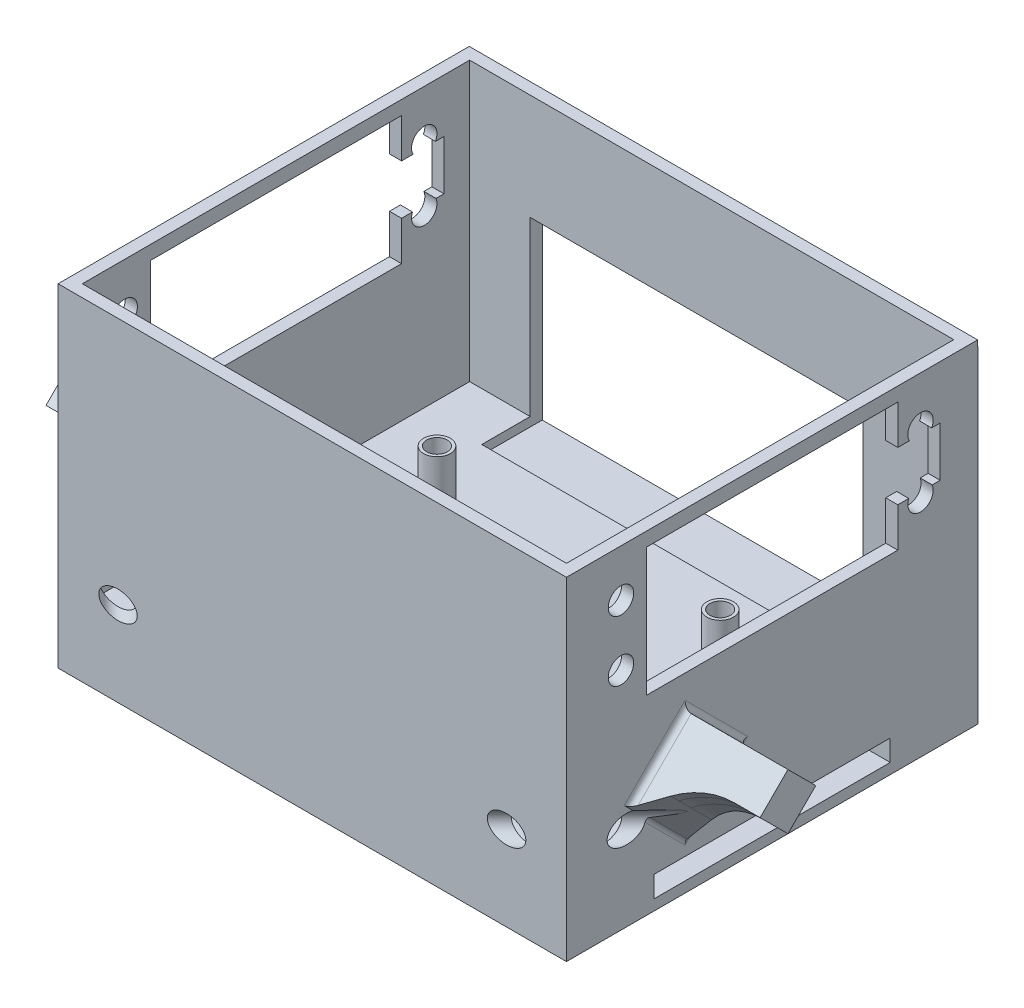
ISO-10303-21;
HEADER;
FILE_DESCRIPTION(('STEP AP214'),'2;1');
FILE_NAME('part.step','',(''),(''),'','','');
FILE_SCHEMA(('AUTOMOTIVE_DESIGN { 1 0 10303 214 1 1 1 1 }'));
ENDSEC;
DATA;
#1=APPLICATION_CONTEXT('core data for automotive mechanical design processes');
#2=APPLICATION_PROTOCOL_DEFINITION('international standard','automotive_design',2000,#1);
#3=PRODUCT_CONTEXT('',#1,'mechanical');
#4=PRODUCT('Part','Part','',(#3));
#5=PRODUCT_RELATED_PRODUCT_CATEGORY('part','',(#4));
#6=PRODUCT_DEFINITION_FORMATION('','',#4);
#7=PRODUCT_DEFINITION_CONTEXT('part definition',#1,'design');
#8=PRODUCT_DEFINITION('design','',#6,#7);
#9=PRODUCT_DEFINITION_SHAPE('','',#8);
#10=(LENGTH_UNIT() NAMED_UNIT(*) SI_UNIT(.MILLI.,.METRE.));
#11=(NAMED_UNIT(*) PLANE_ANGLE_UNIT() SI_UNIT($,.RADIAN.));
#12=(NAMED_UNIT(*) SI_UNIT($,.STERADIAN.) SOLID_ANGLE_UNIT());
#13=UNCERTAINTY_MEASURE_WITH_UNIT(LENGTH_MEASURE(1.E-05),#10,'distance_accuracy_value','');
#14=(GEOMETRIC_REPRESENTATION_CONTEXT(3) GLOBAL_UNCERTAINTY_ASSIGNED_CONTEXT((#13)) GLOBAL_UNIT_ASSIGNED_CONTEXT((#10,
#11,#12)) REPRESENTATION_CONTEXT('',''));
#15=CARTESIAN_POINT('',(0.,0.,0.));
#16=DIRECTION('',(0.,0.,1.));
#17=DIRECTION('',(1.,0.,0.));
#18=AXIS2_PLACEMENT_3D('',#15,#16,#17);
#19=CARTESIAN_POINT('',(0.,45.,-2.));
#20=DIRECTION('',(0.,0.,1.));
#21=DIRECTION('',(1.,0.,0.));
#22=AXIS2_PLACEMENT_3D('',#19,#20,#21);
#23=PLANE('',#22);
#24=DIRECTION('',(0.,-1.,0.));
#25=VECTOR('',#24,1.);
#26=CARTESIAN_POINT('',(82.,45.,-2.));
#27=LINE('',#26,#25);
#28=CARTESIAN_POINT('',(82.,45.,-2.));
#29=VERTEX_POINT('',#28);
#30=CARTESIAN_POINT('',(82.,-9.,-2.));
#31=VERTEX_POINT('',#30);
#32=EDGE_CURVE('E872',#29,#31,#27,.T.);
#33=ORIENTED_EDGE('',*,*,#32,.T.);
#34=DIRECTION('',(1.,0.,0.));
#35=VECTOR('',#34,1.);
#36=CARTESIAN_POINT('',(82.,-9.,-2.));
#37=LINE('',#36,#35);
#38=CARTESIAN_POINT('',(-2.,-9.,-2.));
#39=VERTEX_POINT('',#38);
#40=EDGE_CURVE('E629',#39,#31,#37,.T.);
#41=ORIENTED_EDGE('',*,*,#40,.F.);
#42=DIRECTION('',(0.,-1.,0.));
#43=VECTOR('',#42,1.);
#44=CARTESIAN_POINT('',(-2.,45.,-1.99999999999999));
#45=LINE('',#44,#43);
#46=CARTESIAN_POINT('',(-2.,45.,-2.));
#47=VERTEX_POINT('',#46);
#48=EDGE_CURVE('E875',#47,#39,#45,.T.);
#49=ORIENTED_EDGE('',*,*,#48,.F.);
#50=DIRECTION('',(-1.,0.,0.));
#51=VECTOR('',#50,1.);
#52=CARTESIAN_POINT('',(0.,45.,-2.));
#53=LINE('',#52,#51);
#54=EDGE_CURVE('E874',#29,#47,#53,.T.);
#55=ORIENTED_EDGE('',*,*,#54,.F.);
#56=EDGE_LOOP('',(#33,#41,#49,#55));
#57=FACE_BOUND('',#56,.T.);
#58=DIRECTION('',(0.,1.,0.));
#59=VECTOR('',#58,1.);
#60=CARTESIAN_POINT('',(10.,28.5,-2.));
#61=LINE('',#60,#59);
#62=CARTESIAN_POINT('',(10.,-1.5,-2.));
#63=VERTEX_POINT('',#62);
#64=CARTESIAN_POINT('',(10.,28.5,-2.));
#65=VERTEX_POINT('',#64);
#66=EDGE_CURVE('E503',#63,#65,#61,.T.);
#67=ORIENTED_EDGE('',*,*,#66,.F.);
#68=DIRECTION('',(-1.,0.,0.));
#69=VECTOR('',#68,1.);
#70=CARTESIAN_POINT('',(0.,-1.5,-2.));
#71=LINE('',#70,#69);
#72=CARTESIAN_POINT('',(65.,-1.5,-2.));
#73=VERTEX_POINT('',#72);
#74=EDGE_CURVE('E62',#63,#73,#71,.F.);
#75=ORIENTED_EDGE('',*,*,#74,.T.);
#76=DIRECTION('',(0.,-1.,0.));
#77=VECTOR('',#76,1.);
#78=CARTESIAN_POINT('',(65.,28.5,-2.));
#79=LINE('',#78,#77);
#80=CARTESIAN_POINT('',(65.,28.5,-2.));
#81=VERTEX_POINT('',#80);
#82=EDGE_CURVE('E496',#81,#73,#79,.T.);
#83=ORIENTED_EDGE('',*,*,#82,.F.);
#84=DIRECTION('',(1.,0.,0.));
#85=VECTOR('',#84,1.);
#86=CARTESIAN_POINT('',(65.,28.5,-2.));
#87=LINE('',#86,#85);
#88=EDGE_CURVE('E487',#65,#81,#87,.T.);
#89=ORIENTED_EDGE('',*,*,#88,.F.);
#90=EDGE_LOOP('',(#67,#75,#83,#89));
#91=FACE_BOUND('',#90,.T.);
#92=ADVANCED_FACE('F44',(#57,#91),#23,.F.);
#93=CARTESIAN_POINT('',(82.,45.,0.));
#94=DIRECTION('',(-1.,0.,0.));
#95=DIRECTION('',(0.,0.,1.));
#96=AXIS2_PLACEMENT_3D('',#93,#94,#95);
#97=PLANE('',#96);
#98=CARTESIAN_POINT('',(82.,28.2,57.));
#99=DIRECTION('',(1.,0.,0.));
#100=DIRECTION('',(0.,0.,-1.));
#101=AXIS2_PLACEMENT_3D('',#98,#99,#100);
#102=CIRCLE('',#101,2.1);
#103=CARTESIAN_POINT('',(82.,28.2,54.9));
#104=VERTEX_POINT('',#103);
#105=EDGE_CURVE('E518',#104,#104,#102,.T.);
#106=ORIENTED_EDGE('',*,*,#105,.F.);
#107=EDGE_LOOP('',(#106));
#108=FACE_BOUND('',#107,.T.);
#109=CARTESIAN_POINT('',(82.,38.2,57.));
#110=DIRECTION('',(1.,0.,0.));
#111=DIRECTION('',(0.,0.,-1.));
#112=AXIS2_PLACEMENT_3D('',#109,#110,#111);
#113=CIRCLE('',#112,2.1);
#114=CARTESIAN_POINT('',(82.,38.2,54.9));
#115=VERTEX_POINT('',#114);
#116=EDGE_CURVE('E525',#115,#115,#113,.T.);
#117=ORIENTED_EDGE('',*,*,#116,.F.);
#118=EDGE_LOOP('',(#117));
#119=FACE_BOUND('',#118,.T.);
#120=DIRECTION('',(0.,0.,-1.));
#121=VECTOR('',#120,1.);
#122=CARTESIAN_POINT('',(82.,-7.25,51.5));
#123=LINE('',#122,#121);
#124=CARTESIAN_POINT('',(82.,-7.25,51.5));
#125=VERTEX_POINT('',#124);
#126=CARTESIAN_POINT('',(82.,-7.25,12.5));
#127=VERTEX_POINT('',#126);
#128=EDGE_CURVE('E605',#125,#127,#123,.T.);
#129=ORIENTED_EDGE('',*,*,#128,.F.);
#130=DIRECTION('',(0.,-1.,0.));
#131=VECTOR('',#130,1.);
#132=CARTESIAN_POINT('',(82.,-7.25,51.5));
#133=LINE('',#132,#131);
#134=CARTESIAN_POINT('',(82.,-3.74999999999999,51.5));
#135=VERTEX_POINT('',#134);
#136=EDGE_CURVE('E604',#135,#125,#133,.T.);
#137=ORIENTED_EDGE('',*,*,#136,.F.);
#138=DIRECTION('',(0.,0.,1.));
#139=VECTOR('',#138,1.);
#140=CARTESIAN_POINT('',(82.,-3.74999999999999,51.5));
#141=LINE('',#140,#139);
#142=CARTESIAN_POINT('',(82.,-3.75,12.5));
#143=VERTEX_POINT('',#142);
#144=EDGE_CURVE('E609',#143,#135,#141,.T.);
#145=ORIENTED_EDGE('',*,*,#144,.F.);
#146=DIRECTION('',(0.,1.,0.));
#147=VECTOR('',#146,1.);
#148=CARTESIAN_POINT('',(82.,-7.25,12.5));
#149=LINE('',#148,#147);
#150=EDGE_CURVE('E607',#127,#143,#149,.T.);
#151=ORIENTED_EDGE('',*,*,#150,.F.);
#152=EDGE_LOOP('',(#129,#137,#145,#151));
#153=FACE_BOUND('',#152,.T.);
#154=DIRECTION('',(0.,-1.,0.));
#155=VECTOR('',#154,1.);
#156=CARTESIAN_POINT('',(82.,45.,66.));
#157=LINE('',#156,#155);
#158=CARTESIAN_POINT('',(82.,46.,66.));
#159=VERTEX_POINT('',#158);
#160=CARTESIAN_POINT('',(82.,-9.,66.));
#161=VERTEX_POINT('',#160);
#162=EDGE_CURVE('E871',#159,#161,#157,.T.);
#163=ORIENTED_EDGE('',*,*,#162,.T.);
#164=DIRECTION('',(0.,0.,1.));
#165=VECTOR('',#164,1.);
#166=CARTESIAN_POINT('',(82.,-9.,66.));
#167=LINE('',#166,#165);
#168=EDGE_CURVE('E613',#31,#161,#167,.T.);
#169=ORIENTED_EDGE('',*,*,#168,.F.);
#170=ORIENTED_EDGE('',*,*,#32,.F.);
#171=DIRECTION('',(0.,0.,-1.));
#172=VECTOR('',#171,1.);
#173=CARTESIAN_POINT('',(82.,45.,0.));
#174=LINE('',#173,#172);
#175=CARTESIAN_POINT('',(82.,45.,-1.93662119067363));
#176=VERTEX_POINT('',#175);
#177=EDGE_CURVE('E878',#176,#29,#174,.T.);
#178=ORIENTED_EDGE('',*,*,#177,.F.);
#179=DIRECTION('',(0.,-1.,0.));
#180=VECTOR('',#179,1.);
#181=CARTESIAN_POINT('',(82.,46.,-1.93662119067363));
#182=LINE('',#181,#180);
#183=CARTESIAN_POINT('',(82.,46.,-1.93662119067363));
#184=VERTEX_POINT('',#183);
#185=EDGE_CURVE('E598',#184,#176,#182,.T.);
#186=ORIENTED_EDGE('',*,*,#185,.F.);
#187=DIRECTION('',(0.,0.,-1.));
#188=VECTOR('',#187,1.);
#189=CARTESIAN_POINT('',(82.,46.,66.));
#190=LINE('',#189,#188);
#191=EDGE_CURVE('E586',#159,#184,#190,.T.);
#192=ORIENTED_EDGE('',*,*,#191,.F.);
#193=EDGE_LOOP('',(#163,#169,#170,#178,#186,#192));
#194=FACE_BOUND('',#193,.T.);
#195=DIRECTION('',(0.,0.707106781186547,0.707106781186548));
#196=VECTOR('',#195,1.);
#197=CARTESIAN_POINT('',(82.,7.84952976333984,55.7466643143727));
#198=LINE('',#197,#196);
#199=CARTESIAN_POINT('',(82.,7.11404458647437,55.0111791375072));
#200=VERTEX_POINT('',#199);
#201=CARTESIAN_POINT('',(82.,8.55663654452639,56.4537710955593));
#202=VERTEX_POINT('',#201);
#203=EDGE_CURVE('E914',#200,#202,#198,.T.);
#204=ORIENTED_EDGE('',*,*,#203,.T.);
#205=DIRECTION('',(0.,-0.707106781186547,0.707106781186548));
#206=VECTOR('',#205,1.);
#207=CARTESIAN_POINT('',(82.,17.8994949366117,47.110912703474));
#208=LINE('',#207,#206);
#209=CARTESIAN_POINT('',(82.,18.6066017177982,46.4038059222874));
#210=VERTEX_POINT('',#209);
#211=EDGE_CURVE('E1552',#202,#210,#208,.F.);
#212=ORIENTED_EDGE('',*,*,#211,.T.);
#213=DIRECTION('',(0.,0.707106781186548,0.707106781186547));
#214=VECTOR('',#213,1.);
#215=CARTESIAN_POINT('',(82.,8.55663654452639,36.3538407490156));
#216=LINE('',#215,#214);
#217=CARTESIAN_POINT('',(82.,8.22690723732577,36.024111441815));
#218=VERTEX_POINT('',#217);
#219=EDGE_CURVE('E1551',#210,#218,#216,.F.);
#220=ORIENTED_EDGE('',*,*,#219,.T.);
#221=DIRECTION('',(0.,0.707106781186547,-0.707106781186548));
#222=VECTOR('',#221,1.);
#223=CARTESIAN_POINT('',(82.,-1.82305793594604,46.0740766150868));
#224=LINE('',#223,#222);
#225=CARTESIAN_POINT('',(82.,-2.15278724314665,46.4038059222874));
#226=VERTEX_POINT('',#225);
#227=EDGE_CURVE('E1547',#218,#226,#224,.F.);
#228=ORIENTED_EDGE('',*,*,#227,.T.);
#229=DIRECTION('',(0.,-0.707106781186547,-0.707106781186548));
#230=VECTOR('',#229,1.);
#231=CARTESIAN_POINT('',(82.,4.69180644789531,53.2483996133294));
#232=LINE('',#231,#230);
#233=CARTESIAN_POINT('',(82.,4.45624809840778,53.0128412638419));
#234=VERTEX_POINT('',#233);
#235=EDGE_CURVE('E1550',#226,#234,#232,.F.);
#236=ORIENTED_EDGE('',*,*,#235,.T.);
#237=CARTESIAN_POINT('',(82.,5.,56.1005050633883));
#238=DIRECTION('',(-1.,0.,0.));
#239=DIRECTION('',(0.,0.,-1.));
#240=AXIS2_PLACEMENT_3D('',#237,#238,#239);
#241=ELLIPSE('',#240,3.18198051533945,2.24999999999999);
#242=EDGE_CURVE('E699',#234,#200,#241,.T.);
#243=ORIENTED_EDGE('',*,*,#242,.T.);
#244=EDGE_LOOP('',(#204,#212,#220,#228,#236,#243));
#245=FACE_BOUND('',#244,.T.);
#246=CARTESIAN_POINT('',(82.,38.2,7.49999999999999));
#247=DIRECTION('',(1.,0.,0.));
#248=DIRECTION('',(0.,0.,-1.));
#249=AXIS2_PLACEMENT_3D('',#246,#247,#248);
#250=CIRCLE('',#249,2.1);
#251=CARTESIAN_POINT('',(82.,37.2,5.65338146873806));
#252=VERTEX_POINT('',#251);
#253=CARTESIAN_POINT('',(82.,37.2,9.34661853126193));
#254=VERTEX_POINT('',#253);
#255=EDGE_CURVE('E517',#252,#254,#250,.T.);
#256=ORIENTED_EDGE('',*,*,#255,.F.);
#257=DIRECTION('',(0.,0.,1.));
#258=VECTOR('',#257,1.);
#259=CARTESIAN_POINT('',(82.,37.2,11.25));
#260=LINE('',#259,#258);
#261=CARTESIAN_POINT('',(82.,37.2,4.25));
#262=VERTEX_POINT('',#261);
#263=EDGE_CURVE('E747',#262,#252,#260,.T.);
#264=ORIENTED_EDGE('',*,*,#263,.F.);
#265=DIRECTION('',(0.,1.,0.));
#266=VECTOR('',#265,1.);
#267=CARTESIAN_POINT('',(82.,37.2,4.25));
#268=LINE('',#267,#266);
#269=CARTESIAN_POINT('',(82.,29.,4.25));
#270=VERTEX_POINT('',#269);
#271=EDGE_CURVE('E745',#270,#262,#268,.T.);
#272=ORIENTED_EDGE('',*,*,#271,.F.);
#273=DIRECTION('',(0.,0.,-1.));
#274=VECTOR('',#273,1.);
#275=CARTESIAN_POINT('',(82.,29.,4.25));
#276=LINE('',#275,#274);
#277=CARTESIAN_POINT('',(82.,29.,5.55835121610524));
#278=VERTEX_POINT('',#277);
#279=EDGE_CURVE('E739',#278,#270,#276,.T.);
#280=ORIENTED_EDGE('',*,*,#279,.F.);
#281=CARTESIAN_POINT('',(82.,28.2,7.50000000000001));
#282=DIRECTION('',(1.,0.,0.));
#283=DIRECTION('',(0.,0.,-1.));
#284=AXIS2_PLACEMENT_3D('',#281,#282,#283);
#285=CIRCLE('',#284,2.1);
#286=CARTESIAN_POINT('',(82.,29.,9.44164878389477));
#287=VERTEX_POINT('',#286);
#288=EDGE_CURVE('E523',#287,#278,#285,.T.);
#289=ORIENTED_EDGE('',*,*,#288,.F.);
#290=CARTESIAN_POINT('',(82.,29.,11.25));
#291=VERTEX_POINT('',#290);
#292=EDGE_CURVE('E736',#291,#287,#276,.T.);
#293=ORIENTED_EDGE('',*,*,#292,.F.);
#294=DIRECTION('',(0.,1.,0.));
#295=VECTOR('',#294,1.);
#296=CARTESIAN_POINT('',(82.,29.,11.25));
#297=LINE('',#296,#295);
#298=CARTESIAN_POINT('',(82.,22.5,11.25));
#299=VERTEX_POINT('',#298);
#300=EDGE_CURVE('E733',#299,#291,#297,.T.);
#301=ORIENTED_EDGE('',*,*,#300,.F.);
#302=DIRECTION('',(0.,0.,-1.));
#303=VECTOR('',#302,1.);
#304=CARTESIAN_POINT('',(82.,22.5,11.25));
#305=LINE('',#304,#303);
#306=CARTESIAN_POINT('',(82.,22.5,52.75));
#307=VERTEX_POINT('',#306);
#308=EDGE_CURVE('E704',#307,#299,#305,.T.);
#309=ORIENTED_EDGE('',*,*,#308,.F.);
#310=DIRECTION('',(0.,-1.,0.));
#311=VECTOR('',#310,1.);
#312=CARTESIAN_POINT('',(82.,22.5,52.75));
#313=LINE('',#312,#311);
#314=CARTESIAN_POINT('',(82.,43.7,52.75));
#315=VERTEX_POINT('',#314);
#316=EDGE_CURVE('E709',#315,#307,#313,.T.);
#317=ORIENTED_EDGE('',*,*,#316,.F.);
#318=DIRECTION('',(0.,0.,1.));
#319=VECTOR('',#318,1.);
#320=CARTESIAN_POINT('',(82.,43.7,52.75));
#321=LINE('',#320,#319);
#322=CARTESIAN_POINT('',(82.,43.7,11.25));
#323=VERTEX_POINT('',#322);
#324=EDGE_CURVE('E751',#323,#315,#321,.T.);
#325=ORIENTED_EDGE('',*,*,#324,.F.);
#326=DIRECTION('',(0.,1.,0.));
#327=VECTOR('',#326,1.);
#328=CARTESIAN_POINT('',(82.,43.7,11.25));
#329=LINE('',#328,#327);
#330=CARTESIAN_POINT('',(82.,37.2,11.25));
#331=VERTEX_POINT('',#330);
#332=EDGE_CURVE('E749',#331,#323,#329,.T.);
#333=ORIENTED_EDGE('',*,*,#332,.F.);
#334=EDGE_CURVE('E744',#254,#331,#260,.T.);
#335=ORIENTED_EDGE('',*,*,#334,.F.);
#336=EDGE_LOOP('',(#256,#264,#272,#280,#289,#293,#301,#309,#317,#325,#333,#335));
#337=FACE_BOUND('',#336,.T.);
#338=ADVANCED_FACE('F1167',(#108,#119,#153,#194,#245,#337),#97,.F.);
#339=CARTESIAN_POINT('',(-2.,29.,4.25));
#340=DIRECTION('',(0.,-1.,0.));
#341=DIRECTION('',(0.,0.,-1.));
#342=AXIS2_PLACEMENT_3D('',#339,#340,#341);
#343=PLANE('',#342);
#344=DIRECTION('',(0.,0.,1.));
#345=VECTOR('',#344,1.);
#346=CARTESIAN_POINT('',(80.,29.,0.));
#347=LINE('',#346,#345);
#348=CARTESIAN_POINT('',(80.,29.,4.25));
#349=VERTEX_POINT('',#348);
#350=CARTESIAN_POINT('',(80.,29.,5.55835121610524));
#351=VERTEX_POINT('',#350);
#352=EDGE_CURVE('E897',#349,#351,#347,.T.);
#353=ORIENTED_EDGE('',*,*,#352,.T.);
#354=DIRECTION('',(1.,0.,0.));
#355=VECTOR('',#354,1.);
#356=CARTESIAN_POINT('',(-19.,29.,5.55835121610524));
#357=LINE('',#356,#355);
#358=EDGE_CURVE('E539',#351,#278,#357,.T.);
#359=ORIENTED_EDGE('',*,*,#358,.T.);
#360=ORIENTED_EDGE('',*,*,#279,.T.);
#361=DIRECTION('',(1.,0.,0.));
#362=VECTOR('',#361,1.);
#363=CARTESIAN_POINT('',(-2.,29.,4.25));
#364=LINE('',#363,#362);
#365=EDGE_CURVE('E783',#349,#270,#364,.T.);
#366=ORIENTED_EDGE('',*,*,#365,.F.);
#367=EDGE_LOOP('',(#353,#359,#360,#366));
#368=FACE_BOUND('',#367,.T.);
#369=ADVANCED_FACE('F1176',(#368),#343,.F.);
#370=CARTESIAN_POINT('',(-2.,37.2,11.25));
#371=DIRECTION('',(0.,1.,0.));
#372=DIRECTION('',(0.,0.,1.));
#373=AXIS2_PLACEMENT_3D('',#370,#371,#372);
#374=PLANE('',#373);
#375=DIRECTION('',(0.,0.,-1.));
#376=VECTOR('',#375,1.);
#377=CARTESIAN_POINT('',(80.,37.2,0.));
#378=LINE('',#377,#376);
#379=CARTESIAN_POINT('',(80.,37.2,11.25));
#380=VERTEX_POINT('',#379);
#381=CARTESIAN_POINT('',(80.,37.2,9.34661853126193));
#382=VERTEX_POINT('',#381);
#383=EDGE_CURVE('E901',#380,#382,#378,.T.);
#384=ORIENTED_EDGE('',*,*,#383,.T.);
#385=DIRECTION('',(1.,0.,0.));
#386=VECTOR('',#385,1.);
#387=CARTESIAN_POINT('',(-19.,37.2,9.34661853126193));
#388=LINE('',#387,#386);
#389=EDGE_CURVE('E551',#382,#254,#388,.T.);
#390=ORIENTED_EDGE('',*,*,#389,.T.);
#391=ORIENTED_EDGE('',*,*,#334,.T.);
#392=DIRECTION('',(1.,0.,0.));
#393=VECTOR('',#392,1.);
#394=CARTESIAN_POINT('',(-2.,37.2,11.25));
#395=LINE('',#394,#393);
#396=EDGE_CURVE('E773',#380,#331,#395,.T.);
#397=ORIENTED_EDGE('',*,*,#396,.F.);
#398=EDGE_LOOP('',(#384,#390,#391,#397));
#399=FACE_BOUND('',#398,.T.);
#400=ADVANCED_FACE('F1283',(#399),#374,.F.);
#401=DIRECTION('',(0.,0.,1.));
#402=VECTOR('',#401,1.);
#403=CARTESIAN_POINT('',(-2.,37.2,11.25));
#404=LINE('',#403,#402);
#405=CARTESIAN_POINT('',(-2.,37.2,9.34661853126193));
#406=VERTEX_POINT('',#405);
#407=CARTESIAN_POINT('',(-2.,37.2,11.25));
#408=VERTEX_POINT('',#407);
#409=EDGE_CURVE('E719',#406,#408,#404,.T.);
#410=ORIENTED_EDGE('',*,*,#409,.F.);
#411=DIRECTION('',(1.,0.,0.));
#412=VECTOR('',#411,1.);
#413=CARTESIAN_POINT('',(-19.,37.2,9.34661853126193));
#414=LINE('',#413,#412);
#415=CARTESIAN_POINT('',(0.,37.2,9.34661853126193));
#416=VERTEX_POINT('',#415);
#417=EDGE_CURVE('E1136',#406,#416,#414,.T.);
#418=ORIENTED_EDGE('',*,*,#417,.T.);
#419=DIRECTION('',(0.,0.,1.));
#420=VECTOR('',#419,1.);
#421=CARTESIAN_POINT('',(0.,37.2,64.));
#422=LINE('',#421,#420);
#423=CARTESIAN_POINT('',(0.,37.2,11.25));
#424=VERTEX_POINT('',#423);
#425=EDGE_CURVE('E794',#416,#424,#422,.T.);
#426=ORIENTED_EDGE('',*,*,#425,.T.);
#427=EDGE_CURVE('E769',#408,#424,#395,.T.);
#428=ORIENTED_EDGE('',*,*,#427,.F.);
#429=EDGE_LOOP('',(#410,#418,#426,#428));
#430=FACE_BOUND('',#429,.T.);
#431=ADVANCED_FACE('F1327',(#430),#374,.F.);
#432=DIRECTION('',(0.,0.,-1.));
#433=VECTOR('',#432,1.);
#434=CARTESIAN_POINT('',(-2.,29.,4.25));
#435=LINE('',#434,#433);
#436=CARTESIAN_POINT('',(-2.,29.,5.55835121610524));
#437=VERTEX_POINT('',#436);
#438=CARTESIAN_POINT('',(-2.,29.,4.25));
#439=VERTEX_POINT('',#438);
#440=EDGE_CURVE('E711',#437,#439,#435,.T.);
#441=ORIENTED_EDGE('',*,*,#440,.F.);
#442=DIRECTION('',(1.,0.,0.));
#443=VECTOR('',#442,1.);
#444=CARTESIAN_POINT('',(-19.,29.,5.55835121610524));
#445=LINE('',#444,#443);
#446=CARTESIAN_POINT('',(0.,29.,5.55835121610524));
#447=VERTEX_POINT('',#446);
#448=EDGE_CURVE('E1131',#437,#447,#445,.T.);
#449=ORIENTED_EDGE('',*,*,#448,.T.);
#450=DIRECTION('',(0.,0.,-1.));
#451=VECTOR('',#450,1.);
#452=CARTESIAN_POINT('',(0.,29.,64.));
#453=LINE('',#452,#451);
#454=CARTESIAN_POINT('',(0.,29.,4.25));
#455=VERTEX_POINT('',#454);
#456=EDGE_CURVE('E789',#447,#455,#453,.T.);
#457=ORIENTED_EDGE('',*,*,#456,.T.);
#458=EDGE_CURVE('E778',#439,#455,#364,.T.);
#459=ORIENTED_EDGE('',*,*,#458,.F.);
#460=EDGE_LOOP('',(#441,#449,#457,#459));
#461=FACE_BOUND('',#460,.T.);
#462=ADVANCED_FACE('F1195',(#461),#343,.F.);
#463=CARTESIAN_POINT('',(0.,45.,0.));
#464=DIRECTION('',(0.,-1.,0.));
#465=DIRECTION('',(0.,0.,-1.));
#466=AXIS2_PLACEMENT_3D('',#463,#464,#465);
#467=PLANE('',#466);
#468=DIRECTION('',(-1.,0.,0.));
#469=VECTOR('',#468,1.);
#470=CARTESIAN_POINT('',(-2.,45.,-1.93662119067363));
#471=LINE('',#470,#469);
#472=CARTESIAN_POINT('',(-2.,45.,-1.93662119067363));
#473=VERTEX_POINT('',#472);
#474=EDGE_CURVE('E585',#176,#473,#471,.T.);
#475=ORIENTED_EDGE('',*,*,#474,.F.);
#476=ORIENTED_EDGE('',*,*,#177,.T.);
#477=ORIENTED_EDGE('',*,*,#54,.T.);
#478=DIRECTION('',(0.,0.,1.));
#479=VECTOR('',#478,1.);
#480=CARTESIAN_POINT('',(-2.,45.,0.));
#481=LINE('',#480,#479);
#482=EDGE_CURVE('E870',#47,#473,#481,.T.);
#483=ORIENTED_EDGE('',*,*,#482,.T.);
#484=EDGE_LOOP('',(#475,#476,#477,#483));
#485=FACE_BOUND('',#484,.T.);
#486=ADVANCED_FACE('F1189',(#485),#467,.F.);
#487=CARTESIAN_POINT('',(-2.,45.,64.));
#488=DIRECTION('',(1.,0.,0.));
#489=DIRECTION('',(0.,0.,-1.));
#490=AXIS2_PLACEMENT_3D('',#487,#488,#489);
#491=PLANE('',#490);
#492=CARTESIAN_POINT('',(-2.,28.2,57.));
#493=DIRECTION('',(1.,0.,0.));
#494=DIRECTION('',(0.,0.,-1.));
#495=AXIS2_PLACEMENT_3D('',#492,#493,#494);
#496=CIRCLE('',#495,2.1);
#497=CARTESIAN_POINT('',(-2.,28.2,54.9));
#498=VERTEX_POINT('',#497);
#499=EDGE_CURVE('E562',#498,#498,#496,.T.);
#500=ORIENTED_EDGE('',*,*,#499,.T.);
#501=EDGE_LOOP('',(#500));
#502=FACE_BOUND('',#501,.T.);
#503=CARTESIAN_POINT('',(-2.,38.2,57.));
#504=DIRECTION('',(1.,0.,0.));
#505=DIRECTION('',(0.,0.,-1.));
#506=AXIS2_PLACEMENT_3D('',#503,#504,#505);
#507=CIRCLE('',#506,2.1);
#508=CARTESIAN_POINT('',(-2.,38.2,54.9));
#509=VERTEX_POINT('',#508);
#510=EDGE_CURVE('E556',#509,#509,#507,.T.);
#511=ORIENTED_EDGE('',*,*,#510,.T.);
#512=EDGE_LOOP('',(#511));
#513=FACE_BOUND('',#512,.T.);
#514=DIRECTION('',(0.,0.,1.));
#515=VECTOR('',#514,1.);
#516=CARTESIAN_POINT('',(-2.,-3.74999999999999,64.));
#517=LINE('',#516,#515);
#518=CARTESIAN_POINT('',(-2.,-3.75,12.5));
#519=VERTEX_POINT('',#518);
#520=CARTESIAN_POINT('',(-2.,-3.74999999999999,51.5));
#521=VERTEX_POINT('',#520);
#522=EDGE_CURVE('E1606',#519,#521,#517,.T.);
#523=ORIENTED_EDGE('',*,*,#522,.T.);
#524=DIRECTION('',(0.,-1.,0.));
#525=VECTOR('',#524,1.);
#526=CARTESIAN_POINT('',(-2.,45.,51.5));
#527=LINE('',#526,#525);
#528=CARTESIAN_POINT('',(-2.,-7.25,51.5));
#529=VERTEX_POINT('',#528);
#530=EDGE_CURVE('E1604',#521,#529,#527,.T.);
#531=ORIENTED_EDGE('',*,*,#530,.T.);
#532=DIRECTION('',(0.,0.,-1.));
#533=VECTOR('',#532,1.);
#534=CARTESIAN_POINT('',(-2.,-7.25,64.));
#535=LINE('',#534,#533);
#536=CARTESIAN_POINT('',(-2.,-7.25,12.5));
#537=VERTEX_POINT('',#536);
#538=EDGE_CURVE('E1614',#529,#537,#535,.T.);
#539=ORIENTED_EDGE('',*,*,#538,.T.);
#540=DIRECTION('',(0.,1.,0.));
#541=VECTOR('',#540,1.);
#542=CARTESIAN_POINT('',(-2.,45.,12.5));
#543=LINE('',#542,#541);
#544=EDGE_CURVE('E1613',#537,#519,#543,.T.);
#545=ORIENTED_EDGE('',*,*,#544,.T.);
#546=EDGE_LOOP('',(#523,#531,#539,#545));
#547=FACE_BOUND('',#546,.T.);
#548=ORIENTED_EDGE('',*,*,#48,.T.);
#549=DIRECTION('',(0.,0.,-1.));
#550=VECTOR('',#549,1.);
#551=CARTESIAN_POINT('',(-2.,-9.,66.));
#552=LINE('',#551,#550);
#553=CARTESIAN_POINT('',(-2.,-9.,66.));
#554=VERTEX_POINT('',#553);
#555=EDGE_CURVE('E630',#554,#39,#552,.T.);
#556=ORIENTED_EDGE('',*,*,#555,.F.);
#557=DIRECTION('',(0.,-1.,0.));
#558=VECTOR('',#557,1.);
#559=CARTESIAN_POINT('',(-1.99999999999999,45.,66.));
#560=LINE('',#559,#558);
#561=CARTESIAN_POINT('',(-2.,46.,66.));
#562=VERTEX_POINT('',#561);
#563=EDGE_CURVE('E868',#562,#554,#560,.T.);
#564=ORIENTED_EDGE('',*,*,#563,.F.);
#565=DIRECTION('',(0.,0.,1.));
#566=VECTOR('',#565,1.);
#567=CARTESIAN_POINT('',(-2.,46.,66.));
#568=LINE('',#567,#566);
#569=CARTESIAN_POINT('',(-2.,46.,-1.93662119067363));
#570=VERTEX_POINT('',#569);
#571=EDGE_CURVE('E584',#570,#562,#568,.T.);
#572=ORIENTED_EDGE('',*,*,#571,.F.);
#573=DIRECTION('',(0.,-1.,0.));
#574=VECTOR('',#573,1.);
#575=CARTESIAN_POINT('',(-2.,46.,-1.93662119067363));
#576=LINE('',#575,#574);
#577=EDGE_CURVE('E592',#570,#473,#576,.T.);
#578=ORIENTED_EDGE('',*,*,#577,.T.);
#579=ORIENTED_EDGE('',*,*,#482,.F.);
#580=EDGE_LOOP('',(#548,#556,#564,#572,#578,#579));
#581=FACE_BOUND('',#580,.T.);
#582=CARTESIAN_POINT('',(-2.,37.2,4.25));
#583=VERTEX_POINT('',#582);
#584=CARTESIAN_POINT('',(-2.,37.2,5.65338146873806));
#585=VERTEX_POINT('',#584);
#586=EDGE_CURVE('E721',#583,#585,#404,.T.);
#587=ORIENTED_EDGE('',*,*,#586,.T.);
#588=CARTESIAN_POINT('',(-2.,38.2,7.49999999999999));
#589=DIRECTION('',(1.,0.,0.));
#590=DIRECTION('',(0.,0.,-1.));
#591=AXIS2_PLACEMENT_3D('',#588,#589,#590);
#592=CIRCLE('',#591,2.1);
#593=EDGE_CURVE('E542',#585,#406,#592,.T.);
#594=ORIENTED_EDGE('',*,*,#593,.T.);
#595=ORIENTED_EDGE('',*,*,#409,.T.);
#596=DIRECTION('',(0.,1.,0.));
#597=VECTOR('',#596,1.);
#598=CARTESIAN_POINT('',(-2.,43.7,11.25));
#599=LINE('',#598,#597);
#600=CARTESIAN_POINT('',(-2.,43.7,11.25));
#601=VERTEX_POINT('',#600);
#602=EDGE_CURVE('E722',#408,#601,#599,.T.);
#603=ORIENTED_EDGE('',*,*,#602,.T.);
#604=DIRECTION('',(0.,0.,1.));
#605=VECTOR('',#604,1.);
#606=CARTESIAN_POINT('',(-2.,43.7,52.75));
#607=LINE('',#606,#605);
#608=CARTESIAN_POINT('',(-2.,43.7,52.75));
#609=VERTEX_POINT('',#608);
#610=EDGE_CURVE('E730',#601,#609,#607,.T.);
#611=ORIENTED_EDGE('',*,*,#610,.T.);
#612=DIRECTION('',(0.,-1.,0.));
#613=VECTOR('',#612,1.);
#614=CARTESIAN_POINT('',(-2.,22.5,52.75));
#615=LINE('',#614,#613);
#616=CARTESIAN_POINT('',(-2.,22.5,52.75));
#617=VERTEX_POINT('',#616);
#618=EDGE_CURVE('E729',#609,#617,#615,.T.);
#619=ORIENTED_EDGE('',*,*,#618,.T.);
#620=DIRECTION('',(0.,0.,-1.));
#621=VECTOR('',#620,1.);
#622=CARTESIAN_POINT('',(-2.,22.5,11.25));
#623=LINE('',#622,#621);
#624=CARTESIAN_POINT('',(-2.,22.5,11.25));
#625=VERTEX_POINT('',#624);
#626=EDGE_CURVE('E708',#617,#625,#623,.T.);
#627=ORIENTED_EDGE('',*,*,#626,.T.);
#628=DIRECTION('',(0.,1.,0.));
#629=VECTOR('',#628,1.);
#630=CARTESIAN_POINT('',(-2.,29.,11.25));
#631=LINE('',#630,#629);
#632=CARTESIAN_POINT('',(-2.,29.,11.25));
#633=VERTEX_POINT('',#632);
#634=EDGE_CURVE('E710',#625,#633,#631,.T.);
#635=ORIENTED_EDGE('',*,*,#634,.T.);
#636=CARTESIAN_POINT('',(-2.,29.,9.44164878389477));
#637=VERTEX_POINT('',#636);
#638=EDGE_CURVE('E714',#633,#637,#435,.T.);
#639=ORIENTED_EDGE('',*,*,#638,.T.);
#640=CARTESIAN_POINT('',(-2.,28.2,7.50000000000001));
#641=DIRECTION('',(1.,0.,0.));
#642=DIRECTION('',(0.,0.,-1.));
#643=AXIS2_PLACEMENT_3D('',#640,#641,#642);
#644=CIRCLE('',#643,2.1);
#645=EDGE_CURVE('E527',#637,#437,#644,.T.);
#646=ORIENTED_EDGE('',*,*,#645,.T.);
#647=ORIENTED_EDGE('',*,*,#440,.T.);
#648=DIRECTION('',(0.,1.,0.));
#649=VECTOR('',#648,1.);
#650=CARTESIAN_POINT('',(-2.,37.2,4.25));
#651=LINE('',#650,#649);
#652=EDGE_CURVE('E720',#439,#583,#651,.T.);
#653=ORIENTED_EDGE('',*,*,#652,.T.);
#654=EDGE_LOOP('',(#587,#594,#595,#603,#611,#619,#627,#635,#639,#646,#647,#653));
#655=FACE_BOUND('',#654,.T.);
#656=CARTESIAN_POINT('',(-2.,5.,56.1005050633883));
#657=DIRECTION('',(1.,0.,0.));
#658=DIRECTION('',(0.,0.,-1.));
#659=AXIS2_PLACEMENT_3D('',#656,#657,#658);
#660=ELLIPSE('',#659,3.18198051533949,2.25);
#661=CARTESIAN_POINT('',(-2.,7.11404458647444,55.0111791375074));
#662=VERTEX_POINT('',#661);
#663=CARTESIAN_POINT('',(-2.,4.45624809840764,53.0128412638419));
#664=VERTEX_POINT('',#663);
#665=EDGE_CURVE('E695',#662,#664,#660,.T.);
#666=ORIENTED_EDGE('',*,*,#665,.T.);
#667=DIRECTION('',(0.,0.707106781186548,0.707106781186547));
#668=VECTOR('',#667,1.);
#669=CARTESIAN_POINT('',(-2.,-1.82305793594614,46.7335352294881));
#670=LINE('',#669,#668);
#671=CARTESIAN_POINT('',(-2.,-2.15278724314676,46.4038059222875));
#672=VERTEX_POINT('',#671);
#673=EDGE_CURVE('E1598',#664,#672,#670,.F.);
#674=ORIENTED_EDGE('',*,*,#673,.T.);
#675=DIRECTION('',(0.,-0.707106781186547,0.707106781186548));
#676=VECTOR('',#675,1.);
#677=CARTESIAN_POINT('',(-2.,7.51980045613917,36.7312182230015));
#678=LINE('',#677,#676);
#679=CARTESIAN_POINT('',(-2.,8.22690723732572,36.024111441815));
#680=VERTEX_POINT('',#679);
#681=EDGE_CURVE('E1592',#672,#680,#678,.F.);
#682=ORIENTED_EDGE('',*,*,#681,.T.);
#683=DIRECTION('',(0.,-0.707106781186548,-0.707106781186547));
#684=VECTOR('',#683,1.);
#685=CARTESIAN_POINT('',(-2.,17.8994949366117,45.6966991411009));
#686=LINE('',#685,#684);
#687=CARTESIAN_POINT('',(-2.,18.6066017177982,46.4038059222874));
#688=VERTEX_POINT('',#687);
#689=EDGE_CURVE('E1586',#680,#688,#686,.F.);
#690=ORIENTED_EDGE('',*,*,#689,.T.);
#691=DIRECTION('',(0.,0.707106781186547,-0.707106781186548));
#692=VECTOR('',#691,1.);
#693=CARTESIAN_POINT('',(-2.,8.55663654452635,56.4537710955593));
#694=LINE('',#693,#692);
#695=CARTESIAN_POINT('',(-2.,8.55663654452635,56.4537710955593));
#696=VERTEX_POINT('',#695);
#697=EDGE_CURVE('E1529',#688,#696,#694,.F.);
#698=ORIENTED_EDGE('',*,*,#697,.T.);
#699=DIRECTION('',(0.,-0.707106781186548,-0.707106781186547));
#700=VECTOR('',#699,1.);
#701=CARTESIAN_POINT('',(-2.,3.25333568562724,51.1504702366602));
#702=LINE('',#701,#700);
#703=EDGE_CURVE('E918',#696,#662,#702,.T.);
#704=ORIENTED_EDGE('',*,*,#703,.T.);
#705=EDGE_LOOP('',(#666,#674,#682,#690,#698,#704));
#706=FACE_BOUND('',#705,.T.);
#707=ADVANCED_FACE('F1181',(#502,#513,#547,#581,#655,#706),#491,.F.);
#708=CARTESIAN_POINT('',(80.,45.,66.));
#709=DIRECTION('',(0.,0.,-1.));
#710=DIRECTION('',(-1.,0.,0.));
#711=AXIS2_PLACEMENT_3D('',#708,#709,#710);
#712=PLANE('',#711);
#713=CARTESIAN_POINT('',(7.89949493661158,5.,66.));
#714=DIRECTION('',(0.,0.,-1.));
#715=DIRECTION('',(-1.,0.,0.));
#716=AXIS2_PLACEMENT_3D('',#713,#714,#715);
#717=ELLIPSE('',#716,3.18198051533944,2.25);
#718=CARTESIAN_POINT('',(4.71751442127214,5.,66.));
#719=VERTEX_POINT('',#718);
#720=EDGE_CURVE('E686',#719,#719,#717,.T.);
#721=ORIENTED_EDGE('',*,*,#720,.T.);
#722=EDGE_LOOP('',(#721));
#723=FACE_BOUND('',#722,.T.);
#724=CARTESIAN_POINT('',(72.1005050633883,5.,66.));
#725=DIRECTION('',(0.,0.,-1.));
#726=DIRECTION('',(1.,0.,0.));
#727=AXIS2_PLACEMENT_3D('',#724,#725,#726);
#728=ELLIPSE('',#727,3.18198051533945,2.24999999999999);
#729=CARTESIAN_POINT('',(75.2824855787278,5.,66.));
#730=VERTEX_POINT('',#729);
#731=EDGE_CURVE('E705',#730,#730,#728,.T.);
#732=ORIENTED_EDGE('',*,*,#731,.T.);
#733=EDGE_LOOP('',(#732));
#734=FACE_BOUND('',#733,.T.);
#735=ORIENTED_EDGE('',*,*,#563,.T.);
#736=DIRECTION('',(-1.,0.,0.));
#737=VECTOR('',#736,1.);
#738=CARTESIAN_POINT('',(82.,-9.,66.));
#739=LINE('',#738,#737);
#740=EDGE_CURVE('E624',#161,#554,#739,.T.);
#741=ORIENTED_EDGE('',*,*,#740,.F.);
#742=ORIENTED_EDGE('',*,*,#162,.F.);
#743=DIRECTION('',(1.,0.,0.));
#744=VECTOR('',#743,1.);
#745=CARTESIAN_POINT('',(-2.,46.,66.));
#746=LINE('',#745,#744);
#747=EDGE_CURVE('E587',#562,#159,#746,.T.);
#748=ORIENTED_EDGE('',*,*,#747,.F.);
#749=EDGE_LOOP('',(#735,#741,#742,#748));
#750=FACE_BOUND('',#749,.T.);
#751=ADVANCED_FACE('F1179',(#723,#734,#750),#712,.F.);
#752=CARTESIAN_POINT('',(0.,45.,64.));
#753=DIRECTION('',(1.,0.,0.));
#754=DIRECTION('',(0.,0.,-1.));
#755=AXIS2_PLACEMENT_3D('',#752,#753,#754);
#756=PLANE('',#755);
#757=CARTESIAN_POINT('',(0.,38.2,7.49999999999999));
#758=DIRECTION('',(1.,0.,0.));
#759=DIRECTION('',(0.,0.,-1.));
#760=AXIS2_PLACEMENT_3D('',#757,#758,#759);
#761=CIRCLE('',#760,2.1);
#762=CARTESIAN_POINT('',(0.,37.2,5.65338146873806));
#763=VERTEX_POINT('',#762);
#764=EDGE_CURVE('E541',#763,#416,#761,.T.);
#765=ORIENTED_EDGE('',*,*,#764,.F.);
#766=CARTESIAN_POINT('',(0.,37.2,4.25));
#767=VERTEX_POINT('',#766);
#768=EDGE_CURVE('E796',#767,#763,#422,.T.);
#769=ORIENTED_EDGE('',*,*,#768,.F.);
#770=DIRECTION('',(0.,1.,0.));
#771=VECTOR('',#770,1.);
#772=CARTESIAN_POINT('',(0.,45.,4.25));
#773=LINE('',#772,#771);
#774=EDGE_CURVE('E793',#455,#767,#773,.T.);
#775=ORIENTED_EDGE('',*,*,#774,.F.);
#776=ORIENTED_EDGE('',*,*,#456,.F.);
#777=CARTESIAN_POINT('',(0.,28.2,7.50000000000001));
#778=DIRECTION('',(1.,0.,0.));
#779=DIRECTION('',(0.,0.,-1.));
#780=AXIS2_PLACEMENT_3D('',#777,#778,#779);
#781=CIRCLE('',#780,2.1);
#782=CARTESIAN_POINT('',(0.,29.,9.44164878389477));
#783=VERTEX_POINT('',#782);
#784=EDGE_CURVE('E530',#783,#447,#781,.T.);
#785=ORIENTED_EDGE('',*,*,#784,.F.);
#786=CARTESIAN_POINT('',(0.,29.,11.25));
#787=VERTEX_POINT('',#786);
#788=EDGE_CURVE('E787',#787,#783,#453,.T.);
#789=ORIENTED_EDGE('',*,*,#788,.F.);
#790=DIRECTION('',(0.,1.,0.));
#791=VECTOR('',#790,1.);
#792=CARTESIAN_POINT('',(0.,45.,11.25));
#793=LINE('',#792,#791);
#794=CARTESIAN_POINT('',(0.,22.5,11.25));
#795=VERTEX_POINT('',#794);
#796=EDGE_CURVE('E758',#795,#787,#793,.T.);
#797=ORIENTED_EDGE('',*,*,#796,.F.);
#798=DIRECTION('',(0.,0.,-1.));
#799=VECTOR('',#798,1.);
#800=CARTESIAN_POINT('',(0.,22.5,64.));
#801=LINE('',#800,#799);
#802=CARTESIAN_POINT('',(0.,22.5,52.75));
#803=VERTEX_POINT('',#802);
#804=EDGE_CURVE('E804',#803,#795,#801,.T.);
#805=ORIENTED_EDGE('',*,*,#804,.F.);
#806=DIRECTION('',(0.,-1.,0.));
#807=VECTOR('',#806,1.);
#808=CARTESIAN_POINT('',(0.,45.,52.75));
#809=LINE('',#808,#807);
#810=CARTESIAN_POINT('',(0.,43.7,52.75));
#811=VERTEX_POINT('',#810);
#812=EDGE_CURVE('E802',#811,#803,#809,.T.);
#813=ORIENTED_EDGE('',*,*,#812,.F.);
#814=DIRECTION('',(0.,0.,1.));
#815=VECTOR('',#814,1.);
#816=CARTESIAN_POINT('',(0.,43.7,64.));
#817=LINE('',#816,#815);
#818=CARTESIAN_POINT('',(0.,43.7,11.25));
#819=VERTEX_POINT('',#818);
#820=EDGE_CURVE('E801',#819,#811,#817,.T.);
#821=ORIENTED_EDGE('',*,*,#820,.F.);
#822=DIRECTION('',(0.,1.,0.));
#823=VECTOR('',#822,1.);
#824=CARTESIAN_POINT('',(0.,45.,11.25));
#825=LINE('',#824,#823);
#826=EDGE_CURVE('E797',#424,#819,#825,.T.);
#827=ORIENTED_EDGE('',*,*,#826,.F.);
#828=ORIENTED_EDGE('',*,*,#425,.F.);
#829=EDGE_LOOP('',(#765,#769,#775,#776,#785,#789,#797,#805,#813,#821,#827,#828));
#830=FACE_BOUND('',#829,.T.);
#831=CARTESIAN_POINT('',(0.,28.2,57.));
#832=DIRECTION('',(1.,0.,0.));
#833=DIRECTION('',(0.,0.,-1.));
#834=AXIS2_PLACEMENT_3D('',#831,#832,#833);
#835=CIRCLE('',#834,2.1);
#836=CARTESIAN_POINT('',(0.,28.2,54.9));
#837=VERTEX_POINT('',#836);
#838=EDGE_CURVE('E565',#837,#837,#835,.T.);
#839=ORIENTED_EDGE('',*,*,#838,.F.);
#840=EDGE_LOOP('',(#839));
#841=FACE_BOUND('',#840,.T.);
#842=CARTESIAN_POINT('',(0.,38.2,57.));
#843=DIRECTION('',(1.,0.,0.));
#844=DIRECTION('',(0.,0.,-1.));
#845=AXIS2_PLACEMENT_3D('',#842,#843,#844);
#846=CIRCLE('',#845,2.1);
#847=CARTESIAN_POINT('',(0.,38.2,54.9));
#848=VERTEX_POINT('',#847);
#849=EDGE_CURVE('E554',#848,#848,#846,.T.);
#850=ORIENTED_EDGE('',*,*,#849,.F.);
#851=EDGE_LOOP('',(#850));
#852=FACE_BOUND('',#851,.T.);
#853=CARTESIAN_POINT('',(0.,5.,58.1005050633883));
#854=DIRECTION('',(1.,0.,0.));
#855=DIRECTION('',(0.,0.,-1.));
#856=AXIS2_PLACEMENT_3D('',#853,#854,#855);
#857=ELLIPSE('',#856,3.18198051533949,2.25);
#858=CARTESIAN_POINT('',(0.,5.,54.9185245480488));
#859=VERTEX_POINT('',#858);
#860=EDGE_CURVE('E687',#859,#859,#857,.T.);
#861=ORIENTED_EDGE('',*,*,#860,.F.);
#862=EDGE_LOOP('',(#861));
#863=FACE_BOUND('',#862,.T.);
#864=DIRECTION('',(0.,0.,1.));
#865=VECTOR('',#864,1.);
#866=CARTESIAN_POINT('',(0.,0.,64.));
#867=LINE('',#866,#865);
#868=CARTESIAN_POINT('',(0.,0.,0.));
#869=VERTEX_POINT('',#868);
#870=CARTESIAN_POINT('',(0.,0.,64.));
#871=VERTEX_POINT('',#870);
#872=EDGE_CURVE('E843',#869,#871,#867,.T.);
#873=ORIENTED_EDGE('',*,*,#872,.F.);
#874=DIRECTION('',(0.,-1.,0.));
#875=VECTOR('',#874,1.);
#876=CARTESIAN_POINT('',(0.,45.,0.));
#877=LINE('',#876,#875);
#878=CARTESIAN_POINT('',(0.,46.,0.));
#879=VERTEX_POINT('',#878);
#880=EDGE_CURVE('E854',#879,#869,#877,.T.);
#881=ORIENTED_EDGE('',*,*,#880,.F.);
#882=DIRECTION('',(0.,0.,1.));
#883=VECTOR('',#882,1.);
#884=CARTESIAN_POINT('',(0.,46.,64.));
#885=LINE('',#884,#883);
#886=CARTESIAN_POINT('',(0.,46.,64.));
#887=VERTEX_POINT('',#886);
#888=EDGE_CURVE('E567',#879,#887,#885,.T.);
#889=ORIENTED_EDGE('',*,*,#888,.T.);
#890=DIRECTION('',(0.,-1.,0.));
#891=VECTOR('',#890,1.);
#892=CARTESIAN_POINT('',(0.,45.,64.));
#893=LINE('',#892,#891);
#894=EDGE_CURVE('E864',#887,#871,#893,.T.);
#895=ORIENTED_EDGE('',*,*,#894,.T.);
#896=EDGE_LOOP('',(#873,#881,#889,#895));
#897=FACE_BOUND('',#896,.T.);
#898=ADVANCED_FACE('F1184',(#830,#841,#852,#863,#897),#756,.T.);
#899=CARTESIAN_POINT('',(80.,45.,64.));
#900=DIRECTION('',(0.,0.,-1.));
#901=DIRECTION('',(-1.,0.,0.));
#902=AXIS2_PLACEMENT_3D('',#899,#900,#901);
#903=PLANE('',#902);
#904=CARTESIAN_POINT('',(5.89949493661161,5.,64.));
#905=DIRECTION('',(0.,0.,-1.));
#906=DIRECTION('',(-1.,0.,0.));
#907=AXIS2_PLACEMENT_3D('',#904,#905,#906);
#908=ELLIPSE('',#907,3.18198051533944,2.25);
#909=CARTESIAN_POINT('',(2.71751442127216,5.,64.));
#910=VERTEX_POINT('',#909);
#911=EDGE_CURVE('E683',#910,#910,#908,.T.);
#912=ORIENTED_EDGE('',*,*,#911,.F.);
#913=EDGE_LOOP('',(#912));
#914=FACE_BOUND('',#913,.T.);
#915=CARTESIAN_POINT('',(74.1005050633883,5.,64.));
#916=DIRECTION('',(0.,0.,-1.));
#917=DIRECTION('',(1.,0.,0.));
#918=AXIS2_PLACEMENT_3D('',#915,#916,#917);
#919=ELLIPSE('',#918,3.18198051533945,2.24999999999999);
#920=CARTESIAN_POINT('',(77.2824855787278,5.,64.));
#921=VERTEX_POINT('',#920);
#922=EDGE_CURVE('E697',#921,#921,#919,.T.);
#923=ORIENTED_EDGE('',*,*,#922,.F.);
#924=EDGE_LOOP('',(#923));
#925=FACE_BOUND('',#924,.T.);
#926=DIRECTION('',(1.,0.,0.));
#927=VECTOR('',#926,1.);
#928=CARTESIAN_POINT('',(80.,0.,64.));
#929=LINE('',#928,#927);
#930=CARTESIAN_POINT('',(80.,0.,64.));
#931=VERTEX_POINT('',#930);
#932=EDGE_CURVE('E850',#871,#931,#929,.T.);
#933=ORIENTED_EDGE('',*,*,#932,.F.);
#934=ORIENTED_EDGE('',*,*,#894,.F.);
#935=DIRECTION('',(1.,0.,0.));
#936=VECTOR('',#935,1.);
#937=CARTESIAN_POINT('',(0.,46.,64.));
#938=LINE('',#937,#936);
#939=CARTESIAN_POINT('',(80.,46.,64.));
#940=VERTEX_POINT('',#939);
#941=EDGE_CURVE('E575',#887,#940,#938,.T.);
#942=ORIENTED_EDGE('',*,*,#941,.T.);
#943=DIRECTION('',(0.,-1.,0.));
#944=VECTOR('',#943,1.);
#945=CARTESIAN_POINT('',(80.,45.,64.));
#946=LINE('',#945,#944);
#947=EDGE_CURVE('E863',#940,#931,#946,.T.);
#948=ORIENTED_EDGE('',*,*,#947,.T.);
#949=EDGE_LOOP('',(#933,#934,#942,#948));
#950=FACE_BOUND('',#949,.T.);
#951=ADVANCED_FACE('F1197',(#914,#925,#950),#903,.T.);
#952=CARTESIAN_POINT('',(80.,45.,0.));
#953=DIRECTION('',(-1.,0.,0.));
#954=DIRECTION('',(0.,0.,1.));
#955=AXIS2_PLACEMENT_3D('',#952,#953,#954);
#956=PLANE('',#955);
#957=CARTESIAN_POINT('',(80.,38.2,7.49999999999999));
#958=DIRECTION('',(-1.,0.,0.));
#959=DIRECTION('',(0.,0.,1.));
#960=AXIS2_PLACEMENT_3D('',#957,#958,#959);
#961=CIRCLE('',#960,2.1);
#962=CARTESIAN_POINT('',(80.,37.2,5.65338146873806));
#963=VERTEX_POINT('',#962);
#964=EDGE_CURVE('E549',#382,#963,#961,.T.);
#965=ORIENTED_EDGE('',*,*,#964,.F.);
#966=ORIENTED_EDGE('',*,*,#383,.F.);
#967=DIRECTION('',(0.,-1.,0.));
#968=VECTOR('',#967,1.);
#969=CARTESIAN_POINT('',(80.,45.,11.25));
#970=LINE('',#969,#968);
#971=CARTESIAN_POINT('',(80.,43.7,11.25));
#972=VERTEX_POINT('',#971);
#973=EDGE_CURVE('E902',#972,#380,#970,.T.);
#974=ORIENTED_EDGE('',*,*,#973,.F.);
#975=DIRECTION('',(0.,0.,-1.));
#976=VECTOR('',#975,1.);
#977=CARTESIAN_POINT('',(80.,43.7,0.));
#978=LINE('',#977,#976);
#979=CARTESIAN_POINT('',(80.,43.7,52.75));
#980=VERTEX_POINT('',#979);
#981=EDGE_CURVE('E910',#980,#972,#978,.T.);
#982=ORIENTED_EDGE('',*,*,#981,.F.);
#983=DIRECTION('',(0.,1.,0.));
#984=VECTOR('',#983,1.);
#985=CARTESIAN_POINT('',(80.,45.,52.75));
#986=LINE('',#985,#984);
#987=CARTESIAN_POINT('',(80.,22.5,52.75));
#988=VERTEX_POINT('',#987);
#989=EDGE_CURVE('E909',#988,#980,#986,.T.);
#990=ORIENTED_EDGE('',*,*,#989,.F.);
#991=DIRECTION('',(0.,0.,1.));
#992=VECTOR('',#991,1.);
#993=CARTESIAN_POINT('',(80.,22.5,0.));
#994=LINE('',#993,#992);
#995=CARTESIAN_POINT('',(80.,22.5,11.25));
#996=VERTEX_POINT('',#995);
#997=EDGE_CURVE('E912',#996,#988,#994,.T.);
#998=ORIENTED_EDGE('',*,*,#997,.F.);
#999=DIRECTION('',(0.,-1.,0.));
#1000=VECTOR('',#999,1.);
#1001=CARTESIAN_POINT('',(80.,45.,11.25));
#1002=LINE('',#1001,#1000);
#1003=CARTESIAN_POINT('',(80.,29.,11.25));
#1004=VERTEX_POINT('',#1003);
#1005=EDGE_CURVE('E892',#1004,#996,#1002,.T.);
#1006=ORIENTED_EDGE('',*,*,#1005,.F.);
#1007=CARTESIAN_POINT('',(80.,29.,9.44164878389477));
#1008=VERTEX_POINT('',#1007);
#1009=EDGE_CURVE('E894',#1008,#1004,#347,.T.);
#1010=ORIENTED_EDGE('',*,*,#1009,.F.);
#1011=CARTESIAN_POINT('',(80.,28.2,7.50000000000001));
#1012=DIRECTION('',(-1.,0.,0.));
#1013=DIRECTION('',(0.,0.,1.));
#1014=AXIS2_PLACEMENT_3D('',#1011,#1012,#1013);
#1015=CIRCLE('',#1014,2.1);
#1016=EDGE_CURVE('E537',#351,#1008,#1015,.T.);
#1017=ORIENTED_EDGE('',*,*,#1016,.F.);
#1018=ORIENTED_EDGE('',*,*,#352,.F.);
#1019=DIRECTION('',(0.,-1.,0.));
#1020=VECTOR('',#1019,1.);
#1021=CARTESIAN_POINT('',(80.,45.,4.25));
#1022=LINE('',#1021,#1020);
#1023=CARTESIAN_POINT('',(80.,37.2,4.25));
#1024=VERTEX_POINT('',#1023);
#1025=EDGE_CURVE('E899',#1024,#349,#1022,.T.);
#1026=ORIENTED_EDGE('',*,*,#1025,.F.);
#1027=EDGE_CURVE('E904',#963,#1024,#378,.T.);
#1028=ORIENTED_EDGE('',*,*,#1027,.F.);
#1029=EDGE_LOOP('',(#965,#966,#974,#982,#990,#998,#1006,#1010,#1017,#1018,#1026,#1028));
#1030=FACE_BOUND('',#1029,.T.);
#1031=CARTESIAN_POINT('',(80.,28.2,57.));
#1032=DIRECTION('',(-1.,0.,0.));
#1033=DIRECTION('',(0.,0.,1.));
#1034=AXIS2_PLACEMENT_3D('',#1031,#1032,#1033);
#1035=CIRCLE('',#1034,2.1);
#1036=CARTESIAN_POINT('',(80.,28.2,59.1));
#1037=VERTEX_POINT('',#1036);
#1038=EDGE_CURVE('E563',#1037,#1037,#1035,.T.);
#1039=ORIENTED_EDGE('',*,*,#1038,.F.);
#1040=EDGE_LOOP('',(#1039));
#1041=FACE_BOUND('',#1040,.T.);
#1042=CARTESIAN_POINT('',(80.,38.2,57.));
#1043=DIRECTION('',(-1.,0.,0.));
#1044=DIRECTION('',(0.,0.,1.));
#1045=AXIS2_PLACEMENT_3D('',#1042,#1043,#1044);
#1046=CIRCLE('',#1045,2.1);
#1047=CARTESIAN_POINT('',(80.,38.2,59.1));
#1048=VERTEX_POINT('',#1047);
#1049=EDGE_CURVE('E552',#1048,#1048,#1046,.T.);
#1050=ORIENTED_EDGE('',*,*,#1049,.F.);
#1051=EDGE_LOOP('',(#1050));
#1052=FACE_BOUND('',#1051,.T.);
#1053=CARTESIAN_POINT('',(80.,5.,58.1005050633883));
#1054=DIRECTION('',(-1.,0.,0.));
#1055=DIRECTION('',(0.,0.,-1.));
#1056=AXIS2_PLACEMENT_3D('',#1053,#1054,#1055);
#1057=ELLIPSE('',#1056,3.18198051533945,2.24999999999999);
#1058=CARTESIAN_POINT('',(80.,5.,54.9185245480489));
#1059=VERTEX_POINT('',#1058);
#1060=EDGE_CURVE('E694',#1059,#1059,#1057,.T.);
#1061=ORIENTED_EDGE('',*,*,#1060,.F.);
#1062=EDGE_LOOP('',(#1061));
#1063=FACE_BOUND('',#1062,.T.);
#1064=DIRECTION('',(0.,0.,-1.));
#1065=VECTOR('',#1064,1.);
#1066=CARTESIAN_POINT('',(80.,0.,0.));
#1067=LINE('',#1066,#1065);
#1068=CARTESIAN_POINT('',(80.,0.,0.));
#1069=VERTEX_POINT('',#1068);
#1070=EDGE_CURVE('E849',#931,#1069,#1067,.T.);
#1071=ORIENTED_EDGE('',*,*,#1070,.F.);
#1072=ORIENTED_EDGE('',*,*,#947,.F.);
#1073=DIRECTION('',(0.,0.,-1.));
#1074=VECTOR('',#1073,1.);
#1075=CARTESIAN_POINT('',(80.,46.,64.));
#1076=LINE('',#1075,#1074);
#1077=CARTESIAN_POINT('',(80.,46.,0.));
#1078=VERTEX_POINT('',#1077);
#1079=EDGE_CURVE('E576',#940,#1078,#1076,.T.);
#1080=ORIENTED_EDGE('',*,*,#1079,.T.);
#1081=DIRECTION('',(0.,-1.,0.));
#1082=VECTOR('',#1081,1.);
#1083=CARTESIAN_POINT('',(80.,45.,0.));
#1084=LINE('',#1083,#1082);
#1085=EDGE_CURVE('E856',#1078,#1069,#1084,.T.);
#1086=ORIENTED_EDGE('',*,*,#1085,.T.);
#1087=EDGE_LOOP('',(#1071,#1072,#1080,#1086));
#1088=FACE_BOUND('',#1087,.T.);
#1089=ADVANCED_FACE('F1196',(#1030,#1041,#1052,#1063,#1088),#956,.T.);
#1090=CARTESIAN_POINT('',(0.,45.,0.));
#1091=DIRECTION('',(0.,0.,1.));
#1092=DIRECTION('',(1.,0.,0.));
#1093=AXIS2_PLACEMENT_3D('',#1090,#1091,#1092);
#1094=PLANE('',#1093);
#1095=DIRECTION('',(0.,1.,0.));
#1096=VECTOR('',#1095,1.);
#1097=CARTESIAN_POINT('',(65.,45.,0.));
#1098=LINE('',#1097,#1096);
#1099=CARTESIAN_POINT('',(65.,0.,0.));
#1100=VERTEX_POINT('',#1099);
#1101=CARTESIAN_POINT('',(65.,28.5,0.));
#1102=VERTEX_POINT('',#1101);
#1103=EDGE_CURVE('E516',#1100,#1102,#1098,.T.);
#1104=ORIENTED_EDGE('',*,*,#1103,.F.);
#1105=DIRECTION('',(-1.,0.,0.));
#1106=VECTOR('',#1105,1.);
#1107=CARTESIAN_POINT('',(0.,0.,0.));
#1108=LINE('',#1107,#1106);
#1109=EDGE_CURVE('E855',#1069,#1100,#1108,.T.);
#1110=ORIENTED_EDGE('',*,*,#1109,.F.);
#1111=ORIENTED_EDGE('',*,*,#1085,.F.);
#1112=DIRECTION('',(-1.,0.,0.));
#1113=VECTOR('',#1112,1.);
#1114=CARTESIAN_POINT('',(0.,46.,0.));
#1115=LINE('',#1114,#1113);
#1116=EDGE_CURVE('E578',#1078,#879,#1115,.T.);
#1117=ORIENTED_EDGE('',*,*,#1116,.T.);
#1118=ORIENTED_EDGE('',*,*,#880,.T.);
#1119=CARTESIAN_POINT('',(10.,0.,0.));
#1120=VERTEX_POINT('',#1119);
#1121=EDGE_CURVE('E851',#1120,#869,#1108,.T.);
#1122=ORIENTED_EDGE('',*,*,#1121,.F.);
#1123=DIRECTION('',(0.,-1.,0.));
#1124=VECTOR('',#1123,1.);
#1125=CARTESIAN_POINT('',(10.,45.,0.));
#1126=LINE('',#1125,#1124);
#1127=CARTESIAN_POINT('',(10.,28.5,0.));
#1128=VERTEX_POINT('',#1127);
#1129=EDGE_CURVE('E512',#1128,#1120,#1126,.T.);
#1130=ORIENTED_EDGE('',*,*,#1129,.F.);
#1131=DIRECTION('',(-1.,0.,0.));
#1132=VECTOR('',#1131,1.);
#1133=CARTESIAN_POINT('',(0.,28.5,0.));
#1134=LINE('',#1133,#1132);
#1135=EDGE_CURVE('E12',#1102,#1128,#1134,.T.);
#1136=ORIENTED_EDGE('',*,*,#1135,.F.);
#1137=EDGE_LOOP('',(#1104,#1110,#1111,#1117,#1118,#1122,#1130,#1136));
#1138=FACE_BOUND('',#1137,.T.);
#1139=ADVANCED_FACE('F1157',(#1138),#1094,.T.);
#1140=CARTESIAN_POINT('',(0.,0.,0.));
#1141=DIRECTION('',(0.,-1.,0.));
#1142=DIRECTION('',(0.,0.,-1.));
#1143=AXIS2_PLACEMENT_3D('',#1140,#1141,#1142);
#1144=PLANE('',#1143);
#1145=ORIENTED_EDGE('',*,*,#1109,.T.);
#1146=DIRECTION('',(0.,0.,1.));
#1147=VECTOR('',#1146,1.);
#1148=CARTESIAN_POINT('',(65.,0.,0.));
#1149=LINE('',#1148,#1147);
#1150=CARTESIAN_POINT('',(65.,0.,8.));
#1151=VERTEX_POINT('',#1150);
#1152=EDGE_CURVE('E53',#1100,#1151,#1149,.T.);
#1153=ORIENTED_EDGE('',*,*,#1152,.T.);
#1154=DIRECTION('',(1.,0.,0.));
#1155=VECTOR('',#1154,1.);
#1156=CARTESIAN_POINT('',(0.,0.,8.));
#1157=LINE('',#1156,#1155);
#1158=CARTESIAN_POINT('',(10.,0.,8.));
#1159=VERTEX_POINT('',#1158);
#1160=EDGE_CURVE('E490',#1159,#1151,#1157,.T.);
#1161=ORIENTED_EDGE('',*,*,#1160,.F.);
#1162=DIRECTION('',(0.,0.,-1.));
#1163=VECTOR('',#1162,1.);
#1164=CARTESIAN_POINT('',(10.,0.,0.));
#1165=LINE('',#1164,#1163);
#1166=EDGE_CURVE('E1150',#1159,#1120,#1165,.T.);
#1167=ORIENTED_EDGE('',*,*,#1166,.T.);
#1168=ORIENTED_EDGE('',*,*,#1121,.T.);
#1169=ORIENTED_EDGE('',*,*,#872,.T.);
#1170=ORIENTED_EDGE('',*,*,#932,.T.);
#1171=ORIENTED_EDGE('',*,*,#1070,.T.);
#1172=EDGE_LOOP('',(#1145,#1153,#1161,#1167,#1168,#1169,#1170,#1171));
#1173=FACE_BOUND('',#1172,.T.);
#1174=CARTESIAN_POINT('',(15.,0.,20.4));
#1175=DIRECTION('',(0.,-1.,0.));
#1176=DIRECTION('',(0.,0.,-1.));
#1177=AXIS2_PLACEMENT_3D('',#1174,#1175,#1176);
#1178=CIRCLE('',#1177,2.2);
#1179=CARTESIAN_POINT('',(15.,0.,18.2));
#1180=VERTEX_POINT('',#1179);
#1181=EDGE_CURVE('E888',#1180,#1180,#1178,.F.);
#1182=ORIENTED_EDGE('',*,*,#1181,.F.);
#1183=EDGE_LOOP('',(#1182));
#1184=FACE_BOUND('',#1183,.T.);
#1185=CARTESIAN_POINT('',(61.8,0.,20.4));
#1186=DIRECTION('',(0.,-1.,0.));
#1187=DIRECTION('',(0.,0.,-1.));
#1188=AXIS2_PLACEMENT_3D('',#1185,#1186,#1187);
#1189=CIRCLE('',#1188,2.2);
#1190=CARTESIAN_POINT('',(61.8,0.,18.2));
#1191=VERTEX_POINT('',#1190);
#1192=EDGE_CURVE('E890',#1191,#1191,#1189,.F.);
#1193=ORIENTED_EDGE('',*,*,#1192,.F.);
#1194=EDGE_LOOP('',(#1193));
#1195=FACE_BOUND('',#1194,.T.);
#1196=CARTESIAN_POINT('',(15.,0.,44.));
#1197=DIRECTION('',(0.,-1.,0.));
#1198=DIRECTION('',(0.,0.,-1.));
#1199=AXIS2_PLACEMENT_3D('',#1196,#1197,#1198);
#1200=CIRCLE('',#1199,2.2);
#1201=CARTESIAN_POINT('',(15.,0.,41.8));
#1202=VERTEX_POINT('',#1201);
#1203=EDGE_CURVE('E881',#1202,#1202,#1200,.F.);
#1204=ORIENTED_EDGE('',*,*,#1203,.F.);
#1205=EDGE_LOOP('',(#1204));
#1206=FACE_BOUND('',#1205,.T.);
#1207=CARTESIAN_POINT('',(61.8,0.,44.));
#1208=DIRECTION('',(0.,-1.,0.));
#1209=DIRECTION('',(0.,0.,-1.));
#1210=AXIS2_PLACEMENT_3D('',#1207,#1208,#1209);
#1211=CIRCLE('',#1210,2.2);
#1212=CARTESIAN_POINT('',(61.8,0.,41.8));
#1213=VERTEX_POINT('',#1212);
#1214=EDGE_CURVE('E869',#1213,#1213,#1211,.F.);
#1215=ORIENTED_EDGE('',*,*,#1214,.F.);
#1216=EDGE_LOOP('',(#1215));
#1217=FACE_BOUND('',#1216,.T.);
#1218=ADVANCED_FACE('F1146',(#1173,#1184,#1195,#1206,#1217),#1144,.F.);
#1219=CARTESIAN_POINT('',(61.8,8.5,44.));
#1220=DIRECTION('',(0.,1.,0.));
#1221=DIRECTION('',(0.,0.,1.));
#1222=AXIS2_PLACEMENT_3D('',#1219,#1220,#1221);
#1223=PLANE('',#1222);
#1224=CARTESIAN_POINT('',(61.8,8.5,44.));
#1225=DIRECTION('',(0.,1.,0.));
#1226=DIRECTION('',(0.,0.,1.));
#1227=AXIS2_PLACEMENT_3D('',#1224,#1225,#1226);
#1228=CIRCLE('',#1227,2.2);
#1229=CARTESIAN_POINT('',(61.8,8.5,46.2));
#1230=VERTEX_POINT('',#1229);
#1231=EDGE_CURVE('E836',#1230,#1230,#1228,.T.);
#1232=ORIENTED_EDGE('',*,*,#1231,.T.);
#1233=EDGE_LOOP('',(#1232));
#1234=FACE_BOUND('',#1233,.T.);
#1235=CARTESIAN_POINT('',(61.8,8.5,44.));
#1236=DIRECTION('',(0.,1.,0.));
#1237=DIRECTION('',(0.,0.,1.));
#1238=AXIS2_PLACEMENT_3D('',#1235,#1236,#1237);
#1239=CIRCLE('',#1238,1.7);
#1240=CARTESIAN_POINT('',(61.8,8.5,45.7));
#1241=VERTEX_POINT('',#1240);
#1242=EDGE_CURVE('E837',#1241,#1241,#1239,.T.);
#1243=ORIENTED_EDGE('',*,*,#1242,.F.);
#1244=EDGE_LOOP('',(#1243));
#1245=FACE_BOUND('',#1244,.T.);
#1246=ADVANCED_FACE('F1206',(#1234,#1245),#1223,.T.);
#1247=CARTESIAN_POINT('',(61.8,8.5,44.));
#1248=DIRECTION('',(0.,-1.,0.));
#1249=DIRECTION('',(0.,0.,-1.));
#1250=AXIS2_PLACEMENT_3D('',#1247,#1248,#1249);
#1251=CYLINDRICAL_SURFACE('',#1250,2.2);
#1252=ORIENTED_EDGE('',*,*,#1231,.F.);
#1253=EDGE_LOOP('',(#1252));
#1254=FACE_BOUND('',#1253,.T.);
#1255=ORIENTED_EDGE('',*,*,#1214,.T.);
#1256=EDGE_LOOP('',(#1255));
#1257=FACE_BOUND('',#1256,.T.);
#1258=ADVANCED_FACE('F1212',(#1254,#1257),#1251,.T.);
#1259=CARTESIAN_POINT('',(61.8,8.5,44.));
#1260=DIRECTION('',(0.,-1.,0.));
#1261=DIRECTION('',(0.,0.,-1.));
#1262=AXIS2_PLACEMENT_3D('',#1259,#1260,#1261);
#1263=CYLINDRICAL_SURFACE('',#1262,1.7);
#1264=ORIENTED_EDGE('',*,*,#1242,.T.);
#1265=EDGE_LOOP('',(#1264));
#1266=FACE_BOUND('',#1265,.T.);
#1267=CARTESIAN_POINT('',(61.8,0.,44.));
#1268=DIRECTION('',(0.,1.,0.));
#1269=DIRECTION('',(0.,0.,1.));
#1270=AXIS2_PLACEMENT_3D('',#1267,#1268,#1269);
#1271=CIRCLE('',#1270,1.7);
#1272=CARTESIAN_POINT('',(61.8,0.,45.7));
#1273=VERTEX_POINT('',#1272);
#1274=EDGE_CURVE('E833',#1273,#1273,#1271,.T.);
#1275=ORIENTED_EDGE('',*,*,#1274,.F.);
#1276=EDGE_LOOP('',(#1275));
#1277=FACE_BOUND('',#1276,.T.);
#1278=ADVANCED_FACE('F1211',(#1266,#1277),#1263,.F.);
#1279=ORIENTED_EDGE('',*,*,#1274,.T.);
#1280=EDGE_LOOP('',(#1279));
#1281=FACE_BOUND('',#1280,.T.);
#1282=ADVANCED_FACE('F1208',(#1281),#1144,.F.);
#1283=CARTESIAN_POINT('',(15.,8.5,44.));
#1284=DIRECTION('',(0.,1.,0.));
#1285=DIRECTION('',(0.,0.,1.));
#1286=AXIS2_PLACEMENT_3D('',#1283,#1284,#1285);
#1287=PLANE('',#1286);
#1288=CARTESIAN_POINT('',(15.,8.5,44.));
#1289=DIRECTION('',(0.,1.,0.));
#1290=DIRECTION('',(0.,0.,1.));
#1291=AXIS2_PLACEMENT_3D('',#1288,#1289,#1290);
#1292=CIRCLE('',#1291,2.2);
#1293=CARTESIAN_POINT('',(15.,8.5,46.2));
#1294=VERTEX_POINT('',#1293);
#1295=EDGE_CURVE('E827',#1294,#1294,#1292,.T.);
#1296=ORIENTED_EDGE('',*,*,#1295,.T.);
#1297=EDGE_LOOP('',(#1296));
#1298=FACE_BOUND('',#1297,.T.);
#1299=CARTESIAN_POINT('',(15.,8.5,44.));
#1300=DIRECTION('',(0.,1.,0.));
#1301=DIRECTION('',(0.,0.,1.));
#1302=AXIS2_PLACEMENT_3D('',#1299,#1300,#1301);
#1303=CIRCLE('',#1302,1.7);
#1304=CARTESIAN_POINT('',(15.,8.5,45.7));
#1305=VERTEX_POINT('',#1304);
#1306=EDGE_CURVE('E826',#1305,#1305,#1303,.T.);
#1307=ORIENTED_EDGE('',*,*,#1306,.F.);
#1308=EDGE_LOOP('',(#1307));
#1309=FACE_BOUND('',#1308,.T.);
#1310=ADVANCED_FACE('F1226',(#1298,#1309),#1287,.T.);
#1311=CARTESIAN_POINT('',(15.,8.5,44.));
#1312=DIRECTION('',(0.,-1.,0.));
#1313=DIRECTION('',(0.,0.,-1.));
#1314=AXIS2_PLACEMENT_3D('',#1311,#1312,#1313);
#1315=CYLINDRICAL_SURFACE('',#1314,2.2);
#1316=ORIENTED_EDGE('',*,*,#1295,.F.);
#1317=EDGE_LOOP('',(#1316));
#1318=FACE_BOUND('',#1317,.T.);
#1319=ORIENTED_EDGE('',*,*,#1203,.T.);
#1320=EDGE_LOOP('',(#1319));
#1321=FACE_BOUND('',#1320,.T.);
#1322=ADVANCED_FACE('F1225',(#1318,#1321),#1315,.T.);
#1323=CARTESIAN_POINT('',(15.,8.5,44.));
#1324=DIRECTION('',(0.,-1.,0.));
#1325=DIRECTION('',(0.,0.,-1.));
#1326=AXIS2_PLACEMENT_3D('',#1323,#1324,#1325);
#1327=CYLINDRICAL_SURFACE('',#1326,1.7);
#1328=ORIENTED_EDGE('',*,*,#1306,.T.);
#1329=EDGE_LOOP('',(#1328));
#1330=FACE_BOUND('',#1329,.T.);
#1331=CARTESIAN_POINT('',(15.,0.,44.));
#1332=DIRECTION('',(0.,1.,0.));
#1333=DIRECTION('',(0.,0.,1.));
#1334=AXIS2_PLACEMENT_3D('',#1331,#1332,#1333);
#1335=CIRCLE('',#1334,1.7);
#1336=CARTESIAN_POINT('',(15.,0.,45.7));
#1337=VERTEX_POINT('',#1336);
#1338=EDGE_CURVE('E829',#1337,#1337,#1335,.T.);
#1339=ORIENTED_EDGE('',*,*,#1338,.F.);
#1340=EDGE_LOOP('',(#1339));
#1341=FACE_BOUND('',#1340,.T.);
#1342=ADVANCED_FACE('F1221',(#1330,#1341),#1327,.F.);
#1343=ORIENTED_EDGE('',*,*,#1338,.T.);
#1344=EDGE_LOOP('',(#1343));
#1345=FACE_BOUND('',#1344,.T.);
#1346=ADVANCED_FACE('F1231',(#1345),#1144,.F.);
#1347=CARTESIAN_POINT('',(61.8,8.5,20.4));
#1348=DIRECTION('',(0.,1.,0.));
#1349=DIRECTION('',(0.,0.,1.));
#1350=AXIS2_PLACEMENT_3D('',#1347,#1348,#1349);
#1351=PLANE('',#1350);
#1352=CARTESIAN_POINT('',(61.8,8.5,20.4));
#1353=DIRECTION('',(0.,1.,0.));
#1354=DIRECTION('',(0.,0.,1.));
#1355=AXIS2_PLACEMENT_3D('',#1352,#1353,#1354);
#1356=CIRCLE('',#1355,2.2);
#1357=CARTESIAN_POINT('',(61.8,8.5,22.6));
#1358=VERTEX_POINT('',#1357);
#1359=EDGE_CURVE('E822',#1358,#1358,#1356,.T.);
#1360=ORIENTED_EDGE('',*,*,#1359,.T.);
#1361=EDGE_LOOP('',(#1360));
#1362=FACE_BOUND('',#1361,.T.);
#1363=CARTESIAN_POINT('',(61.8,8.5,20.4));
#1364=DIRECTION('',(0.,1.,0.));
#1365=DIRECTION('',(0.,0.,1.));
#1366=AXIS2_PLACEMENT_3D('',#1363,#1364,#1365);
#1367=CIRCLE('',#1366,1.7);
#1368=CARTESIAN_POINT('',(61.8,8.5,22.1));
#1369=VERTEX_POINT('',#1368);
#1370=EDGE_CURVE('E817',#1369,#1369,#1367,.T.);
#1371=ORIENTED_EDGE('',*,*,#1370,.F.);
#1372=EDGE_LOOP('',(#1371));
#1373=FACE_BOUND('',#1372,.T.);
#1374=ADVANCED_FACE('F1239',(#1362,#1373),#1351,.T.);
#1375=CARTESIAN_POINT('',(61.8,8.5,20.4));
#1376=DIRECTION('',(0.,-1.,0.));
#1377=DIRECTION('',(0.,0.,-1.));
#1378=AXIS2_PLACEMENT_3D('',#1375,#1376,#1377);
#1379=CYLINDRICAL_SURFACE('',#1378,2.2);
#1380=ORIENTED_EDGE('',*,*,#1359,.F.);
#1381=EDGE_LOOP('',(#1380));
#1382=FACE_BOUND('',#1381,.T.);
#1383=ORIENTED_EDGE('',*,*,#1192,.T.);
#1384=EDGE_LOOP('',(#1383));
#1385=FACE_BOUND('',#1384,.T.);
#1386=ADVANCED_FACE('F1234',(#1382,#1385),#1379,.T.);
#1387=CARTESIAN_POINT('',(61.8,8.5,20.4));
#1388=DIRECTION('',(0.,-1.,0.));
#1389=DIRECTION('',(0.,0.,-1.));
#1390=AXIS2_PLACEMENT_3D('',#1387,#1388,#1389);
#1391=CYLINDRICAL_SURFACE('',#1390,1.7);
#1392=ORIENTED_EDGE('',*,*,#1370,.T.);
#1393=EDGE_LOOP('',(#1392));
#1394=FACE_BOUND('',#1393,.T.);
#1395=CARTESIAN_POINT('',(61.8,0.,20.4));
#1396=DIRECTION('',(0.,1.,0.));
#1397=DIRECTION('',(0.,0.,1.));
#1398=AXIS2_PLACEMENT_3D('',#1395,#1396,#1397);
#1399=CIRCLE('',#1398,1.7);
#1400=CARTESIAN_POINT('',(61.8,0.,22.1));
#1401=VERTEX_POINT('',#1400);
#1402=EDGE_CURVE('E820',#1401,#1401,#1399,.T.);
#1403=ORIENTED_EDGE('',*,*,#1402,.F.);
#1404=EDGE_LOOP('',(#1403));
#1405=FACE_BOUND('',#1404,.T.);
#1406=ADVANCED_FACE('F1236',(#1394,#1405),#1391,.F.);
#1407=ORIENTED_EDGE('',*,*,#1402,.T.);
#1408=EDGE_LOOP('',(#1407));
#1409=FACE_BOUND('',#1408,.T.);
#1410=ADVANCED_FACE('F1246',(#1409),#1144,.F.);
#1411=CARTESIAN_POINT('',(15.,8.5,20.4));
#1412=DIRECTION('',(0.,1.,0.));
#1413=DIRECTION('',(0.,0.,1.));
#1414=AXIS2_PLACEMENT_3D('',#1411,#1412,#1413);
#1415=PLANE('',#1414);
#1416=CARTESIAN_POINT('',(15.,8.5,20.4));
#1417=DIRECTION('',(0.,1.,0.));
#1418=DIRECTION('',(0.,0.,1.));
#1419=AXIS2_PLACEMENT_3D('',#1416,#1417,#1418);
#1420=CIRCLE('',#1419,2.2);
#1421=CARTESIAN_POINT('',(15.,8.5,22.6));
#1422=VERTEX_POINT('',#1421);
#1423=EDGE_CURVE('E815',#1422,#1422,#1420,.T.);
#1424=ORIENTED_EDGE('',*,*,#1423,.T.);
#1425=EDGE_LOOP('',(#1424));
#1426=FACE_BOUND('',#1425,.T.);
#1427=CARTESIAN_POINT('',(15.,8.5,20.4));
#1428=DIRECTION('',(0.,1.,0.));
#1429=DIRECTION('',(0.,0.,1.));
#1430=AXIS2_PLACEMENT_3D('',#1427,#1428,#1429);
#1431=CIRCLE('',#1430,1.7);
#1432=CARTESIAN_POINT('',(15.,8.5,22.1));
#1433=VERTEX_POINT('',#1432);
#1434=EDGE_CURVE('E806',#1433,#1433,#1431,.T.);
#1435=ORIENTED_EDGE('',*,*,#1434,.F.);
#1436=EDGE_LOOP('',(#1435));
#1437=FACE_BOUND('',#1436,.T.);
#1438=ADVANCED_FACE('F1255',(#1426,#1437),#1415,.T.);
#1439=CARTESIAN_POINT('',(15.,8.5,20.4));
#1440=DIRECTION('',(0.,-1.,0.));
#1441=DIRECTION('',(0.,0.,-1.));
#1442=AXIS2_PLACEMENT_3D('',#1439,#1440,#1441);
#1443=CYLINDRICAL_SURFACE('',#1442,2.2);
#1444=ORIENTED_EDGE('',*,*,#1423,.F.);
#1445=EDGE_LOOP('',(#1444));
#1446=FACE_BOUND('',#1445,.T.);
#1447=ORIENTED_EDGE('',*,*,#1181,.T.);
#1448=EDGE_LOOP('',(#1447));
#1449=FACE_BOUND('',#1448,.T.);
#1450=ADVANCED_FACE('F1248',(#1446,#1449),#1443,.T.);
#1451=CARTESIAN_POINT('',(15.,8.5,20.4));
#1452=DIRECTION('',(0.,-1.,0.));
#1453=DIRECTION('',(0.,0.,-1.));
#1454=AXIS2_PLACEMENT_3D('',#1451,#1452,#1453);
#1455=CYLINDRICAL_SURFACE('',#1454,1.7);
#1456=ORIENTED_EDGE('',*,*,#1434,.T.);
#1457=EDGE_LOOP('',(#1456));
#1458=FACE_BOUND('',#1457,.T.);
#1459=CARTESIAN_POINT('',(15.,0.,20.4));
#1460=DIRECTION('',(0.,1.,0.));
#1461=DIRECTION('',(0.,0.,1.));
#1462=AXIS2_PLACEMENT_3D('',#1459,#1460,#1461);
#1463=CIRCLE('',#1462,1.7);
#1464=CARTESIAN_POINT('',(15.,0.,22.1));
#1465=VERTEX_POINT('',#1464);
#1466=EDGE_CURVE('E809',#1465,#1465,#1463,.T.);
#1467=ORIENTED_EDGE('',*,*,#1466,.F.);
#1468=EDGE_LOOP('',(#1467));
#1469=FACE_BOUND('',#1468,.T.);
#1470=ADVANCED_FACE('F1251',(#1458,#1469),#1455,.F.);
#1471=ORIENTED_EDGE('',*,*,#1466,.T.);
#1472=EDGE_LOOP('',(#1471));
#1473=FACE_BOUND('',#1472,.T.);
#1474=ADVANCED_FACE('F1209',(#1473),#1144,.F.);
#1475=CARTESIAN_POINT('',(-2.,29.,11.25));
#1476=DIRECTION('',(0.,0.,-1.));
#1477=DIRECTION('',(-1.,0.,0.));
#1478=AXIS2_PLACEMENT_3D('',#1475,#1476,#1477);
#1479=PLANE('',#1478);
#1480=ORIENTED_EDGE('',*,*,#1005,.T.);
#1481=DIRECTION('',(1.,0.,0.));
#1482=VECTOR('',#1481,1.);
#1483=CARTESIAN_POINT('',(-2.,22.5,11.25));
#1484=LINE('',#1483,#1482);
#1485=EDGE_CURVE('E734',#996,#299,#1484,.T.);
#1486=ORIENTED_EDGE('',*,*,#1485,.T.);
#1487=ORIENTED_EDGE('',*,*,#300,.T.);
#1488=DIRECTION('',(1.,0.,0.));
#1489=VECTOR('',#1488,1.);
#1490=CARTESIAN_POINT('',(-2.,29.,11.25));
#1491=LINE('',#1490,#1489);
#1492=EDGE_CURVE('E784',#1004,#291,#1491,.T.);
#1493=ORIENTED_EDGE('',*,*,#1492,.F.);
#1494=EDGE_LOOP('',(#1480,#1486,#1487,#1493));
#1495=FACE_BOUND('',#1494,.T.);
#1496=ADVANCED_FACE('F1263',(#1495),#1479,.F.);
#1497=ORIENTED_EDGE('',*,*,#292,.T.);
#1498=DIRECTION('',(1.,0.,0.));
#1499=VECTOR('',#1498,1.);
#1500=CARTESIAN_POINT('',(-19.,29.,9.44164878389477));
#1501=LINE('',#1500,#1499);
#1502=EDGE_CURVE('E531',#287,#1008,#1501,.F.);
#1503=ORIENTED_EDGE('',*,*,#1502,.T.);
#1504=ORIENTED_EDGE('',*,*,#1009,.T.);
#1505=ORIENTED_EDGE('',*,*,#1492,.T.);
#1506=EDGE_LOOP('',(#1497,#1503,#1504,#1505));
#1507=FACE_BOUND('',#1506,.T.);
#1508=ADVANCED_FACE('F1267',(#1507),#343,.F.);
#1509=CARTESIAN_POINT('',(-2.,37.2,4.25));
#1510=DIRECTION('',(0.,0.,-1.));
#1511=DIRECTION('',(-1.,0.,0.));
#1512=AXIS2_PLACEMENT_3D('',#1509,#1510,#1511);
#1513=PLANE('',#1512);
#1514=ORIENTED_EDGE('',*,*,#1025,.T.);
#1515=ORIENTED_EDGE('',*,*,#365,.T.);
#1516=ORIENTED_EDGE('',*,*,#271,.T.);
#1517=DIRECTION('',(1.,0.,0.));
#1518=VECTOR('',#1517,1.);
#1519=CARTESIAN_POINT('',(-2.,37.2,4.25));
#1520=LINE('',#1519,#1518);
#1521=EDGE_CURVE('E780',#1024,#262,#1520,.T.);
#1522=ORIENTED_EDGE('',*,*,#1521,.F.);
#1523=EDGE_LOOP('',(#1514,#1515,#1516,#1522));
#1524=FACE_BOUND('',#1523,.T.);
#1525=ADVANCED_FACE('F1273',(#1524),#1513,.F.);
#1526=ORIENTED_EDGE('',*,*,#263,.T.);
#1527=DIRECTION('',(1.,0.,0.));
#1528=VECTOR('',#1527,1.);
#1529=CARTESIAN_POINT('',(-19.,37.2,5.65338146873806));
#1530=LINE('',#1529,#1528);
#1531=EDGE_CURVE('E547',#252,#963,#1530,.F.);
#1532=ORIENTED_EDGE('',*,*,#1531,.T.);
#1533=ORIENTED_EDGE('',*,*,#1027,.T.);
#1534=ORIENTED_EDGE('',*,*,#1521,.T.);
#1535=EDGE_LOOP('',(#1526,#1532,#1533,#1534));
#1536=FACE_BOUND('',#1535,.T.);
#1537=ADVANCED_FACE('F1280',(#1536),#374,.F.);
#1538=CARTESIAN_POINT('',(-2.,43.7,11.25));
#1539=DIRECTION('',(0.,0.,-1.));
#1540=DIRECTION('',(-1.,0.,0.));
#1541=AXIS2_PLACEMENT_3D('',#1538,#1539,#1540);
#1542=PLANE('',#1541);
#1543=ORIENTED_EDGE('',*,*,#973,.T.);
#1544=ORIENTED_EDGE('',*,*,#396,.T.);
#1545=ORIENTED_EDGE('',*,*,#332,.T.);
#1546=DIRECTION('',(1.,0.,0.));
#1547=VECTOR('',#1546,1.);
#1548=CARTESIAN_POINT('',(-2.,43.7,11.25));
#1549=LINE('',#1548,#1547);
#1550=EDGE_CURVE('E768',#972,#323,#1549,.T.);
#1551=ORIENTED_EDGE('',*,*,#1550,.F.);
#1552=EDGE_LOOP('',(#1543,#1544,#1545,#1551));
#1553=FACE_BOUND('',#1552,.T.);
#1554=ADVANCED_FACE('F1281',(#1553),#1542,.F.);
#1555=CARTESIAN_POINT('',(-2.,43.7,52.75));
#1556=DIRECTION('',(0.,1.,0.));
#1557=DIRECTION('',(0.,0.,1.));
#1558=AXIS2_PLACEMENT_3D('',#1555,#1556,#1557);
#1559=PLANE('',#1558);
#1560=ORIENTED_EDGE('',*,*,#981,.T.);
#1561=ORIENTED_EDGE('',*,*,#1550,.T.);
#1562=ORIENTED_EDGE('',*,*,#324,.T.);
#1563=DIRECTION('',(1.,0.,0.));
#1564=VECTOR('',#1563,1.);
#1565=CARTESIAN_POINT('',(-2.,43.7,52.75));
#1566=LINE('',#1565,#1564);
#1567=EDGE_CURVE('E763',#980,#315,#1566,.T.);
#1568=ORIENTED_EDGE('',*,*,#1567,.F.);
#1569=EDGE_LOOP('',(#1560,#1561,#1562,#1568));
#1570=FACE_BOUND('',#1569,.T.);
#1571=ADVANCED_FACE('F1289',(#1570),#1559,.F.);
#1572=CARTESIAN_POINT('',(-2.,22.5,52.75));
#1573=DIRECTION('',(0.,0.,1.));
#1574=DIRECTION('',(1.,0.,0.));
#1575=AXIS2_PLACEMENT_3D('',#1572,#1573,#1574);
#1576=PLANE('',#1575);
#1577=ORIENTED_EDGE('',*,*,#989,.T.);
#1578=ORIENTED_EDGE('',*,*,#1567,.T.);
#1579=ORIENTED_EDGE('',*,*,#316,.T.);
#1580=DIRECTION('',(1.,0.,0.));
#1581=VECTOR('',#1580,1.);
#1582=CARTESIAN_POINT('',(-2.,22.5,52.75));
#1583=LINE('',#1582,#1581);
#1584=EDGE_CURVE('E762',#988,#307,#1583,.T.);
#1585=ORIENTED_EDGE('',*,*,#1584,.F.);
#1586=EDGE_LOOP('',(#1577,#1578,#1579,#1585));
#1587=FACE_BOUND('',#1586,.T.);
#1588=ADVANCED_FACE('F1102',(#1587),#1576,.F.);
#1589=CARTESIAN_POINT('',(-2.,22.5,11.25));
#1590=DIRECTION('',(0.,-1.,0.));
#1591=DIRECTION('',(0.,0.,-1.));
#1592=AXIS2_PLACEMENT_3D('',#1589,#1590,#1591);
#1593=PLANE('',#1592);
#1594=ORIENTED_EDGE('',*,*,#997,.T.);
#1595=ORIENTED_EDGE('',*,*,#1584,.T.);
#1596=ORIENTED_EDGE('',*,*,#308,.T.);
#1597=ORIENTED_EDGE('',*,*,#1485,.F.);
#1598=EDGE_LOOP('',(#1594,#1595,#1596,#1597));
#1599=FACE_BOUND('',#1598,.T.);
#1600=ADVANCED_FACE('F1258',(#1599),#1593,.F.);
#1601=ORIENTED_EDGE('',*,*,#804,.T.);
#1602=EDGE_CURVE('E788',#625,#795,#1484,.T.);
#1603=ORIENTED_EDGE('',*,*,#1602,.F.);
#1604=ORIENTED_EDGE('',*,*,#626,.F.);
#1605=EDGE_CURVE('E760',#617,#803,#1583,.T.);
#1606=ORIENTED_EDGE('',*,*,#1605,.T.);
#1607=EDGE_LOOP('',(#1601,#1603,#1604,#1606));
#1608=FACE_BOUND('',#1607,.T.);
#1609=ADVANCED_FACE('F1264',(#1608),#1593,.F.);
#1610=ORIENTED_EDGE('',*,*,#812,.T.);
#1611=ORIENTED_EDGE('',*,*,#1605,.F.);
#1612=ORIENTED_EDGE('',*,*,#618,.F.);
#1613=EDGE_CURVE('E765',#609,#811,#1566,.T.);
#1614=ORIENTED_EDGE('',*,*,#1613,.T.);
#1615=EDGE_LOOP('',(#1610,#1611,#1612,#1614));
#1616=FACE_BOUND('',#1615,.T.);
#1617=ADVANCED_FACE('F1298',(#1616),#1576,.F.);
#1618=ORIENTED_EDGE('',*,*,#820,.T.);
#1619=ORIENTED_EDGE('',*,*,#1613,.F.);
#1620=ORIENTED_EDGE('',*,*,#610,.F.);
#1621=EDGE_CURVE('E766',#601,#819,#1549,.T.);
#1622=ORIENTED_EDGE('',*,*,#1621,.T.);
#1623=EDGE_LOOP('',(#1618,#1619,#1620,#1622));
#1624=FACE_BOUND('',#1623,.T.);
#1625=ADVANCED_FACE('F1292',(#1624),#1559,.F.);
#1626=ORIENTED_EDGE('',*,*,#826,.T.);
#1627=ORIENTED_EDGE('',*,*,#1621,.F.);
#1628=ORIENTED_EDGE('',*,*,#602,.F.);
#1629=ORIENTED_EDGE('',*,*,#427,.T.);
#1630=EDGE_LOOP('',(#1626,#1627,#1628,#1629));
#1631=FACE_BOUND('',#1630,.T.);
#1632=ADVANCED_FACE('F1288',(#1631),#1542,.F.);
#1633=ORIENTED_EDGE('',*,*,#768,.T.);
#1634=DIRECTION('',(1.,0.,0.));
#1635=VECTOR('',#1634,1.);
#1636=CARTESIAN_POINT('',(-19.,37.2,5.65338146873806));
#1637=LINE('',#1636,#1635);
#1638=EDGE_CURVE('E1137',#763,#585,#1637,.F.);
#1639=ORIENTED_EDGE('',*,*,#1638,.T.);
#1640=ORIENTED_EDGE('',*,*,#586,.F.);
#1641=EDGE_CURVE('E774',#583,#767,#1520,.T.);
#1642=ORIENTED_EDGE('',*,*,#1641,.T.);
#1643=EDGE_LOOP('',(#1633,#1639,#1640,#1642));
#1644=FACE_BOUND('',#1643,.T.);
#1645=ADVANCED_FACE('F1287',(#1644),#374,.F.);
#1646=ORIENTED_EDGE('',*,*,#774,.T.);
#1647=ORIENTED_EDGE('',*,*,#1641,.F.);
#1648=ORIENTED_EDGE('',*,*,#652,.F.);
#1649=ORIENTED_EDGE('',*,*,#458,.T.);
#1650=EDGE_LOOP('',(#1646,#1647,#1648,#1649));
#1651=FACE_BOUND('',#1650,.T.);
#1652=ADVANCED_FACE('F1277',(#1651),#1513,.F.);
#1653=ORIENTED_EDGE('',*,*,#788,.T.);
#1654=DIRECTION('',(1.,0.,0.));
#1655=VECTOR('',#1654,1.);
#1656=CARTESIAN_POINT('',(-19.,29.,9.44164878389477));
#1657=LINE('',#1656,#1655);
#1658=EDGE_CURVE('E1127',#783,#637,#1657,.F.);
#1659=ORIENTED_EDGE('',*,*,#1658,.T.);
#1660=ORIENTED_EDGE('',*,*,#638,.F.);
#1661=EDGE_CURVE('E782',#633,#787,#1491,.T.);
#1662=ORIENTED_EDGE('',*,*,#1661,.T.);
#1663=EDGE_LOOP('',(#1653,#1659,#1660,#1662));
#1664=FACE_BOUND('',#1663,.T.);
#1665=ADVANCED_FACE('F1271',(#1664),#343,.F.);
#1666=ORIENTED_EDGE('',*,*,#796,.T.);
#1667=ORIENTED_EDGE('',*,*,#1661,.F.);
#1668=ORIENTED_EDGE('',*,*,#634,.F.);
#1669=ORIENTED_EDGE('',*,*,#1602,.T.);
#1670=EDGE_LOOP('',(#1666,#1667,#1668,#1669));
#1671=FACE_BOUND('',#1670,.T.);
#1672=ADVANCED_FACE('F1269',(#1671),#1479,.F.);
#1673=CARTESIAN_POINT('',(35.0502525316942,5.,103.050252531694));
#1674=DIRECTION('',(0.707106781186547,0.,-0.707106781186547));
#1675=DIRECTION('',(-0.707106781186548,0.,-0.707106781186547));
#1676=AXIS2_PLACEMENT_3D('',#1673,#1674,#1675);
#1677=CYLINDRICAL_SURFACE('',#1676,2.24999999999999);
#1678=ORIENTED_EDGE('',*,*,#1060,.T.);
#1679=EDGE_LOOP('',(#1678));
#1680=FACE_BOUND('',#1679,.T.);
#1681=ORIENTED_EDGE('',*,*,#242,.F.);
#1682=CARTESIAN_POINT('',(82.,4.45624809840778,53.0128412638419));
#1683=CARTESIAN_POINT('',(82.0000033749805,4.48128940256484,53.0040173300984));
#1684=CARTESIAN_POINT('',(82.0008604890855,4.5062567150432,52.9950156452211));
#1685=CARTESIAN_POINT('',(82.0043382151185,4.55594026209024,52.9765648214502));
#1686=CARTESIAN_POINT('',(82.0069612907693,4.5806560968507,52.9671150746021));
#1687=CARTESIAN_POINT('',(82.0176542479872,4.6548181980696,52.9377347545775));
#1688=CARTESIAN_POINT('',(82.0285513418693,4.70360425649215,52.9170038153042));
#1689=CARTESIAN_POINT('',(82.0545826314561,4.78545887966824,52.878044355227));
#1690=CARTESIAN_POINT('',(82.0679721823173,4.81940382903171,52.8604894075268));
#1691=CARTESIAN_POINT('',(82.0993598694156,4.88355122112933,52.8231076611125));
#1692=CARTESIAN_POINT('',(82.1173325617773,4.91377300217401,52.8032937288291));
#1693=CARTESIAN_POINT('',(82.1535708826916,4.96304007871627,52.7652321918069));
#1694=CARTESIAN_POINT('',(82.1710002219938,4.98310296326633,52.7475141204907));
#1695=CARTESIAN_POINT('',(82.2083135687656,5.01877949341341,52.7102217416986));
#1696=CARTESIAN_POINT('',(82.2281969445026,5.03439428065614,52.6906479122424));
#1697=CARTESIAN_POINT('',(82.26610592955,5.05818053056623,52.6534446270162));
#1698=CARTESIAN_POINT('',(82.283864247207,5.06716971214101,52.6360584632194));
#1699=CARTESIAN_POINT('',(82.3201163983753,5.08159455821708,52.6004884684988));
#1700=CARTESIAN_POINT('',(82.3386120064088,5.08702102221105,52.5823027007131));
#1701=CARTESIAN_POINT('',(82.3572123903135,5.09065314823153,52.5638958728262));
#1702=B_SPLINE_CURVE_WITH_KNOTS('',3,(#1682,#1683,#1684,#1685,#1686,#1687,#1688,#1689,#1690,
#1691,#1692,#1693,#1694,#1695,#1696,#1697,#1698,#1699,#1700,#1701),.UNSPECIFIED.,.F.,.F.,(4,2,2,
2,2,2,2,2,2,4),(0.,0.0796124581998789,0.159336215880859,0.320905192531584,0.442010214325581,
0.562457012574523,0.657885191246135,0.753288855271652,0.83230997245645,0.911534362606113),.UNSPECIFIED.);
#1703=CARTESIAN_POINT('',(82.3572123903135,5.09065314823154,52.5638958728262));
#1704=VERTEX_POINT('',#1703);
#1705=EDGE_CURVE('E1107',#234,#1704,#1702,.T.);
#1706=ORIENTED_EDGE('',*,*,#1705,.T.);
#1707=CARTESIAN_POINT('',(64.8390324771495,5.,73.2614725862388));
#1708=DIRECTION('',(0.642787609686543,-0.5416752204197,0.541675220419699));
#1709=DIRECTION('',(0.662845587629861,0.0388276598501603,-0.747748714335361));
#1710=AXIS2_PLACEMENT_3D('',#1707,#1708,#1709);
#1711=ELLIPSE('',#1710,31.4697391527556,2.24999999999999);
#1712=EDGE_CURVE('E922',#1704,#200,#1711,.T.);
#1713=ORIENTED_EDGE('',*,*,#1712,.T.);
#1714=EDGE_LOOP('',(#1681,#1706,#1713));
#1715=FACE_BOUND('',#1714,.T.);
#1716=ADVANCED_FACE('F1101',(#1680,#1715),#1677,.F.);
#1717=ORIENTED_EDGE('',*,*,#922,.T.);
#1718=EDGE_LOOP('',(#1717));
#1719=FACE_BOUND('',#1718,.T.);
#1720=ORIENTED_EDGE('',*,*,#731,.F.);
#1721=EDGE_LOOP('',(#1720));
#1722=FACE_BOUND('',#1721,.T.);
#1723=ADVANCED_FACE('F1100',(#1719,#1722),#1677,.F.);
#1724=CARTESIAN_POINT('',(44.9497474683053,5.,103.050252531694));
#1725=DIRECTION('',(-0.707106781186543,0.,-0.707106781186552));
#1726=DIRECTION('',(-0.707106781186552,0.,0.707106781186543));
#1727=AXIS2_PLACEMENT_3D('',#1724,#1725,#1726);
#1728=CYLINDRICAL_SURFACE('',#1727,2.25);
#1729=ORIENTED_EDGE('',*,*,#911,.T.);
#1730=EDGE_LOOP('',(#1729));
#1731=FACE_BOUND('',#1730,.T.);
#1732=ORIENTED_EDGE('',*,*,#720,.F.);
#1733=EDGE_LOOP('',(#1732));
#1734=FACE_BOUND('',#1733,.T.);
#1735=ADVANCED_FACE('F1092',(#1731,#1734),#1728,.F.);
#1736=ORIENTED_EDGE('',*,*,#860,.T.);
#1737=EDGE_LOOP('',(#1736));
#1738=FACE_BOUND('',#1737,.T.);
#1739=ORIENTED_EDGE('',*,*,#665,.F.);
#1740=CARTESIAN_POINT('',(15.1609675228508,5.,73.2614725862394));
#1741=DIRECTION('',(-0.642787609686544,-0.541675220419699,0.5416752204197));
#1742=DIRECTION('',(-0.662845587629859,0.0388276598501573,-0.747748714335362));
#1743=AXIS2_PLACEMENT_3D('',#1740,#1741,#1742);
#1744=ELLIPSE('',#1743,31.4697391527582,2.25);
#1745=CARTESIAN_POINT('',(-2.35721239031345,5.09065314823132,52.5638958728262));
#1746=VERTEX_POINT('',#1745);
#1747=EDGE_CURVE('E931',#662,#1746,#1744,.T.);
#1748=ORIENTED_EDGE('',*,*,#1747,.T.);
#1749=CARTESIAN_POINT('',(-2.35721239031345,5.09065314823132,52.5638958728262));
#1750=CARTESIAN_POINT('',(-2.34472708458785,5.08818528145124,52.5762428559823));
#1751=CARTESIAN_POINT('',(-2.33229824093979,5.08494549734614,52.5884902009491));
#1752=CARTESIAN_POINT('',(-2.30767859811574,5.07686248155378,52.6126974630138));
#1753=CARTESIAN_POINT('',(-2.29548787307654,5.07201875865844,52.6246572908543));
#1754=CARTESIAN_POINT('',(-2.2597644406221,5.05513331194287,52.6596753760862));
#1755=CARTESIAN_POINT('',(-2.23677024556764,5.04067957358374,52.6821772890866));
#1756=CARTESIAN_POINT('',(-2.19338388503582,5.00584398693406,52.7250577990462));
#1757=CARTESIAN_POINT('',(-2.1729979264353,4.98544836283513,52.7454313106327));
#1758=CARTESIAN_POINT('',(-2.13552964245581,4.94001211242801,52.7839633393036));
#1759=CARTESIAN_POINT('',(-2.11845492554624,4.91496104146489,52.8021167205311));
#1760=CARTESIAN_POINT('',(-2.08285271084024,4.85285708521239,52.8420898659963));
#1761=CARTESIAN_POINT('',(-2.06568066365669,4.81456042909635,52.8631634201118));
#1762=CARTESIAN_POINT('',(-2.03738939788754,4.73453799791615,52.9028436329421));
#1763=CARTESIAN_POINT('',(-2.02628965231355,4.69280167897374,52.9214422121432));
#1764=CARTESIAN_POINT('',(-2.01194589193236,4.61843472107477,52.9523379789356));
#1765=CARTESIAN_POINT('',(-2.00741938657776,4.58620183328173,52.965031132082));
#1766=CARTESIAN_POINT('',(-2.00146180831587,4.52142228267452,52.9895237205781));
#1767=CARTESIAN_POINT('',(-2.00000522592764,4.4888804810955,53.0013297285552));
#1768=CARTESIAN_POINT('',(-2.,4.45624809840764,53.0128412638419));
#1769=B_SPLINE_CURVE_WITH_KNOTS('',3,(#1749,#1750,#1751,#1752,#1753,#1754,#1755,#1756,#1757,
#1758,#1759,#1760,#1761,#1762,#1763,#1764,#1765,#1766,#1767,#1768),.UNSPECIFIED.,.F.,.F.,(4,2,2,
2,2,2,2,2,2,4),(0.,0.0531706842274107,0.106357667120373,0.211436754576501,0.316761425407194,
0.422325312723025,0.562459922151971,0.7030413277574,0.807707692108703,0.911500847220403),.UNSPECIFIED.);
#1770=EDGE_CURVE('E1076',#1746,#664,#1769,.T.);
#1771=ORIENTED_EDGE('',*,*,#1770,.T.);
#1772=EDGE_LOOP('',(#1739,#1748,#1771));
#1773=FACE_BOUND('',#1772,.T.);
#1774=ADVANCED_FACE('F1086',(#1738,#1773),#1728,.F.);
#1775=CARTESIAN_POINT('',(-19.,12.5961940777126,51.));
#1776=DIRECTION('',(0.,-0.707106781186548,-0.707106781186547));
#1777=DIRECTION('',(0.,0.707106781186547,-0.707106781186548));
#1778=AXIS2_PLACEMENT_3D('',#1775,#1776,#1777);
#1779=PLANE('',#1778);
#1780=DIRECTION('',(-0.766044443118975,0.454519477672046,-0.454519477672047));
#1781=VECTOR('',#1780,1.);
#1782=CARTESIAN_POINT('',(-15.2814167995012,15.7298331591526,47.8663609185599));
#1783=LINE('',#1782,#1781);
#1784=CARTESIAN_POINT('',(-6.37537411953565,10.4455837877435,53.1506102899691));
#1785=VERTEX_POINT('',#1784);
#1786=CARTESIAN_POINT('',(-3.,8.44286280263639,55.1533312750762));
#1787=VERTEX_POINT('',#1786);
#1788=EDGE_CURVE('E929',#1785,#1787,#1783,.F.);
#1789=ORIENTED_EDGE('',*,*,#1788,.T.);
#1790=DIRECTION('',(0.,0.707106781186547,-0.707106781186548));
#1791=VECTOR('',#1790,1.);
#1792=CARTESIAN_POINT('',(-3.,17.1923881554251,46.4038059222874));
#1793=LINE('',#1792,#1791);
#1794=CARTESIAN_POINT('',(-3.,17.1923881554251,46.4038059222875));
#1795=VERTEX_POINT('',#1794);
#1796=EDGE_CURVE('E1528',#1787,#1795,#1793,.T.);
#1797=ORIENTED_EDGE('',*,*,#1796,.T.);
#1798=DIRECTION('',(1.,0.,0.));
#1799=VECTOR('',#1798,1.);
#1800=CARTESIAN_POINT('',(-19.,17.1923881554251,46.4038059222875));
#1801=LINE('',#1800,#1799);
#1802=CARTESIAN_POINT('',(-19.,17.1923881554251,46.4038059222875));
#1803=VERTEX_POINT('',#1802);
#1804=EDGE_CURVE('E685',#1803,#1795,#1801,.T.);
#1805=ORIENTED_EDGE('',*,*,#1804,.F.);
#1806=DIRECTION('',(0.,0.707106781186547,-0.707106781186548));
#1807=VECTOR('',#1806,1.);
#1808=CARTESIAN_POINT('',(-19.,12.5961940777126,51.));
#1809=LINE('',#1808,#1807);
#1810=CARTESIAN_POINT('',(-19.,12.5961940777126,51.));
#1811=VERTEX_POINT('',#1810);
#1812=EDGE_CURVE('E661',#1811,#1803,#1809,.T.);
#1813=ORIENTED_EDGE('',*,*,#1812,.F.);
#1814=DIRECTION('',(1.,0.,0.));
#1815=VECTOR('',#1814,1.);
#1816=CARTESIAN_POINT('',(-19.,12.5961940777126,51.));
#1817=LINE('',#1816,#1815);
#1818=CARTESIAN_POINT('',(-14.7316130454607,12.5961940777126,51.));
#1819=VERTEX_POINT('',#1818);
#1820=EDGE_CURVE('E673',#1811,#1819,#1817,.T.);
#1821=ORIENTED_EDGE('',*,*,#1820,.T.);
#1822=CARTESIAN_POINT('',(-14.7316130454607,3.40380592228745,60.1923881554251));
#1823=DIRECTION('',(0.,-0.707106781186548,-0.707106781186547));
#1824=DIRECTION('',(0.,0.707106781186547,-0.707106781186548));
#1825=AXIS2_PLACEMENT_3D('',#1822,#1823,#1824);
#1826=CIRCLE('',#1825,13.);
#1827=EDGE_CURVE('E1629',#1819,#1785,#1826,.T.);
#1828=ORIENTED_EDGE('',*,*,#1827,.T.);
#1829=EDGE_LOOP('',(#1789,#1797,#1805,#1813,#1821,#1828));
#1830=FACE_BOUND('',#1829,.T.);
#1831=ADVANCED_FACE('F1093',(#1830),#1779,.F.);
#1832=CARTESIAN_POINT('',(-19.,17.1923881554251,46.4038059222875));
#1833=DIRECTION('',(0.,-0.707106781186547,0.707106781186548));
#1834=DIRECTION('',(0.,-0.707106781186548,-0.707106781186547));
#1835=AXIS2_PLACEMENT_3D('',#1832,#1833,#1834);
#1836=PLANE('',#1835);
#1837=CARTESIAN_POINT('',(-16.5,14.8942911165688,44.1057088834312));
#1838=DIRECTION('',(0.,-0.707106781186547,0.707106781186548));
#1839=DIRECTION('',(0.,-0.707106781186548,-0.707106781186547));
#1840=AXIS2_PLACEMENT_3D('',#1837,#1838,#1839);
#1841=CIRCLE('',#1840,1.5);
#1842=CARTESIAN_POINT('',(-16.5,13.833630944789,43.0450487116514));
#1843=VERTEX_POINT('',#1842);
#1844=EDGE_CURVE('E1054',#1843,#1843,#1841,.T.);
#1845=ORIENTED_EDGE('',*,*,#1844,.T.);
#1846=EDGE_LOOP('',(#1845));
#1847=FACE_BOUND('',#1846,.T.);
#1848=ORIENTED_EDGE('',*,*,#1804,.T.);
#1849=DIRECTION('',(0.,-0.707106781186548,-0.707106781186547));
#1850=VECTOR('',#1849,1.);
#1851=CARTESIAN_POINT('',(-3.,7.84952976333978,37.0609475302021));
#1852=LINE('',#1851,#1850);
#1853=CARTESIAN_POINT('',(-3.,8.44286280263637,37.6542805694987));
#1854=VERTEX_POINT('',#1853);
#1855=EDGE_CURVE('E1519',#1795,#1854,#1852,.T.);
#1856=ORIENTED_EDGE('',*,*,#1855,.T.);
#1857=DIRECTION('',(0.766044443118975,-0.454519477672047,-0.454519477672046));
#1858=VECTOR('',#1857,1.);
#1859=CARTESIAN_POINT('',(-18.4820419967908,17.6288698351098,46.8402876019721));
#1860=LINE('',#1859,#1858);
#1861=CARTESIAN_POINT('',(-6.37537411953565,10.4455837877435,39.6570015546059));
#1862=VERTEX_POINT('',#1861);
#1863=EDGE_CURVE('E928',#1854,#1862,#1860,.F.);
#1864=ORIENTED_EDGE('',*,*,#1863,.T.);
#1865=CARTESIAN_POINT('',(-14.7316130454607,3.40380592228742,32.6152236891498));
#1866=DIRECTION('',(0.,-0.707106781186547,0.707106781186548));
#1867=DIRECTION('',(0.,-0.707106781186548,-0.707106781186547));
#1868=AXIS2_PLACEMENT_3D('',#1865,#1866,#1867);
#1869=CIRCLE('',#1868,13.);
#1870=CARTESIAN_POINT('',(-14.7316130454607,12.5961940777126,41.8076118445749));
#1871=VERTEX_POINT('',#1870);
#1872=EDGE_CURVE('E1660',#1862,#1871,#1869,.T.);
#1873=ORIENTED_EDGE('',*,*,#1872,.T.);
#1874=DIRECTION('',(1.,0.,0.));
#1875=VECTOR('',#1874,1.);
#1876=CARTESIAN_POINT('',(-19.,12.5961940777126,41.8076118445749));
#1877=LINE('',#1876,#1875);
#1878=CARTESIAN_POINT('',(-19.,12.5961940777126,41.8076118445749));
#1879=VERTEX_POINT('',#1878);
#1880=EDGE_CURVE('E678',#1879,#1871,#1877,.T.);
#1881=ORIENTED_EDGE('',*,*,#1880,.F.);
#1882=DIRECTION('',(0.,-0.707106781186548,-0.707106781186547));
#1883=VECTOR('',#1882,1.);
#1884=CARTESIAN_POINT('',(-19.,17.1923881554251,46.4038059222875));
#1885=LINE('',#1884,#1883);
#1886=EDGE_CURVE('E670',#1803,#1879,#1885,.T.);
#1887=ORIENTED_EDGE('',*,*,#1886,.F.);
#1888=EDGE_LOOP('',(#1848,#1856,#1864,#1873,#1881,#1887));
#1889=FACE_BOUND('',#1888,.T.);
#1890=ADVANCED_FACE('F1507',(#1847,#1889),#1836,.F.);
#1891=CARTESIAN_POINT('',(-19.,12.5961940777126,41.8076118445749));
#1892=DIRECTION('',(0.,0.707106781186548,0.707106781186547));
#1893=DIRECTION('',(0.,-0.707106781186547,0.707106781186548));
#1894=AXIS2_PLACEMENT_3D('',#1891,#1892,#1893);
#1895=PLANE('',#1894);
#1896=ORIENTED_EDGE('',*,*,#1880,.T.);
#1897=DIRECTION('',(0.,0.707106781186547,-0.707106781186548));
#1898=VECTOR('',#1897,1.);
#1899=CARTESIAN_POINT('',(-14.7316130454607,8.,46.4038059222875));
#1900=LINE('',#1899,#1898);
#1901=CARTESIAN_POINT('',(-14.7316130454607,8.,46.4038059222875));
#1902=VERTEX_POINT('',#1901);
#1903=EDGE_CURVE('E938',#1871,#1902,#1900,.F.);
#1904=ORIENTED_EDGE('',*,*,#1903,.T.);
#1905=DIRECTION('',(1.,0.,0.));
#1906=VECTOR('',#1905,1.);
#1907=CARTESIAN_POINT('',(-19.,8.,46.4038059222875));
#1908=LINE('',#1907,#1906);
#1909=CARTESIAN_POINT('',(-19.,8.,46.4038059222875));
#1910=VERTEX_POINT('',#1909);
#1911=EDGE_CURVE('E679',#1910,#1902,#1908,.T.);
#1912=ORIENTED_EDGE('',*,*,#1911,.F.);
#1913=DIRECTION('',(0.,-0.707106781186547,0.707106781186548));
#1914=VECTOR('',#1913,1.);
#1915=CARTESIAN_POINT('',(-19.,12.5961940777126,41.8076118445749));
#1916=LINE('',#1915,#1914);
#1917=EDGE_CURVE('E668',#1879,#1910,#1916,.T.);
#1918=ORIENTED_EDGE('',*,*,#1917,.F.);
#1919=EDGE_LOOP('',(#1896,#1904,#1912,#1918));
#1920=FACE_BOUND('',#1919,.T.);
#1921=ADVANCED_FACE('F1505',(#1920),#1895,.F.);
#1922=CARTESIAN_POINT('',(-19.,8.,46.4038059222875));
#1923=DIRECTION('',(0.,0.707106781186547,-0.707106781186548));
#1924=DIRECTION('',(0.,0.707106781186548,0.707106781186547));
#1925=AXIS2_PLACEMENT_3D('',#1922,#1923,#1924);
#1926=PLANE('',#1925);
#1927=ORIENTED_EDGE('',*,*,#1911,.T.);
#1928=DIRECTION('',(0.,-0.707106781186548,-0.707106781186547));
#1929=VECTOR('',#1928,1.);
#1930=CARTESIAN_POINT('',(-14.7316130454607,12.5961940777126,51.));
#1931=LINE('',#1930,#1929);
#1932=CARTESIAN_POINT('',(-14.7316130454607,9.31440308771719,47.7182090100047));
#1933=VERTEX_POINT('',#1932);
#1934=EDGE_CURVE('E958',#1902,#1933,#1931,.F.);
#1935=ORIENTED_EDGE('',*,*,#1934,.T.);
#1936=CARTESIAN_POINT('',(-16.5,10.2980970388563,48.7019029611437));
#1937=DIRECTION('',(0.,0.707106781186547,-0.707106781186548));
#1938=DIRECTION('',(0.,0.707106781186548,0.707106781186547));
#1939=AXIS2_PLACEMENT_3D('',#1936,#1937,#1938);
#1940=CIRCLE('',#1939,2.25);
#1941=CARTESIAN_POINT('',(-14.7316130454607,11.2817909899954,49.6855969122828));
#1942=VERTEX_POINT('',#1941);
#1943=EDGE_CURVE('E942',#1933,#1942,#1940,.T.);
#1944=ORIENTED_EDGE('',*,*,#1943,.T.);
#1945=DIRECTION('',(0.,-0.707106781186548,-0.707106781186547));
#1946=VECTOR('',#1945,1.);
#1947=CARTESIAN_POINT('',(-14.7316130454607,12.5961940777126,51.));
#1948=LINE('',#1947,#1946);
#1949=EDGE_CURVE('E959',#1942,#1819,#1948,.F.);
#1950=ORIENTED_EDGE('',*,*,#1949,.T.);
#1951=ORIENTED_EDGE('',*,*,#1820,.F.);
#1952=DIRECTION('',(0.,0.707106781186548,0.707106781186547));
#1953=VECTOR('',#1952,1.);
#1954=CARTESIAN_POINT('',(-19.,8.,46.4038059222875));
#1955=LINE('',#1954,#1953);
#1956=EDGE_CURVE('E672',#1910,#1811,#1955,.T.);
#1957=ORIENTED_EDGE('',*,*,#1956,.F.);
#1958=EDGE_LOOP('',(#1927,#1935,#1944,#1950,#1951,#1957));
#1959=FACE_BOUND('',#1958,.T.);
#1960=ADVANCED_FACE('F1498',(#1959),#1926,.F.);
#1961=CARTESIAN_POINT('',(-19.,0.,0.));
#1962=DIRECTION('',(-1.,0.,0.));
#1963=DIRECTION('',(0.,0.,1.));
#1964=AXIS2_PLACEMENT_3D('',#1961,#1962,#1963);
#1965=PLANE('',#1964);
#1966=ORIENTED_EDGE('',*,*,#1812,.T.);
#1967=ORIENTED_EDGE('',*,*,#1886,.T.);
#1968=ORIENTED_EDGE('',*,*,#1917,.T.);
#1969=ORIENTED_EDGE('',*,*,#1956,.T.);
#1970=EDGE_LOOP('',(#1966,#1967,#1968,#1969));
#1971=FACE_BOUND('',#1970,.T.);
#1972=ADVANCED_FACE('F1494',(#1971),#1965,.T.);
#1973=CARTESIAN_POINT('',(99.,12.5961940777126,41.8076118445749));
#1974=DIRECTION('',(0.,-0.707106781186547,0.707106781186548));
#1975=DIRECTION('',(0.,-0.707106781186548,-0.707106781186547));
#1976=AXIS2_PLACEMENT_3D('',#1973,#1974,#1975);
#1977=PLANE('',#1976);
#1978=CARTESIAN_POINT('',(96.5,14.8942911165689,44.1057088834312));
#1979=DIRECTION('',(0.,-0.707106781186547,0.707106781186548));
#1980=DIRECTION('',(0.,-0.707106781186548,-0.707106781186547));
#1981=AXIS2_PLACEMENT_3D('',#1978,#1979,#1980);
#1982=CIRCLE('',#1981,1.5);
#1983=CARTESIAN_POINT('',(96.5,13.8336309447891,43.0450487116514));
#1984=VERTEX_POINT('',#1983);
#1985=EDGE_CURVE('E1619',#1984,#1984,#1982,.T.);
#1986=ORIENTED_EDGE('',*,*,#1985,.T.);
#1987=EDGE_LOOP('',(#1986));
#1988=FACE_BOUND('',#1987,.T.);
#1989=DIRECTION('',(0.766044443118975,0.454519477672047,0.454519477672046));
#1990=VECTOR('',#1989,1.);
#1991=CARTESIAN_POINT('',(95.2814167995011,15.7298331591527,44.941250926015));
#1992=LINE('',#1991,#1990);
#1993=CARTESIAN_POINT('',(86.3753741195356,10.4455837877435,39.6570015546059));
#1994=VERTEX_POINT('',#1993);
#1995=CARTESIAN_POINT('',(83.,8.44286280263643,37.6542805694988));
#1996=VERTEX_POINT('',#1995);
#1997=EDGE_CURVE('E921',#1994,#1996,#1992,.F.);
#1998=ORIENTED_EDGE('',*,*,#1997,.T.);
#1999=DIRECTION('',(0.,0.707106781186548,0.707106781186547));
#2000=VECTOR('',#1999,1.);
#2001=CARTESIAN_POINT('',(83.,17.1923881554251,46.4038059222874));
#2002=LINE('',#2001,#2000);
#2003=CARTESIAN_POINT('',(83.,17.1923881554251,46.4038059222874));
#2004=VERTEX_POINT('',#2003);
#2005=EDGE_CURVE('E1539',#1996,#2004,#2002,.T.);
#2006=ORIENTED_EDGE('',*,*,#2005,.T.);
#2007=DIRECTION('',(-1.,0.,0.));
#2008=VECTOR('',#2007,1.);
#2009=CARTESIAN_POINT('',(99.,17.1923881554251,46.4038059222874));
#2010=LINE('',#2009,#2008);
#2011=CARTESIAN_POINT('',(99.,17.1923881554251,46.4038059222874));
#2012=VERTEX_POINT('',#2011);
#2013=EDGE_CURVE('E662',#2012,#2004,#2010,.T.);
#2014=ORIENTED_EDGE('',*,*,#2013,.F.);
#2015=DIRECTION('',(0.,0.707106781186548,0.707106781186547));
#2016=VECTOR('',#2015,1.);
#2017=CARTESIAN_POINT('',(99.,12.5961940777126,41.8076118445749));
#2018=LINE('',#2017,#2016);
#2019=CARTESIAN_POINT('',(99.,12.5961940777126,41.8076118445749));
#2020=VERTEX_POINT('',#2019);
#2021=EDGE_CURVE('E645',#2020,#2012,#2018,.T.);
#2022=ORIENTED_EDGE('',*,*,#2021,.F.);
#2023=DIRECTION('',(-1.,0.,0.));
#2024=VECTOR('',#2023,1.);
#2025=CARTESIAN_POINT('',(99.,12.5961940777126,41.8076118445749));
#2026=LINE('',#2025,#2024);
#2027=CARTESIAN_POINT('',(94.7316130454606,12.5961940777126,41.8076118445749));
#2028=VERTEX_POINT('',#2027);
#2029=EDGE_CURVE('E655',#2020,#2028,#2026,.T.);
#2030=ORIENTED_EDGE('',*,*,#2029,.T.);
#2031=CARTESIAN_POINT('',(94.7316130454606,3.40380592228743,32.6152236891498));
#2032=DIRECTION('',(0.,-0.707106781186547,0.707106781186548));
#2033=DIRECTION('',(0.,-0.707106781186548,-0.707106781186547));
#2034=AXIS2_PLACEMENT_3D('',#2031,#2032,#2033);
#2035=CIRCLE('',#2034,13.);
#2036=EDGE_CURVE('E1626',#2028,#1994,#2035,.T.);
#2037=ORIENTED_EDGE('',*,*,#2036,.T.);
#2038=EDGE_LOOP('',(#1998,#2006,#2014,#2022,#2030,#2037));
#2039=FACE_BOUND('',#2038,.T.);
#2040=ADVANCED_FACE('F1491',(#1988,#2039),#1977,.F.);
#2041=CARTESIAN_POINT('',(99.,17.1923881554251,46.4038059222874));
#2042=DIRECTION('',(0.,-0.707106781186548,-0.707106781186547));
#2043=DIRECTION('',(0.,0.707106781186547,-0.707106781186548));
#2044=AXIS2_PLACEMENT_3D('',#2041,#2042,#2043);
#2045=PLANE('',#2044);
#2046=ORIENTED_EDGE('',*,*,#2013,.T.);
#2047=DIRECTION('',(0.,-0.707106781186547,0.707106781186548));
#2048=VECTOR('',#2047,1.);
#2049=CARTESIAN_POINT('',(83.,7.84952976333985,55.7466643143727));
#2050=LINE('',#2049,#2048);
#2051=CARTESIAN_POINT('',(83.,8.44286280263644,55.1533312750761));
#2052=VERTEX_POINT('',#2051);
#2053=EDGE_CURVE('E1554',#2004,#2052,#2050,.T.);
#2054=ORIENTED_EDGE('',*,*,#2053,.T.);
#2055=DIRECTION('',(-0.766044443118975,-0.454519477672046,0.454519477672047));
#2056=VECTOR('',#2055,1.);
#2057=CARTESIAN_POINT('',(98.4820419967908,17.6288698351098,45.9673242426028));
#2058=LINE('',#2057,#2056);
#2059=CARTESIAN_POINT('',(86.3753741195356,10.4455837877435,53.150610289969));
#2060=VERTEX_POINT('',#2059);
#2061=EDGE_CURVE('E923',#2052,#2060,#2058,.F.);
#2062=ORIENTED_EDGE('',*,*,#2061,.T.);
#2063=CARTESIAN_POINT('',(94.7316130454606,3.40380592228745,60.1923881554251));
#2064=DIRECTION('',(0.,-0.707106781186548,-0.707106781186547));
#2065=DIRECTION('',(0.,0.707106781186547,-0.707106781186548));
#2066=AXIS2_PLACEMENT_3D('',#2063,#2064,#2065);
#2067=CIRCLE('',#2066,13.);
#2068=CARTESIAN_POINT('',(94.7316130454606,12.5961940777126,51.));
#2069=VERTEX_POINT('',#2068);
#2070=EDGE_CURVE('E1624',#2060,#2069,#2067,.T.);
#2071=ORIENTED_EDGE('',*,*,#2070,.T.);
#2072=DIRECTION('',(-1.,0.,0.));
#2073=VECTOR('',#2072,1.);
#2074=CARTESIAN_POINT('',(99.,12.5961940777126,51.));
#2075=LINE('',#2074,#2073);
#2076=CARTESIAN_POINT('',(99.,12.5961940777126,51.));
#2077=VERTEX_POINT('',#2076);
#2078=EDGE_CURVE('E659',#2077,#2069,#2075,.T.);
#2079=ORIENTED_EDGE('',*,*,#2078,.F.);
#2080=DIRECTION('',(0.,-0.707106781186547,0.707106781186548));
#2081=VECTOR('',#2080,1.);
#2082=CARTESIAN_POINT('',(99.,17.1923881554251,46.4038059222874));
#2083=LINE('',#2082,#2081);
#2084=EDGE_CURVE('E644',#2012,#2077,#2083,.T.);
#2085=ORIENTED_EDGE('',*,*,#2084,.F.);
#2086=EDGE_LOOP('',(#2046,#2054,#2062,#2071,#2079,#2085));
#2087=FACE_BOUND('',#2086,.T.);
#2088=ADVANCED_FACE('F1490',(#2087),#2045,.F.);
#2089=CARTESIAN_POINT('',(99.,12.5961940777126,51.));
#2090=DIRECTION('',(0.,0.707106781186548,-0.707106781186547));
#2091=DIRECTION('',(0.,0.707106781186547,0.707106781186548));
#2092=AXIS2_PLACEMENT_3D('',#2089,#2090,#2091);
#2093=PLANE('',#2092);
#2094=ORIENTED_EDGE('',*,*,#2078,.T.);
#2095=DIRECTION('',(0.,0.707106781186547,0.707106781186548));
#2096=VECTOR('',#2095,1.);
#2097=CARTESIAN_POINT('',(94.7316130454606,8.,46.4038059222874));
#2098=LINE('',#2097,#2096);
#2099=CARTESIAN_POINT('',(94.7316130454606,11.2817909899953,49.6855969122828));
#2100=VERTEX_POINT('',#2099);
#2101=EDGE_CURVE('E1668',#2069,#2100,#2098,.F.);
#2102=ORIENTED_EDGE('',*,*,#2101,.T.);
#2103=CARTESIAN_POINT('',(96.5,10.2980970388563,48.7019029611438));
#2104=DIRECTION('',(0.,0.707106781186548,-0.707106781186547));
#2105=DIRECTION('',(0.,0.707106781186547,0.707106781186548));
#2106=AXIS2_PLACEMENT_3D('',#2103,#2104,#2105);
#2107=CIRCLE('',#2106,2.25);
#2108=CARTESIAN_POINT('',(94.7316130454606,9.31440308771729,47.7182090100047));
#2109=VERTEX_POINT('',#2108);
#2110=EDGE_CURVE('E640',#2100,#2109,#2107,.T.);
#2111=ORIENTED_EDGE('',*,*,#2110,.T.);
#2112=DIRECTION('',(0.,0.707106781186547,0.707106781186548));
#2113=VECTOR('',#2112,1.);
#2114=CARTESIAN_POINT('',(94.7316130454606,8.,46.4038059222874));
#2115=LINE('',#2114,#2113);
#2116=CARTESIAN_POINT('',(94.7316130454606,8.,46.4038059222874));
#2117=VERTEX_POINT('',#2116);
#2118=EDGE_CURVE('E1663',#2109,#2117,#2115,.F.);
#2119=ORIENTED_EDGE('',*,*,#2118,.T.);
#2120=DIRECTION('',(-1.,0.,0.));
#2121=VECTOR('',#2120,1.);
#2122=CARTESIAN_POINT('',(99.,8.,46.4038059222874));
#2123=LINE('',#2122,#2121);
#2124=CARTESIAN_POINT('',(99.,8.,46.4038059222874));
#2125=VERTEX_POINT('',#2124);
#2126=EDGE_CURVE('E654',#2125,#2117,#2123,.T.);
#2127=ORIENTED_EDGE('',*,*,#2126,.F.);
#2128=DIRECTION('',(0.,-0.707106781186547,-0.707106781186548));
#2129=VECTOR('',#2128,1.);
#2130=CARTESIAN_POINT('',(99.,12.5961940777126,51.));
#2131=LINE('',#2130,#2129);
#2132=EDGE_CURVE('E648',#2077,#2125,#2131,.T.);
#2133=ORIENTED_EDGE('',*,*,#2132,.F.);
#2134=EDGE_LOOP('',(#2094,#2102,#2111,#2119,#2127,#2133));
#2135=FACE_BOUND('',#2134,.T.);
#2136=ADVANCED_FACE('F1485',(#2135),#2093,.F.);
#2137=CARTESIAN_POINT('',(99.,8.,46.4038059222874));
#2138=DIRECTION('',(0.,0.707106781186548,0.707106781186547));
#2139=DIRECTION('',(0.,-0.707106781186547,0.707106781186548));
#2140=AXIS2_PLACEMENT_3D('',#2137,#2138,#2139);
#2141=PLANE('',#2140);
#2142=ORIENTED_EDGE('',*,*,#2126,.T.);
#2143=DIRECTION('',(0.,-0.707106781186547,0.707106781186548));
#2144=VECTOR('',#2143,1.);
#2145=CARTESIAN_POINT('',(94.7316130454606,12.5961940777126,41.8076118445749));
#2146=LINE('',#2145,#2144);
#2147=EDGE_CURVE('E1662',#2117,#2028,#2146,.F.);
#2148=ORIENTED_EDGE('',*,*,#2147,.T.);
#2149=ORIENTED_EDGE('',*,*,#2029,.F.);
#2150=DIRECTION('',(0.,0.707106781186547,-0.707106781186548));
#2151=VECTOR('',#2150,1.);
#2152=CARTESIAN_POINT('',(99.,8.,46.4038059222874));
#2153=LINE('',#2152,#2151);
#2154=EDGE_CURVE('E649',#2125,#2020,#2153,.T.);
#2155=ORIENTED_EDGE('',*,*,#2154,.F.);
#2156=EDGE_LOOP('',(#2142,#2148,#2149,#2155));
#2157=FACE_BOUND('',#2156,.T.);
#2158=ADVANCED_FACE('F1478',(#2157),#2141,.F.);
#2159=CARTESIAN_POINT('',(99.,0.,0.));
#2160=DIRECTION('',(1.,0.,0.));
#2161=DIRECTION('',(0.,0.,-1.));
#2162=AXIS2_PLACEMENT_3D('',#2159,#2160,#2161);
#2163=PLANE('',#2162);
#2164=ORIENTED_EDGE('',*,*,#2021,.T.);
#2165=ORIENTED_EDGE('',*,*,#2084,.T.);
#2166=ORIENTED_EDGE('',*,*,#2132,.T.);
#2167=ORIENTED_EDGE('',*,*,#2154,.T.);
#2168=EDGE_LOOP('',(#2164,#2165,#2166,#2167));
#2169=FACE_BOUND('',#2168,.T.);
#2170=ADVANCED_FACE('F1474',(#2169),#2163,.T.);
#2171=CARTESIAN_POINT('',(90.,8.,46.4038059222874));
#2172=DIRECTION('',(0.642787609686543,-0.5416752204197,-0.5416752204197));
#2173=DIRECTION('',(0.,-0.707106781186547,0.707106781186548));
#2174=AXIS2_PLACEMENT_3D('',#2171,#2172,#2173);
#2175=PLANE('',#2174);
#2176=DIRECTION('',(-0.644400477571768,-0.764688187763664,0.));
#2177=VECTOR('',#2176,1.);
#2178=CARTESIAN_POINT('',(90.,8.,46.4038059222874));
#2179=LINE('',#2178,#2177);
#2180=CARTESIAN_POINT('',(82.3572123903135,-1.06943680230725,46.4038059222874));
#2181=VERTEX_POINT('',#2180);
#2182=CARTESIAN_POINT('',(86.3753741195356,3.69877942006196,46.4038059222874));
#2183=VERTEX_POINT('',#2182);
#2184=EDGE_CURVE('E646',#2181,#2183,#2179,.F.);
#2185=ORIENTED_EDGE('',*,*,#2184,.F.);
#2186=DIRECTION('',(0.,-0.707106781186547,0.707106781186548));
#2187=VECTOR('',#2186,1.);
#2188=CARTESIAN_POINT('',(82.3572123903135,8.06147567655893,37.2728934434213));
#2189=LINE('',#2188,#2187);
#2190=CARTESIAN_POINT('',(82.3572123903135,8.22690723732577,37.1074618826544));
#2191=VERTEX_POINT('',#2190);
#2192=EDGE_CURVE('E1557',#2181,#2191,#2189,.F.);
#2193=ORIENTED_EDGE('',*,*,#2192,.T.);
#2194=CARTESIAN_POINT('',(83.,9.14996958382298,36.9471737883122));
#2195=DIRECTION('',(0.642787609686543,-0.5416752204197,-0.5416752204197));
#2196=DIRECTION('',(-0.766044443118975,-0.454519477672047,-0.454519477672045));
#2197=AXIS2_PLACEMENT_3D('',#2194,#2195,#2196);
#2198=ELLIPSE('',#2197,1.30540728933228,1.);
#2199=EDGE_CURVE('E1582',#2191,#1996,#2198,.F.);
#2200=ORIENTED_EDGE('',*,*,#2199,.T.);
#2201=ORIENTED_EDGE('',*,*,#1997,.F.);
#2202=DIRECTION('',(0.,0.707106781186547,-0.707106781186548));
#2203=VECTOR('',#2202,1.);
#2204=CARTESIAN_POINT('',(86.3753741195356,5.84938971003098,44.2531956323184));
#2205=LINE('',#2204,#2203);
#2206=EDGE_CURVE('E1572',#1994,#2183,#2205,.F.);
#2207=ORIENTED_EDGE('',*,*,#2206,.T.);
#2208=EDGE_LOOP('',(#2185,#2193,#2200,#2201,#2207));
#2209=FACE_BOUND('',#2208,.T.);
#2210=ADVANCED_FACE('F1477',(#2209),#2175,.T.);
#2211=CARTESIAN_POINT('',(90.,12.5961940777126,51.));
#2212=DIRECTION('',(0.642787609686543,-0.5416752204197,0.541675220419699));
#2213=DIRECTION('',(0.,0.707106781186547,0.707106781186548));
#2214=AXIS2_PLACEMENT_3D('',#2211,#2212,#2213);
#2215=PLANE('',#2214);
#2216=ORIENTED_EDGE('',*,*,#1712,.F.);
#2217=DIRECTION('',(0.,0.707106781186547,0.707106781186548));
#2218=VECTOR('',#2217,1.);
#2219=CARTESIAN_POINT('',(82.3572123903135,-1.28138271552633,46.1918600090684));
#2220=LINE('',#2219,#2218);
#2221=EDGE_CURVE('E1084',#1704,#2181,#2220,.F.);
#2222=ORIENTED_EDGE('',*,*,#2221,.T.);
#2223=ORIENTED_EDGE('',*,*,#2184,.T.);
#2224=DIRECTION('',(0.,-0.707106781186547,-0.707106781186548));
#2225=VECTOR('',#2224,1.);
#2226=CARTESIAN_POINT('',(86.3753741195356,10.4455837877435,53.150610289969));
#2227=LINE('',#2226,#2225);
#2228=CARTESIAN_POINT('',(86.3753741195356,7.16379279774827,49.8688192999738));
#2229=VERTEX_POINT('',#2228);
#2230=EDGE_CURVE('E1679',#2183,#2229,#2227,.F.);
#2231=ORIENTED_EDGE('',*,*,#2230,.T.);
#2232=CARTESIAN_POINT('',(95.2881334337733,11.6385968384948,50.0424027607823));
#2233=CARTESIAN_POINT('',(90.2630183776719,12.0364688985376,50.1281598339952));
#2234=CARTESIAN_POINT('',(86.4172754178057,10.0820906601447,52.737394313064));
#2235=CARTESIAN_POINT('',(95.2688903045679,11.6298950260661,50.0337009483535));
#2236=CARTESIAN_POINT('',(90.2527881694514,12.0092382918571,50.1130690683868));
#2237=CARTESIAN_POINT('',(86.4134313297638,10.041343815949,52.7012091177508));
#2238=CARTESIAN_POINT('',(95.2491796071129,11.6206977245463,50.0245036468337));
#2239=CARTESIAN_POINT('',(90.2424814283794,11.9816375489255,50.0976989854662));
#2240=CARTESIAN_POINT('',(86.4098807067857,10.0007467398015,52.6648254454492));
#2241=CARTESIAN_POINT('',(95.2087758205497,11.6011400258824,50.0049459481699));
#2242=CARTESIAN_POINT('',(90.2216964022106,11.9255985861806,50.0663249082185));
#2243=CARTESIAN_POINT('',(86.4033479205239,9.91984951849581,52.5916804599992));
#2244=CARTESIAN_POINT('',(95.1880827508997,11.5907796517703,49.9945855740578));
#2245=CARTESIAN_POINT('',(90.2112185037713,11.8971616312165,50.0503217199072));
#2246=CARTESIAN_POINT('',(86.4003657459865,9.87954936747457,52.5549191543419));
#2247=CARTESIAN_POINT('',(95.124468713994,11.5577008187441,49.9615067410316));
#2248=CARTESIAN_POINT('',(90.1795070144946,11.8104700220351,50.0012610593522));
#2249=CARTESIAN_POINT('',(86.3922453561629,9.75910839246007,52.444114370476));
#2250=CARTESIAN_POINT('',(95.0800031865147,11.5329804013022,49.9367863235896));
#2251=CARTESIAN_POINT('',(90.1579739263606,11.7507772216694,49.9671208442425));
#2252=CARTESIAN_POINT('',(86.3879313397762,9.67940633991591,52.3695316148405));
#2253=CARTESIAN_POINT('',(94.9868306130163,11.4763585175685,49.8801644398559));
#2254=CARTESIAN_POINT('',(90.114033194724,11.6265053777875,49.8949919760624));
#2255=CARTESIAN_POINT('',(86.3812914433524,9.52106839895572,52.2190730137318));
#2256=CARTESIAN_POINT('',(94.9381211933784,11.444453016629,49.8482589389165));
#2257=CARTESIAN_POINT('',(90.0916287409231,11.5619371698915,49.8570103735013));
#2258=CARTESIAN_POINT('',(86.3789666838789,9.4424331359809,52.1431964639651));
#2259=CARTESIAN_POINT('',(94.8370685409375,11.3710426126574,49.7748485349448));
#2260=CARTESIAN_POINT('',(90.0461381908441,11.4267147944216,49.7757700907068));
#2261=CARTESIAN_POINT('',(86.3760081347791,9.28613310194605,51.9904072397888));
#2262=CARTESIAN_POINT('',(94.7847249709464,11.329536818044,49.7333427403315));
#2263=CARTESIAN_POINT('',(90.0230552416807,11.3560753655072,49.7325224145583));
#2264=CARTESIAN_POINT('',(86.3753745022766,9.20846842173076,51.9134944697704));
#2265=CARTESIAN_POINT('',(94.6860447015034,11.2408265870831,49.6446325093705));
#2266=CARTESIAN_POINT('',(89.9802466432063,11.2181453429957,49.6453919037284));
#2267=CARTESIAN_POINT('',(86.3753737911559,9.06487029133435,51.7698971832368));
#2268=CARTESIAN_POINT('',(94.6399107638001,11.1952688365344,49.5990747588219));
#2269=CARTESIAN_POINT('',(89.9605142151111,11.1518259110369,49.6024882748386));
#2270=CARTESIAN_POINT('',(86.3758396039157,8.99883736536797,51.7033114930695));
#2271=CARTESIAN_POINT('',(94.5492915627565,11.0932344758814,49.4970403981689));
#2272=CARTESIAN_POINT('',(89.9221677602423,11.0136212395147,49.5097880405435));
#2273=CARTESIAN_POINT('',(86.3773513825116,8.8671207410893,51.5698008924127));
#2274=CARTESIAN_POINT('',(94.5048063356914,11.036757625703,49.4405635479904));
#2275=CARTESIAN_POINT('',(89.9035514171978,10.9417395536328,49.4599977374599));
#2276=CARTESIAN_POINT('',(86.3783973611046,8.80143705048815,51.5028759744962));
#2277=CARTESIAN_POINT('',(94.4220028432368,10.9120481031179,49.3158540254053));
#2278=CARTESIAN_POINT('',(89.8691606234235,10.7930565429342,49.3521251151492));
#2279=CARTESIAN_POINT('',(86.3806520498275,8.67018528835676,51.3689486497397));
#2280=CARTESIAN_POINT('',(94.3836830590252,10.8438183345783,49.2476242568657));
#2281=CARTESIAN_POINT('',(89.8533792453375,10.7162492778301,49.2940450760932));
#2282=CARTESIAN_POINT('',(86.381860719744,8.60461719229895,51.3019462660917));
#2283=CARTESIAN_POINT('',(94.3191020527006,10.6968184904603,49.1006244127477));
#2284=CARTESIAN_POINT('',(89.8269049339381,10.5597996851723,49.1690116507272));
#2285=CARTESIAN_POINT('',(86.3840082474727,8.47331757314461,51.1680982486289));
#2286=CARTESIAN_POINT('',(94.2928406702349,10.618048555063,49.0218544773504));
#2287=CARTESIAN_POINT('',(89.8162029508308,10.4801337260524,49.1020453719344));
#2288=CARTESIAN_POINT('',(86.3849471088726,8.40758605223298,51.1012526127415));
#2289=CARTESIAN_POINT('',(94.2578206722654,10.4542681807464,48.8580741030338));
#2290=CARTESIAN_POINT('',(89.8019569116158,10.3216419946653,48.9604589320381));
#2291=CARTESIAN_POINT('',(86.3862139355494,8.27578399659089,50.9679472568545));
#2292=CARTESIAN_POINT('',(94.249054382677,10.3692604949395,48.7730664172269));
#2293=CARTESIAN_POINT('',(89.7984028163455,10.242777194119,48.885811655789));
#2294=CARTESIAN_POINT('',(86.3865421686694,8.20971362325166,50.901487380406));
#2295=CARTESIAN_POINT('',(94.2511113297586,10.1996262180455,48.6034321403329));
#2296=CARTESIAN_POINT('',(89.7992375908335,10.0900128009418,48.7320566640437));
#2297=CARTESIAN_POINT('',(86.3864661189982,8.07713957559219,50.7690035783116));
#2298=CARTESIAN_POINT('',(94.2619342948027,10.1149996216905,48.518805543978));
#2299=CARTESIAN_POINT('',(89.8036268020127,10.0160719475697,48.6529072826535));
#2300=CARTESIAN_POINT('',(86.3860618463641,8.0106359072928,50.7029796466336));
#2301=CARTESIAN_POINT('',(94.300601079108,9.95256046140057,48.356366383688));
#2302=CARTESIAN_POINT('',(89.8193653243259,9.8761053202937,48.4942642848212));
#2303=CARTESIAN_POINT('',(86.3846707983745,7.87724078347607,50.5712352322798));
#2304=CARTESIAN_POINT('',(94.3284572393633,9.87475288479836,48.2785588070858));
#2305=CARTESIAN_POINT('',(89.8307271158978,9.81005661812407,48.4147329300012));
#2306=CARTESIAN_POINT('',(86.3836836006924,7.81034908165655,50.5055150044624));
#2307=CARTESIAN_POINT('',(94.3955769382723,9.72994830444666,48.1337542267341));
#2308=CARTESIAN_POINT('',(89.8582736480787,9.68686446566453,48.2588522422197));
#2309=CARTESIAN_POINT('',(86.3814836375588,7.67643091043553,50.3742074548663));
#2310=CARTESIAN_POINT('',(94.4348412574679,9.66295204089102,48.0667579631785));
#2311=CARTESIAN_POINT('',(89.8744675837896,9.62971035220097,48.1824813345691));
#2312=CARTESIAN_POINT('',(86.380270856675,7.6094044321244,50.3086201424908));
#2313=CARTESIAN_POINT('',(94.5196256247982,9.53974545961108,47.9435513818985));
#2314=CARTESIAN_POINT('',(89.9097426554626,9.52273251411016,48.0336437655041));
#2315=CARTESIAN_POINT('',(86.3780378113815,7.47440618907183,50.1762717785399));
#2316=CARTESIAN_POINT('',(94.5652353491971,9.48372392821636,47.8875298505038));
#2317=CARTESIAN_POINT('',(89.9288713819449,9.47304231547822,47.9612541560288));
#2318=CARTESIAN_POINT('',(86.3770209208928,7.40643637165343,50.1095086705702));
#2319=CARTESIAN_POINT('',(94.6577007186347,9.38276091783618,47.7865668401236));
#2320=CARTESIAN_POINT('',(89.9681058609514,9.38056237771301,47.8222159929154));
#2321=CARTESIAN_POINT('',(86.3756356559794,7.2708750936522,49.9755912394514));
#2322=CARTESIAN_POINT('',(94.7045563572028,9.33781938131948,47.7416253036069));
#2323=CARTESIAN_POINT('',(89.9882136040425,9.33777978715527,47.7555722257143));
#2324=CARTESIAN_POINT('',(86.3752672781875,7.20328363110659,49.9084369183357));
#2325=CARTESIAN_POINT('',(94.7968370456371,9.25715608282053,47.660962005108));
#2326=CARTESIAN_POINT('',(90.0284006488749,9.25753660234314,47.6276404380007));
#2327=CARTESIAN_POINT('',(86.3755360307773,7.06870355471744,49.7735379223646));
#2328=CARTESIAN_POINT('',(94.8422622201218,9.22143351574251,47.62523943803));
#2329=CARTESIAN_POINT('',(90.0484791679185,9.22008392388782,47.5663612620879));
#2330=CARTESIAN_POINT('',(86.3761730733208,7.00171488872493,49.7057932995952));
#2331=CARTESIAN_POINT('',(94.9303905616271,9.15730369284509,47.5611096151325));
#2332=CARTESIAN_POINT('',(90.0881381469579,9.14918983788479,47.4484052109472));
#2333=CARTESIAN_POINT('',(86.378727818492,6.86851690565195,49.569563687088));
#2334=CARTESIAN_POINT('',(94.9730937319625,9.12889642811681,47.5327023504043));
#2335=CARTESIAN_POINT('',(90.1077165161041,9.11575603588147,47.3917384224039));
#2336=CARTESIAN_POINT('',(86.3806455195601,6.80230758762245,49.5010786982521));
#2337=CARTESIAN_POINT('',(95.0552446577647,9.0778178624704,47.4816237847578));
#2338=CARTESIAN_POINT('',(90.1461924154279,9.0519839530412,47.2823082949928));
#2339=CARTESIAN_POINT('',(86.3859613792,6.67094689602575,49.3634098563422));
#2340=CARTESIAN_POINT('',(95.0946985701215,9.05513553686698,47.4589414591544));
#2341=CARTESIAN_POINT('',(90.1650888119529,9.02164601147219,47.2295466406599));
#2342=CARTESIAN_POINT('',(86.3893566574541,6.60579371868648,49.2942276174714));
#2343=CARTESIAN_POINT('',(95.1704407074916,9.01414967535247,47.4179555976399));
#2344=CARTESIAN_POINT('',(90.2022687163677,8.96329949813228,47.1270799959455));
#2345=CARTESIAN_POINT('',(86.397776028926,6.47653912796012,49.1549820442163));
#2346=CARTESIAN_POINT('',(95.2067288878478,8.99584620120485,47.3996521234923));
#2347=CARTESIAN_POINT('',(90.2205499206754,8.93529602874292,47.0773828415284));
#2348=CARTESIAN_POINT('',(86.4028001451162,6.41243772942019,49.0849186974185));
#2349=CARTESIAN_POINT('',(95.276351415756,8.9626296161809,47.3664355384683));
#2350=CARTESIAN_POINT('',(90.2566083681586,8.88113463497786,46.9804321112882));
#2351=CARTESIAN_POINT('',(86.4145857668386,6.28539005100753,48.9438854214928));
#2352=CARTESIAN_POINT('',(95.3096855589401,8.94771673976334,47.3515226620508));
#2353=CARTESIAN_POINT('',(90.2743835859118,8.85498090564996,46.9331851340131));
#2354=CARTESIAN_POINT('',(86.4213473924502,6.22244385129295,48.8729154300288));
#2355=CARTESIAN_POINT('',(95.3736872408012,8.92054419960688,47.3243501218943));
#2356=CARTESIAN_POINT('',(90.309563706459,8.80419392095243,46.8406510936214));
#2357=CARTESIAN_POINT('',(86.4366841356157,6.09780429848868,48.7300762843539));
#2358=CARTESIAN_POINT('',(95.4043547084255,8.90828460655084,47.3120905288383));
#2359=CARTESIAN_POINT('',(90.3269669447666,8.77956399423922,46.7953693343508));
#2360=CARTESIAN_POINT('',(86.4452593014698,6.03611097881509,48.6582071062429));
#2361=CARTESIAN_POINT('',(95.4930267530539,8.87453210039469,47.2783380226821));
#2362=CARTESIAN_POINT('',(90.3789731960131,8.70740440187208,46.6614956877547));
#2363=CARTESIAN_POINT('',(86.4738568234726,5.85262170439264,48.4407821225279));
#2364=CARTESIAN_POINT('',(95.5474737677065,8.85616754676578,47.2599734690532));
#2365=CARTESIAN_POINT('',(90.4132027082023,8.66185853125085,46.5753308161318));
#2366=CARTESIAN_POINT('',(86.4967129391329,5.73283955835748,48.2938773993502));
#2367=CARTESIAN_POINT('',(95.6491380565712,8.82474000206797,47.2285459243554));
#2368=CARTESIAN_POINT('',(90.4817235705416,8.57488481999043,46.4070457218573));
#2369=CARTESIAN_POINT('',(86.550211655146,5.49924236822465,47.9967950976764));
#2370=CARTESIAN_POINT('',(95.696355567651,8.81167683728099,47.2154827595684));
#2371=CARTESIAN_POINT('',(90.5160080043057,8.5334717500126,46.3249484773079));
#2372=CARTESIAN_POINT('',(86.580854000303,5.38542712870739,47.8466176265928));
#2373=CARTESIAN_POINT('',(95.7857219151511,8.78902801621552,47.192833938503));
#2374=CARTESIAN_POINT('',(90.5856916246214,8.45395311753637,46.1627386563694));
#2375=CARTESIAN_POINT('',(86.6503306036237,5.16318677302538,47.5419317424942));
#2376=CARTESIAN_POINT('',(95.8278192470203,8.77947600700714,47.1832819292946));
#2377=CARTESIAN_POINT('',(90.6210933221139,8.4158937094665,46.0826692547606));
#2378=CARTESIAN_POINT('',(86.6892387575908,5.05482198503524,47.3873959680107));
#2379=CARTESIAN_POINT('',(95.8877537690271,8.76707104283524,47.1708769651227));
#2380=CARTESIAN_POINT('',(90.6751658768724,8.36149390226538,45.9641033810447));
#2381=CARTESIAN_POINT('',(86.7535898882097,4.89750973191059,47.1537204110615));
#2382=CARTESIAN_POINT('',(95.9071993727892,8.76325613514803,47.1670620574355));
#2383=CARTESIAN_POINT('',(90.693361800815,8.34380015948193,45.9248171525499));
#2384=CARTESIAN_POINT('',(86.7760422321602,4.84593745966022,47.0755047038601));
#2385=CARTESIAN_POINT('',(95.9451428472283,8.75617977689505,47.1599856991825));
#2386=CARTESIAN_POINT('',(90.7301264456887,8.30929807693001,45.8466877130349));
#2387=CARTESIAN_POINT('',(86.8229325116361,4.74458443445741,46.9185085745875));
#2388=CARTESIAN_POINT('',(95.9636407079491,8.75291833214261,47.1567242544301));
#2389=CARTESIAN_POINT('',(90.7486948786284,8.29249069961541,45.807845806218));
#2390=CARTESIAN_POINT('',(86.8473704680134,4.69480370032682,46.8397281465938));
#2391=CARTESIAN_POINT('',(95.981727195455,8.74988947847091,47.1536954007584));
#2392=CARTESIAN_POINT('',(90.7674679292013,8.27612558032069,45.7692033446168));
#2393=CARTESIAN_POINT('',(86.8727961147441,4.6459394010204,46.7606920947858));
#2394=(BOUNDED_SURFACE() B_SPLINE_SURFACE(3,2,((#2232,#2233,#2234),(#2235,#2236,#2237),(#2238,
#2239,#2240),(#2241,#2242,#2243),(#2244,#2245,#2246),(#2247,#2248,#2249),(#2250,#2251,#2252),
(#2253,#2254,#2255),(#2256,#2257,#2258),(#2259,#2260,#2261),(#2262,#2263,#2264),(#2265,#2266,
#2267),(#2268,#2269,#2270),(#2271,#2272,#2273),(#2274,#2275,#2276),(#2277,#2278,#2279),(#2280,
#2281,#2282),(#2283,#2284,#2285),(#2286,#2287,#2288),(#2289,#2290,#2291),(#2292,#2293,#2294),
(#2295,#2296,#2297),(#2298,#2299,#2300),(#2301,#2302,#2303),(#2304,#2305,#2306),(#2307,#2308,
#2309),(#2310,#2311,#2312),(#2313,#2314,#2315),(#2316,#2317,#2318),(#2319,#2320,#2321),(#2322,
#2323,#2324),(#2325,#2326,#2327),(#2328,#2329,#2330),(#2331,#2332,#2333),(#2334,#2335,#2336),
(#2337,#2338,#2339),(#2340,#2341,#2342),(#2343,#2344,#2345),(#2346,#2347,#2348),(#2349,#2350,
#2351),(#2352,#2353,#2354),(#2355,#2356,#2357),(#2358,#2359,#2360),(#2361,#2362,#2363),(#2364,
#2365,#2366),(#2367,#2368,#2369),(#2370,#2371,#2372),(#2373,#2374,#2375),(#2376,#2377,#2378),
(#2379,#2380,#2381),(#2382,#2383,#2384),(#2385,#2386,#2387),(#2388,#2389,#2390),(#2391,#2392,
#2393)),.UNSPECIFIED.,.F.,.F.,.F.) B_SPLINE_SURFACE_WITH_KNOTS((4,2,2,2,2,2,2,2,2,2,2,2,2,2,2,2,
2,2,2,2,2,2,2,2,2,2,4),(3,3),(0.,0.163887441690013,0.327771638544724,0.655456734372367,
0.983326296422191,1.31122632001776,1.5925541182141,1.87388810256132,2.15515267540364,
2.43641350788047,2.71755094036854,2.99868447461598,3.28002193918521,3.56137865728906,
3.84721662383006,4.13305310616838,4.41886461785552,4.70467578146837,4.98993227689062,
5.27519279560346,5.5604730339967,5.84576087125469,6.4182317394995,6.99068384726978,
7.5684868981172,7.85747512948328,8.14646639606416),(0.,1.),
.UNSPECIFIED.) GEOMETRIC_REPRESENTATION_ITEM() RATIONAL_B_SPLINE_SURFACE(((1.,0.932343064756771,
1.),(1.,0.932598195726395,1.),(1.,0.932859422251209,1.),(1.,0.933394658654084,1.),(1.,
0.933668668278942,1.),(1.,0.934510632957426,1.),(1.,0.93509865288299,1.),(1.,0.936329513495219,
1.),(1.,0.936972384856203,1.),(1.,0.938304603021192,1.),(1.,0.938993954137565,1.),(1.,
0.940292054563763,1.),(1.,0.940898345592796,1.),(1.,0.942088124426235,1.),(1.,0.942671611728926,
1.),(1.,0.943756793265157,1.),(1.,0.944258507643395,1.),(1.,0.945103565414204,1.),(1.,
0.945446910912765,1.),(1.,0.945904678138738,1.),(1.,0.946019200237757,1.),(1.,0.945992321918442,
1.),(1.,0.945850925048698,1.),(1.,0.945345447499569,1.),(1.,0.944981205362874,1.),(1.,
0.944102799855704,1.),(1.,0.943588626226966,1.),(1.,0.942477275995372,1.),(1.,0.941878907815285,
1.),(1.,0.940664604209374,1.),(1.,0.940048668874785,1.),(1.,0.938834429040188,1.),(1.,
0.938236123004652,1.),(1.,0.937074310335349,1.),(1.,0.936510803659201,1.),(1.,0.935425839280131,
1.),(1.,0.934904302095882,1.),(1.,0.933902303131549,1.),(1.,0.933421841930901,1.),(1.,
0.93249937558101,1.),(1.,0.932057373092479,1.),(1.,0.931208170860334,1.),(1.,0.930800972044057,
1.),(1.,0.929622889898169,1.),(1.,0.92889853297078,1.),(1.,0.927544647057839,1.),(1.,
0.926915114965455,1.),(1.,0.925722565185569,1.),(1.,0.925160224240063,1.),(1.,0.924358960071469,
1.),(1.,0.924098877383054,1.),(1.,0.92359118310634,1.),(1.,0.923343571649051,1.),(1.,
0.923101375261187,1.))) REPRESENTATION_ITEM('') SURFACE());
#2395=CARTESIAN_POINT('',(86.8727961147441,4.6459394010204,46.7606920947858));
#2396=CARTESIAN_POINT('',(86.8473704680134,4.69480370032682,46.8397281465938));
#2397=CARTESIAN_POINT('',(86.8229325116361,4.74458443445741,46.9185085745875));
#2398=CARTESIAN_POINT('',(86.7760422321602,4.84593745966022,47.0755047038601));
#2399=CARTESIAN_POINT('',(86.7535898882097,4.89750973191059,47.1537204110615));
#2400=CARTESIAN_POINT('',(86.6892387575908,5.05482198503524,47.3873959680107));
#2401=CARTESIAN_POINT('',(86.6503306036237,5.16318677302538,47.5419317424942));
#2402=CARTESIAN_POINT('',(86.580854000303,5.38542712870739,47.8466176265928));
#2403=CARTESIAN_POINT('',(86.5502116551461,5.49924236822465,47.9967950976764));
#2404=CARTESIAN_POINT('',(86.4967129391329,5.73283955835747,48.2938773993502));
#2405=CARTESIAN_POINT('',(86.4738568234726,5.85262170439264,48.4407821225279));
#2406=CARTESIAN_POINT('',(86.4452593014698,6.03611097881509,48.6582071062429));
#2407=CARTESIAN_POINT('',(86.4366841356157,6.09780429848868,48.7300762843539));
#2408=CARTESIAN_POINT('',(86.4213473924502,6.22244385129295,48.8729154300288));
#2409=CARTESIAN_POINT('',(86.4145857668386,6.28539005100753,48.9438854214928));
#2410=CARTESIAN_POINT('',(86.4028001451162,6.41243772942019,49.0849186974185));
#2411=CARTESIAN_POINT('',(86.397776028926,6.47653912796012,49.1549820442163));
#2412=CARTESIAN_POINT('',(86.3893566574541,6.60579371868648,49.2942276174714));
#2413=CARTESIAN_POINT('',(86.3859613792,6.67094689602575,49.3634098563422));
#2414=CARTESIAN_POINT('',(86.3806455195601,6.80230758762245,49.5010786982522));
#2415=CARTESIAN_POINT('',(86.378727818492,6.86851690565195,49.569563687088));
#2416=CARTESIAN_POINT('',(86.3761730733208,7.00171488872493,49.7057932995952));
#2417=CARTESIAN_POINT('',(86.3755360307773,7.06870355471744,49.7735379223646));
#2418=CARTESIAN_POINT('',(86.3752672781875,7.20328363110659,49.9084369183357));
#2419=CARTESIAN_POINT('',(86.3756356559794,7.2708750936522,49.9755912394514));
#2420=CARTESIAN_POINT('',(86.3770209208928,7.40643637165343,50.1095086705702));
#2421=CARTESIAN_POINT('',(86.3780378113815,7.47440618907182,50.1762717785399));
#2422=CARTESIAN_POINT('',(86.380270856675,7.6094044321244,50.3086201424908));
#2423=CARTESIAN_POINT('',(86.3814836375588,7.67643091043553,50.3742074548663));
#2424=CARTESIAN_POINT('',(86.3836836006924,7.81034908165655,50.5055150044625));
#2425=CARTESIAN_POINT('',(86.3846707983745,7.87724078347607,50.5712352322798));
#2426=CARTESIAN_POINT('',(86.3860618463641,8.0106359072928,50.7029796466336));
#2427=CARTESIAN_POINT('',(86.3864661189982,8.07713957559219,50.7690035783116));
#2428=CARTESIAN_POINT('',(86.3865421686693,8.20971362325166,50.901487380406));
#2429=CARTESIAN_POINT('',(86.3862139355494,8.27578399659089,50.9679472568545));
#2430=CARTESIAN_POINT('',(86.3849471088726,8.40758605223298,51.1012526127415));
#2431=CARTESIAN_POINT('',(86.3840082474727,8.47331757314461,51.1680982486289));
#2432=CARTESIAN_POINT('',(86.381860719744,8.60461719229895,51.3019462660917));
#2433=CARTESIAN_POINT('',(86.3806520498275,8.67018528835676,51.3689486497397));
#2434=CARTESIAN_POINT('',(86.3783973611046,8.80143705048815,51.5028759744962));
#2435=CARTESIAN_POINT('',(86.3773513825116,8.8671207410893,51.5698008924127));
#2436=CARTESIAN_POINT('',(86.3758396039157,8.99883736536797,51.7033114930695));
#2437=CARTESIAN_POINT('',(86.3753737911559,9.06487029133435,51.7698971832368));
#2438=CARTESIAN_POINT('',(86.3753745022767,9.20846842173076,51.9134944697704));
#2439=CARTESIAN_POINT('',(86.3760081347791,9.28613310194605,51.9904072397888));
#2440=CARTESIAN_POINT('',(86.3789666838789,9.44243313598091,52.1431964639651));
#2441=CARTESIAN_POINT('',(86.3812914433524,9.52106839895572,52.2190730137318));
#2442=CARTESIAN_POINT('',(86.3879313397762,9.67940633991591,52.3695316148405));
#2443=CARTESIAN_POINT('',(86.3922453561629,9.75910839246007,52.444114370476));
#2444=CARTESIAN_POINT('',(86.4003657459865,9.87954936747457,52.5549191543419));
#2445=CARTESIAN_POINT('',(86.4033479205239,9.91984951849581,52.5916804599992));
#2446=CARTESIAN_POINT('',(86.4098807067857,10.0007467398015,52.6648254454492));
#2447=CARTESIAN_POINT('',(86.4134313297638,10.041343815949,52.7012091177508));
#2448=CARTESIAN_POINT('',(86.4172754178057,10.0820906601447,52.737394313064));
#2449=B_SPLINE_CURVE_WITH_KNOTS('',3,(#2395,#2396,#2397,#2398,#2399,#2400,#2401,#2402,#2403,
#2404,#2405,#2406,#2407,#2408,#2409,#2410,#2411,#2412,#2413,#2414,#2415,#2416,#2417,#2418,#2419,
#2420,#2421,#2422,#2423,#2424,#2425,#2426,#2427,#2428,#2429,#2430,#2431,#2432,#2433,#2434,#2435,
#2436,#2437,#2438,#2439,#2440,#2441,#2442,#2443,#2444,#2445,#2446,#2447,#2448),.UNSPECIFIED.,
.F.,.F.,(4,2,2,2,2,2,2,2,2,2,2,2,2,2,2,2,2,2,2,2,2,2,2,2,2,2,4),(0.,0.288991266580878,
0.577979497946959,1.15578254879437,1.72823465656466,2.30070552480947,2.58599336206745,
2.8712736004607,3.15653411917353,3.44179061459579,3.72760177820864,4.01341328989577,
4.29924977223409,4.58508773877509,4.86644445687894,5.14778192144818,5.42891545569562,
5.71005288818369,5.99131372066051,6.27257829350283,6.55391227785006,6.8352400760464,
7.16314009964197,7.49100966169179,7.81869475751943,7.98257895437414,8.14646639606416),.UNSPECIFIED.);
#2450=CARTESIAN_POINT('',(86.3753741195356,9.1311807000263,51.8362072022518));
#2451=VERTEX_POINT('',#2450);
#2452=EDGE_CURVE('E1674',#2229,#2451,#2449,.T.);
#2453=ORIENTED_EDGE('',*,*,#2452,.T.);
#2454=DIRECTION('',(0.,-0.707106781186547,-0.707106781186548));
#2455=VECTOR('',#2454,1.);
#2456=CARTESIAN_POINT('',(86.3753741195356,10.4455837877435,53.150610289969));
#2457=LINE('',#2456,#2455);
#2458=EDGE_CURVE('E1672',#2451,#2060,#2457,.F.);
#2459=ORIENTED_EDGE('',*,*,#2458,.T.);
#2460=ORIENTED_EDGE('',*,*,#2061,.F.);
#2461=CARTESIAN_POINT('',(83.,9.14996958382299,55.8604380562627));
#2462=DIRECTION('',(0.642787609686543,-0.5416752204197,0.541675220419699));
#2463=DIRECTION('',(0.766044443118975,0.454519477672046,-0.454519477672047));
#2464=AXIS2_PLACEMENT_3D('',#2461,#2462,#2463);
#2465=ELLIPSE('',#2464,1.30540728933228,1.);
#2466=EDGE_CURVE('E1114',#2052,#202,#2465,.F.);
#2467=ORIENTED_EDGE('',*,*,#2466,.T.);
#2468=ORIENTED_EDGE('',*,*,#203,.F.);
#2469=EDGE_LOOP('',(#2216,#2222,#2223,#2231,#2453,#2459,#2460,#2467,#2468));
#2470=FACE_BOUND('',#2469,.T.);
#2471=ADVANCED_FACE('F1039',(#2470),#2215,.T.);
#2472=CARTESIAN_POINT('',(-10.,8.,46.4038059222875));
#2473=DIRECTION('',(-0.642787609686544,-0.541675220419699,0.5416752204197));
#2474=DIRECTION('',(0.,-0.707106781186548,-0.707106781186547));
#2475=AXIS2_PLACEMENT_3D('',#2472,#2473,#2474);
#2476=PLANE('',#2475);
#2477=DIRECTION('',(0.644400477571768,-0.764688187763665,0.));
#2478=VECTOR('',#2477,1.);
#2479=CARTESIAN_POINT('',(-10.,8.,46.4038059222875));
#2480=LINE('',#2479,#2478);
#2481=CARTESIAN_POINT('',(-2.35721239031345,-1.06943680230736,46.4038059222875));
#2482=VERTEX_POINT('',#2481);
#2483=CARTESIAN_POINT('',(-6.37537411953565,3.69877942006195,46.4038059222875));
#2484=VERTEX_POINT('',#2483);
#2485=EDGE_CURVE('E936',#2482,#2484,#2480,.F.);
#2486=ORIENTED_EDGE('',*,*,#2485,.F.);
#2487=DIRECTION('',(0.,-0.707106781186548,-0.707106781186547));
#2488=VECTOR('',#2487,1.);
#2489=CARTESIAN_POINT('',(-2.35721239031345,5.23348166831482,52.7067243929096));
#2490=LINE('',#2489,#2488);
#2491=EDGE_CURVE('E1541',#2482,#1746,#2490,.F.);
#2492=ORIENTED_EDGE('',*,*,#2491,.T.);
#2493=ORIENTED_EDGE('',*,*,#1747,.F.);
#2494=ORIENTED_EDGE('',*,*,#703,.F.);
#2495=CARTESIAN_POINT('',(-3.,9.14996958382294,55.8604380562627));
#2496=DIRECTION('',(-0.642787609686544,-0.541675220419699,0.5416752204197));
#2497=DIRECTION('',(0.766044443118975,-0.454519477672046,0.454519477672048));
#2498=AXIS2_PLACEMENT_3D('',#2495,#2496,#2497);
#2499=ELLIPSE('',#2498,1.30540728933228,1.);
#2500=EDGE_CURVE('E1581',#696,#1787,#2499,.F.);
#2501=ORIENTED_EDGE('',*,*,#2500,.T.);
#2502=ORIENTED_EDGE('',*,*,#1788,.F.);
#2503=DIRECTION('',(0.,0.707106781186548,0.707106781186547));
#2504=VECTOR('',#2503,1.);
#2505=CARTESIAN_POINT('',(-6.37537411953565,5.84938971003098,48.5544162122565));
#2506=LINE('',#2505,#2504);
#2507=CARTESIAN_POINT('',(-6.37537411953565,9.13118070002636,51.8362072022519));
#2508=VERTEX_POINT('',#2507);
#2509=EDGE_CURVE('E973',#1785,#2508,#2506,.F.);
#2510=ORIENTED_EDGE('',*,*,#2509,.T.);
#2511=CARTESIAN_POINT('',(-15.2881333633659,8.95759727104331,47.3614031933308));
#2512=CARTESIAN_POINT('',(-10.2630183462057,8.87184016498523,46.9635311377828));
#2513=CARTESIAN_POINT('',(-6.4172754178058,6.262605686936,48.9179093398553));
#2514=CARTESIAN_POINT('',(-15.2688902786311,8.96629906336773,47.3701049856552));
#2515=CARTESIAN_POINT('',(-10.2527881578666,8.88693093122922,46.9907617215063));
#2516=CARTESIAN_POINT('',(-6.41343132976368,6.29879088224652,48.9586561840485));
#2517=CARTESIAN_POINT('',(-15.2491796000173,8.97549635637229,47.3793022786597));
#2518=CARTESIAN_POINT('',(-10.2424814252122,8.90230101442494,47.0183624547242));
#2519=CARTESIAN_POINT('',(-6.40988070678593,6.33517455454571,48.9992532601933));
#2520=CARTESIAN_POINT('',(-15.208775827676,8.99505404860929,47.3988599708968));
#2521=CARTESIAN_POINT('',(-10.2216964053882,8.93367509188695,47.0744014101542));
#2522=CARTESIAN_POINT('',(-6.403347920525,6.40831953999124,49.0801504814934));
#2523=CARTESIAN_POINT('',(-15.1880827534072,9.0054144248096,47.4092203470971));
#2524=CARTESIAN_POINT('',(-10.2112185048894,8.94967828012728,47.1028383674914));
#2525=CARTESIAN_POINT('',(-6.40036574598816,6.44508084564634,49.1204506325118));
#2526=CARTESIAN_POINT('',(-15.1244687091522,9.03849326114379,47.4422991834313));
#2527=CARTESIAN_POINT('',(-10.1795070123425,8.99873894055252,47.1895299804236));
#2528=CARTESIAN_POINT('',(-6.39224535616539,6.5558856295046,49.2408916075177));
#2529=CARTESIAN_POINT('',(-15.0800031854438,9.06321367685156,47.467019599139));
#2530=CARTESIAN_POINT('',(-10.1579739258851,9.03287915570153,47.249222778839));
#2531=CARTESIAN_POINT('',(-6.38793133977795,6.63046838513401,49.3205936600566));
#2532=CARTESIAN_POINT('',(-14.9868306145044,9.11983555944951,47.523641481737));
#2533=CARTESIAN_POINT('',(-10.114033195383,9.10500802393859,47.3734946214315));
#2534=CARTESIAN_POINT('',(-6.38129144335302,6.78092698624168,49.4789316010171));
#2535=CARTESIAN_POINT('',(-14.9381211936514,9.1517410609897,47.5555469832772));
#2536=CARTESIAN_POINT('',(-10.0916287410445,9.14298962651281,47.4380628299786));
#2537=CARTESIAN_POINT('',(-6.37896668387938,6.85680353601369,49.5575668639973));
#2538=CARTESIAN_POINT('',(-14.8370685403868,9.22515146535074,47.6289573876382));
#2539=CARTESIAN_POINT('',(-10.0461381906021,9.2242299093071,47.5732852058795));
#2540=CARTESIAN_POINT('',(-6.3760081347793,7.00959276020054,49.7138668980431));
#2541=CARTESIAN_POINT('',(-14.7847249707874,9.26665725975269,47.6704631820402));
#2542=CARTESIAN_POINT('',(-10.0230552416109,9.26747758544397,47.643924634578));
#2543=CARTESIAN_POINT('',(-6.37537450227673,7.0865055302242,49.7915315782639));
#2544=CARTESIAN_POINT('',(-14.6860447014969,9.35536749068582,47.7591734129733));
#2545=CARTESIAN_POINT('',(-9.98024664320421,9.35460809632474,47.7818546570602));
#2546=CARTESIAN_POINT('',(-6.37537379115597,7.23010281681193,49.9351297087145));
#2547=CARTESIAN_POINT('',(-14.6399107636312,9.40092524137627,47.8047311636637));
#2548=CARTESIAN_POINT('',(-9.96051421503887,9.39751172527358,47.8481740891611));
#2549=CARTESIAN_POINT('',(-6.37583960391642,7.29668850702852,50.0011626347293));
#2550=CARTESIAN_POINT('',(-14.5492915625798,9.50295960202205,47.9067655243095));
#2551=CARTESIAN_POINT('',(-9.92216776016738,9.4902119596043,47.9863787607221));
#2552=CARTESIAN_POINT('',(-6.37735138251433,7.43019910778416,50.1328792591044));
#2553=CARTESIAN_POINT('',(-14.5048063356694,9.55943645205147,47.9632423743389));
#2554=CARTESIAN_POINT('',(-9.90355141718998,9.54000226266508,48.0582604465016));
#2555=CARTESIAN_POINT('',(-6.37839736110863,7.49712402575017,50.1985629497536));
#2556=CARTESIAN_POINT('',(-14.4220028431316,9.68414597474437,48.0879518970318));
#2557=CARTESIAN_POINT('',(-9.86916062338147,9.64787488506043,48.2069434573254));
#2558=CARTESIAN_POINT('',(-6.38065204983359,7.63105135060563,50.3298147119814));
#2559=CARTESIAN_POINT('',(-14.3836830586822,9.75237574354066,48.1561816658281));
#2560=CARTESIAN_POINT('',(-9.85337924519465,9.70595492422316,48.2837507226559));
#2561=CARTESIAN_POINT('',(-6.38186071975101,7.69805373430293,50.3953828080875));
#2562=CARTESIAN_POINT('',(-14.3191020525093,9.89937558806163,48.3031815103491));
#2563=CARTESIAN_POINT('',(-9.82690493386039,9.83098834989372,48.4402003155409));
#2564=CARTESIAN_POINT('',(-6.38400824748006,7.83190175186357,50.5266824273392));
#2565=CARTESIAN_POINT('',(-14.2928406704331,9.97814552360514,48.3819514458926));
#2566=CARTESIAN_POINT('',(-9.81620295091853,9.89795462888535,48.5198662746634));
#2567=CARTESIAN_POINT('',(-6.38494710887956,7.89874738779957,50.5924139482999));
#2568=CARTESIAN_POINT('',(-14.2578206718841,10.1419258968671,48.5457318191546));
#2569=CARTESIAN_POINT('',(-9.80195691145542,10.0395410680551,48.6783580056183));
#2570=CARTESIAN_POINT('',(-6.38621393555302,8.03205274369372,50.7242160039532));
#2571=CARTESIAN_POINT('',(-14.2490543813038,10.2269335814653,48.6307395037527));
#2572=CARTESIAN_POINT('',(-9.79840281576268,10.1141883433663,48.7572228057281));
#2573=CARTESIAN_POINT('',(-6.3865421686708,8.09851262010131,50.7902863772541));
#2574=CARTESIAN_POINT('',(-14.2511113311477,10.3965678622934,48.8003737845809));
#2575=CARTESIAN_POINT('',(-9.79923759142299,10.2679433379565,48.909987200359));
#2576=CARTESIAN_POINT('',(-6.38646611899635,8.23099642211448,50.9228604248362));
#2577=CARTESIAN_POINT('',(-14.261934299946,10.4811944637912,48.8850003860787));
#2578=CARTESIAN_POINT('',(-9.80362680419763,10.3470927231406,48.9839280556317));
#2579=CARTESIAN_POINT('',(-6.38606184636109,8.29702035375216,50.9893640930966));
#2580=CARTESIAN_POINT('',(-14.300601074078,10.6436336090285,49.047439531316));
#2581=CARTESIAN_POINT('',(-9.81936532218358,10.5057357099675,49.1238946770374));
#2582=CARTESIAN_POINT('',(-6.38467079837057,8.42876476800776,51.1227592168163));
#2583=CARTESIAN_POINT('',(-14.3284572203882,10.7214411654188,49.1252470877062));
#2584=CARTESIAN_POINT('',(-9.83072710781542,10.5852670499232,49.1899433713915));
#2585=CARTESIAN_POINT('',(-6.38368360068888,8.49448499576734,51.1896509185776));
#2586=CARTESIAN_POINT('',(-14.3955769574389,10.8662458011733,49.2700517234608));
#2587=CARTESIAN_POINT('',(-9.85827365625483,10.7411477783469,49.3131355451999));
#2588=CARTESIAN_POINT('',(-6.38148363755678,8.62579254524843,51.3235690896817));
#2589=CARTESIAN_POINT('',(-14.4348413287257,10.9332421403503,49.3370480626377));
#2590=CARTESIAN_POINT('',(-9.87446761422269,10.8175187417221,49.3702896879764));
#2591=CARTESIAN_POINT('',(-6.38027085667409,8.69137985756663,51.3905955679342));
#2592=CARTESIAN_POINT('',(-14.5196256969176,11.0564487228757,49.4602546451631));
#2593=CARTESIAN_POINT('',(-9.90974268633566,10.966356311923,49.4772675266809));
#2594=CARTESIAN_POINT('',(-6.3780378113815,8.82372822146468,51.5255938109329));
#2595=CARTESIAN_POINT('',(-14.5652353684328,11.1124701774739,49.5162760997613));
#2596=CARTESIAN_POINT('',(-9.92887139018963,11.0387458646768,49.5269576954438));
#2597=CARTESIAN_POINT('',(-6.3770209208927,8.8904913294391,51.593563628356));
#2598=CARTESIAN_POINT('',(-14.6577006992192,11.2134331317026,49.6172390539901));
#2599=CARTESIAN_POINT('',(-9.96810585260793,11.1777839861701,49.6194376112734));
#2600=CARTESIAN_POINT('',(-6.37563565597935,9.0244087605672,51.7291249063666));
#2601=CARTESIAN_POINT('',(-14.7045563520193,11.2583746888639,49.6621806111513));
#2602=CARTESIAN_POINT('',(-9.98821360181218,11.2444277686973,49.6622202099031));
#2603=CARTESIAN_POINT('',(-6.37526727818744,9.09156308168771,51.7967163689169));
#2604=CARTESIAN_POINT('',(-14.7968370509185,11.3390380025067,49.7428439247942));
#2605=CARTESIAN_POINT('',(-10.0284006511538,11.3723595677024,49.7424634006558));
#2606=CARTESIAN_POINT('',(-6.37553603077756,9.22646207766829,51.9312964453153));
#2607=CARTESIAN_POINT('',(-14.8422622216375,11.3747605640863,49.7785664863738));
#2608=CARTESIAN_POINT('',(-10.0484791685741,11.433638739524,49.7799160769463));
#2609=CARTESIAN_POINT('',(-6.37617307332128,9.29420670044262,51.9982851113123));
#2610=CARTESIAN_POINT('',(-14.9303905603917,11.4388903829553,49.8426963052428));
#2611=CARTESIAN_POINT('',(-10.0881381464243,11.5515947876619,49.8508101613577));
#2612=CARTESIAN_POINT('',(-6.37872781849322,9.43043631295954,52.1314830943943));
#2613=CARTESIAN_POINT('',(-14.9730937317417,11.4672976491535,49.8711035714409));
#2614=CARTESIAN_POINT('',(-10.10771651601,11.6082615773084,49.8842439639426));
#2615=CARTESIAN_POINT('',(-6.38064551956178,9.4989213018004,52.1976924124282));
#2616=CARTESIAN_POINT('',(-15.055244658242,11.5183762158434,49.9221821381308));
#2617=CARTESIAN_POINT('',(-10.1461924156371,11.717691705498,49.9480160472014));
#2618=CARTESIAN_POINT('',(-6.38596137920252,9.63659014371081,52.3290531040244));
#2619=CARTESIAN_POINT('',(-15.0946985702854,11.5410585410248,49.9448644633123));
#2620=CARTESIAN_POINT('',(-10.1650888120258,11.7704533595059,49.9783539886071));
#2621=CARTESIAN_POINT('',(-6.38935665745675,9.70577238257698,52.3942062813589));
#2622=CARTESIAN_POINT('',(-15.1704407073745,11.5820444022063,49.9858503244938));
#2623=CARTESIAN_POINT('',(-10.2022687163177,11.8729200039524,50.036700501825));
#2624=CARTESIAN_POINT('',(-6.39777602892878,9.84501795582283,52.5234608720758));
#2625=CARTESIAN_POINT('',(-15.206728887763,11.6003478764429,50.0041537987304));
#2626=CARTESIAN_POINT('',(-10.220549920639,11.9226171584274,50.0647039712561));
#2627=CARTESIAN_POINT('',(-6.4028001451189,9.91508130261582,52.5875622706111));
#2628=CARTESIAN_POINT('',(-15.2763514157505,11.6335644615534,50.0373703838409));
#2629=CARTESIAN_POINT('',(-10.256608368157,12.0195678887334,50.1188653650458));
#2630=CARTESIAN_POINT('',(-6.41458576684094,10.056114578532,52.7146099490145));
#2631=CARTESIAN_POINT('',(-15.3096855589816,11.6484773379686,50.052283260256));
#2632=CARTESIAN_POINT('',(-10.2743835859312,12.0668148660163,50.1450190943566));
#2633=CARTESIAN_POINT('',(-6.42134739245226,10.1270845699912,52.7775561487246));
#2634=CARTESIAN_POINT('',(-15.3736872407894,11.675649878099,50.0794558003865));
#2635=CARTESIAN_POINT('',(-10.3095637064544,12.1593489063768,50.1958060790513));
#2636=CARTESIAN_POINT('',(-6.43668413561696,10.2699237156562,52.90219570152));
#2637=CARTESIAN_POINT('',(-15.4043547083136,11.6879094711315,50.091715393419));
#2638=CARTESIAN_POINT('',(-10.3269669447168,12.204630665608,50.2204360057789));
#2639=CARTESIAN_POINT('',(-6.44525930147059,10.3417928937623,52.9638890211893));
#2640=CARTESIAN_POINT('',(-15.493026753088,11.7216619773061,50.1254678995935));
#2641=CARTESIAN_POINT('',(-10.3789731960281,12.3385043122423,50.2925955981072));
#2642=CARTESIAN_POINT('',(-6.47385682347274,10.5592178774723,53.1473782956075));
#2643=CARTESIAN_POINT('',(-15.5474737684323,11.7400265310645,50.1438324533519));
#2644=CARTESIAN_POINT('',(-10.4132027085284,12.4246691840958,50.3381414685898));
#2645=CARTESIAN_POINT('',(-6.49671293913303,10.70612260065,53.2671604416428));
#2646=CARTESIAN_POINT('',(-15.6491380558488,11.771454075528,50.1752599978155));
#2647=CARTESIAN_POINT('',(-10.4817235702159,12.5929542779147,50.4251151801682));
#2648=CARTESIAN_POINT('',(-6.55021165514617,11.0032049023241,53.5007576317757));
#2649=CARTESIAN_POINT('',(-15.6963555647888,11.7845172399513,50.1883231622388));
#2650=CARTESIAN_POINT('',(-10.5160080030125,12.67505152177,50.4665282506));
#2651=CARTESIAN_POINT('',(-6.58085400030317,11.1533823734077,53.614572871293));
#2652=CARTESIAN_POINT('',(-15.7857219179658,11.807166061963,50.2109719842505));
#2653=CARTESIAN_POINT('',(-10.5856916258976,12.8372613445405,50.5460468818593));
#2654=CARTESIAN_POINT('',(-6.65033060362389,11.4580682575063,53.836813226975));
#2655=CARTESIAN_POINT('',(-15.8278192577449,11.816718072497,50.2205239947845));
#2656=CARTESIAN_POINT('',(-10.6210933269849,12.917330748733,50.584106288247));
#2657=CARTESIAN_POINT('',(-6.68923875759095,11.6126040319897,53.9451780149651));
#2658=CARTESIAN_POINT('',(-15.887753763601,11.8291230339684,50.2329289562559));
#2659=CARTESIAN_POINT('',(-10.6751658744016,13.035896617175,50.6385060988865));
#2660=CARTESIAN_POINT('',(-6.7535898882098,11.8462795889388,54.1024902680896));
#2661=CARTESIAN_POINT('',(-15.9071993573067,11.8329379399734,50.2367438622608));
#2662=CARTESIAN_POINT('',(-10.6933617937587,13.0751828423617,50.6561998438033));
#2663=CARTESIAN_POINT('',(-6.77604223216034,11.9244952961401,54.1540625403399));
#2664=CARTESIAN_POINT('',(-15.9451428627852,11.8400143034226,50.2438202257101));
#2665=CARTESIAN_POINT('',(-10.7301264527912,13.1533122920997,50.6907019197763));
#2666=CARTESIAN_POINT('',(-6.82293251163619,12.0814914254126,54.2554155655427));
#2667=CARTESIAN_POINT('',(-15.9636407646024,11.8432757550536,50.2470816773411));
#2668=CARTESIAN_POINT('',(-10.7486949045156,13.1921542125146,50.7075092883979));
#2669=CARTESIAN_POINT('',(-6.84737046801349,12.1602718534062,54.3051962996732));
#2670=CARTESIAN_POINT('',(-15.98172734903,11.8463046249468,50.2501105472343));
#2671=CARTESIAN_POINT('',(-10.7674679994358,13.2307967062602,50.7238743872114));
#2672=CARTESIAN_POINT('',(-6.87279611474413,12.2393079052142,54.3540605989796));
#2673=(BOUNDED_SURFACE() B_SPLINE_SURFACE(3,2,((#2511,#2512,#2513),(#2514,#2515,#2516),(#2517,
#2518,#2519),(#2520,#2521,#2522),(#2523,#2524,#2525),(#2526,#2527,#2528),(#2529,#2530,#2531),
(#2532,#2533,#2534),(#2535,#2536,#2537),(#2538,#2539,#2540),(#2541,#2542,#2543),(#2544,#2545,
#2546),(#2547,#2548,#2549),(#2550,#2551,#2552),(#2553,#2554,#2555),(#2556,#2557,#2558),(#2559,
#2560,#2561),(#2562,#2563,#2564),(#2565,#2566,#2567),(#2568,#2569,#2570),(#2571,#2572,#2573),
(#2574,#2575,#2576),(#2577,#2578,#2579),(#2580,#2581,#2582),(#2583,#2584,#2585),(#2586,#2587,
#2588),(#2589,#2590,#2591),(#2592,#2593,#2594),(#2595,#2596,#2597),(#2598,#2599,#2600),(#2601,
#2602,#2603),(#2604,#2605,#2606),(#2607,#2608,#2609),(#2610,#2611,#2612),(#2613,#2614,#2615),
(#2616,#2617,#2618),(#2619,#2620,#2621),(#2622,#2623,#2624),(#2625,#2626,#2627),(#2628,#2629,
#2630),(#2631,#2632,#2633),(#2634,#2635,#2636),(#2637,#2638,#2639),(#2640,#2641,#2642),(#2643,
#2644,#2645),(#2646,#2647,#2648),(#2649,#2650,#2651),(#2652,#2653,#2654),(#2655,#2656,#2657),
(#2658,#2659,#2660),(#2661,#2662,#2663),(#2664,#2665,#2666),(#2667,#2668,#2669),(#2670,#2671,
#2672)),.UNSPECIFIED.,.F.,.F.,.F.) B_SPLINE_SURFACE_WITH_KNOTS((4,2,2,2,2,2,2,2,2,2,2,2,2,2,2,2,
2,2,2,2,2,2,2,2,2,2,4),(3,3),(0.,0.163887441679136,0.327771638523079,0.655456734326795,
0.983326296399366,1.31122632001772,1.59255411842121,1.87388810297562,2.15515267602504,
2.43641350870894,2.71755094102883,2.9986844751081,3.28002193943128,3.56137865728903,
3.84721662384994,4.13305310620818,4.41886461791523,4.704675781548,4.98993227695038,
5.27519279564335,5.56047303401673,5.84576087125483,6.41823173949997,6.99068384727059,
7.5684868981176,7.85747512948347,8.14646639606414),(0.,1.),
.UNSPECIFIED.) GEOMETRIC_REPRESENTATION_ITEM() RATIONAL_B_SPLINE_SURFACE(((1.,0.932343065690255,
1.),(1.,0.932598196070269,1.),(1.,0.932859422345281,1.),(1.,0.933394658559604,1.),(1.,
0.933668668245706,1.),(1.,0.93451063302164,1.),(1.,0.935098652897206,1.),(1.,0.936329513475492,
1.),(1.,0.936972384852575,1.),(1.,0.938304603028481,1.),(1.,0.938993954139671,1.),(1.,
0.940292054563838,1.),(1.,0.940898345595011,1.),(1.,0.942088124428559,1.),(1.,0.942671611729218,
1.),(1.,0.943756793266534,1.),(1.,0.944258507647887,1.),(1.,0.945103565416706,1.),(1.,
0.945446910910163,1.),(1.,0.945904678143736,1.),(1.,0.946019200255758,1.),(1.,0.945992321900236,
1.),(1.,0.945850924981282,1.),(1.,0.945345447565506,1.),(1.,0.944981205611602,1.),(1.,
0.944102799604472,1.),(1.,0.943588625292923,1.),(1.,0.942477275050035,1.),(1.,0.941878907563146,
1.),(1.,0.940664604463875,1.),(1.,0.94004866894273,1.),(1.,0.938834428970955,1.),(1.,
0.938236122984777,1.),(1.,0.93707431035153,1.),(1.,0.936510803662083,1.),(1.,0.935425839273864,
1.),(1.,0.934904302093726,1.),(1.,0.933902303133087,1.),(1.,0.933421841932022,1.),(1.,
0.932499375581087,1.),(1.,0.932057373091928,1.),(1.,0.931208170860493,1.),(1.,0.930800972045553,
1.),(1.,0.929622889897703,1.),(1.,0.928898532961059,1.),(1.,0.927544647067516,1.),(1.,
0.926915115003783,1.),(1.,0.925722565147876,1.),(1.,0.925160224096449,1.),(1.,0.92435896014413,
1.),(1.,0.924098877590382,1.),(1.,0.923591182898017,1.),(1.,0.923343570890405,1.),(1.,
0.923101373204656,1.))) REPRESENTATION_ITEM('') SURFACE());
#2674=CARTESIAN_POINT('',(-6.87279611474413,12.2393079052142,54.3540605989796));
#2675=CARTESIAN_POINT('',(-6.84737046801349,12.1602718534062,54.3051962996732));
#2676=CARTESIAN_POINT('',(-6.82293251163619,12.0814914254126,54.2554155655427));
#2677=CARTESIAN_POINT('',(-6.77604223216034,11.9244952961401,54.1540625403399));
#2678=CARTESIAN_POINT('',(-6.7535898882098,11.8462795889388,54.1024902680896));
#2679=CARTESIAN_POINT('',(-6.68923875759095,11.6126040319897,53.9451780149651));
#2680=CARTESIAN_POINT('',(-6.65033060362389,11.4580682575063,53.836813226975));
#2681=CARTESIAN_POINT('',(-6.58085400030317,11.1533823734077,53.614572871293));
#2682=CARTESIAN_POINT('',(-6.55021165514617,11.0032049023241,53.5007576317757));
#2683=CARTESIAN_POINT('',(-6.49671293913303,10.70612260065,53.2671604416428));
#2684=CARTESIAN_POINT('',(-6.47385682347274,10.5592178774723,53.1473782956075));
#2685=CARTESIAN_POINT('',(-6.44525930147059,10.3417928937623,52.9638890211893));
#2686=CARTESIAN_POINT('',(-6.43668413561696,10.2699237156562,52.90219570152));
#2687=CARTESIAN_POINT('',(-6.42134739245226,10.1270845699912,52.7775561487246));
#2688=CARTESIAN_POINT('',(-6.41458576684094,10.056114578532,52.7146099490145));
#2689=CARTESIAN_POINT('',(-6.4028001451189,9.91508130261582,52.5875622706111));
#2690=CARTESIAN_POINT('',(-6.39777602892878,9.84501795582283,52.5234608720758));
#2691=CARTESIAN_POINT('',(-6.38935665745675,9.70577238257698,52.3942062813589));
#2692=CARTESIAN_POINT('',(-6.38596137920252,9.63659014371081,52.3290531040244));
#2693=CARTESIAN_POINT('',(-6.38064551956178,9.4989213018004,52.1976924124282));
#2694=CARTESIAN_POINT('',(-6.37872781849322,9.43043631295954,52.1314830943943));
#2695=CARTESIAN_POINT('',(-6.37617307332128,9.29420670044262,51.9982851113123));
#2696=CARTESIAN_POINT('',(-6.37553603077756,9.22646207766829,51.9312964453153));
#2697=CARTESIAN_POINT('',(-6.37526727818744,9.09156308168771,51.7967163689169));
#2698=CARTESIAN_POINT('',(-6.37563565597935,9.0244087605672,51.7291249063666));
#2699=CARTESIAN_POINT('',(-6.3770209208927,8.8904913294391,51.593563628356));
#2700=CARTESIAN_POINT('',(-6.3780378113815,8.82372822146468,51.5255938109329));
#2701=CARTESIAN_POINT('',(-6.38027085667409,8.69137985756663,51.3905955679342));
#2702=CARTESIAN_POINT('',(-6.38148363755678,8.62579254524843,51.3235690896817));
#2703=CARTESIAN_POINT('',(-6.38368360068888,8.49448499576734,51.1896509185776));
#2704=CARTESIAN_POINT('',(-6.38467079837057,8.42876476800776,51.1227592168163));
#2705=CARTESIAN_POINT('',(-6.38606184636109,8.29702035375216,50.9893640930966));
#2706=CARTESIAN_POINT('',(-6.38646611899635,8.23099642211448,50.9228604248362));
#2707=CARTESIAN_POINT('',(-6.3865421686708,8.09851262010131,50.7902863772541));
#2708=CARTESIAN_POINT('',(-6.38621393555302,8.03205274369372,50.7242160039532));
#2709=CARTESIAN_POINT('',(-6.38494710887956,7.89874738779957,50.5924139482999));
#2710=CARTESIAN_POINT('',(-6.38400824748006,7.83190175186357,50.5266824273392));
#2711=CARTESIAN_POINT('',(-6.38186071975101,7.69805373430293,50.3953828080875));
#2712=CARTESIAN_POINT('',(-6.38065204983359,7.63105135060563,50.3298147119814));
#2713=CARTESIAN_POINT('',(-6.37839736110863,7.49712402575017,50.1985629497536));
#2714=CARTESIAN_POINT('',(-6.37735138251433,7.43019910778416,50.1328792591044));
#2715=CARTESIAN_POINT('',(-6.37583960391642,7.29668850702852,50.0011626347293));
#2716=CARTESIAN_POINT('',(-6.37537379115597,7.23010281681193,49.9351297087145));
#2717=CARTESIAN_POINT('',(-6.37537450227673,7.0865055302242,49.7915315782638));
#2718=CARTESIAN_POINT('',(-6.3760081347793,7.00959276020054,49.7138668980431));
#2719=CARTESIAN_POINT('',(-6.37896668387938,6.85680353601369,49.5575668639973));
#2720=CARTESIAN_POINT('',(-6.38129144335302,6.78092698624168,49.4789316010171));
#2721=CARTESIAN_POINT('',(-6.38793133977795,6.63046838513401,49.3205936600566));
#2722=CARTESIAN_POINT('',(-6.39224535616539,6.5558856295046,49.2408916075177));
#2723=CARTESIAN_POINT('',(-6.40036574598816,6.44508084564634,49.1204506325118));
#2724=CARTESIAN_POINT('',(-6.403347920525,6.40831953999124,49.0801504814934));
#2725=CARTESIAN_POINT('',(-6.40988070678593,6.33517455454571,48.9992532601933));
#2726=CARTESIAN_POINT('',(-6.41343132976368,6.29879088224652,48.9586561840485));
#2727=CARTESIAN_POINT('',(-6.4172754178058,6.262605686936,48.9179093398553));
#2728=B_SPLINE_CURVE_WITH_KNOTS('',3,(#2674,#2675,#2676,#2677,#2678,#2679,#2680,#2681,#2682,
#2683,#2684,#2685,#2686,#2687,#2688,#2689,#2690,#2691,#2692,#2693,#2694,#2695,#2696,#2697,#2698,
#2699,#2700,#2701,#2702,#2703,#2704,#2705,#2706,#2707,#2708,#2709,#2710,#2711,#2712,#2713,#2714,
#2715,#2716,#2717,#2718,#2719,#2720,#2721,#2722,#2723,#2724,#2725,#2726,#2727),.UNSPECIFIED.,
.F.,.F.,(4,2,2,2,2,2,2,2,2,2,2,2,2,2,2,2,2,2,2,2,2,2,2,2,2,2,4),(0.,0.28899126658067,
0.577979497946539,1.15578254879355,1.72823465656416,2.3007055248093,2.58599336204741,
2.87127360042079,3.15653411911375,3.44179061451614,3.7276017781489,4.01341328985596,
4.2992497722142,4.58508773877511,4.86644445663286,5.14778192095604,5.42891545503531,
5.7100528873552,5.99131372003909,6.27257829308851,6.55391227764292,6.83524007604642,
7.16314009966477,7.49100966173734,7.81869475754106,7.982578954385,8.14646639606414),.UNSPECIFIED.);
#2729=CARTESIAN_POINT('',(-6.37537411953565,7.16379279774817,49.8688192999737));
#2730=VERTEX_POINT('',#2729);
#2731=EDGE_CURVE('E963',#2508,#2730,#2728,.T.);
#2732=ORIENTED_EDGE('',*,*,#2731,.T.);
#2733=DIRECTION('',(0.,0.707106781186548,0.707106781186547));
#2734=VECTOR('',#2733,1.);
#2735=CARTESIAN_POINT('',(-6.37537411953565,5.84938971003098,48.5544162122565));
#2736=LINE('',#2735,#2734);
#2737=EDGE_CURVE('E965',#2730,#2484,#2736,.F.);
#2738=ORIENTED_EDGE('',*,*,#2737,.T.);
#2739=EDGE_LOOP('',(#2486,#2492,#2493,#2494,#2501,#2502,#2510,#2732,#2738));
#2740=FACE_BOUND('',#2739,.T.);
#2741=ADVANCED_FACE('F979',(#2740),#2476,.T.);
#2742=CARTESIAN_POINT('',(-10.,12.5961940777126,41.8076118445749));
#2743=DIRECTION('',(-0.642787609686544,-0.5416752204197,-0.541675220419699));
#2744=DIRECTION('',(0.,0.707106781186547,-0.707106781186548));
#2745=AXIS2_PLACEMENT_3D('',#2742,#2743,#2744);
#2746=PLANE('',#2745);
#2747=ORIENTED_EDGE('',*,*,#1863,.F.);
#2748=CARTESIAN_POINT('',(-3.,9.14996958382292,36.9471737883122));
#2749=DIRECTION('',(-0.642787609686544,-0.5416752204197,-0.541675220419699));
#2750=DIRECTION('',(-0.766044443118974,0.454519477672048,0.454519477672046));
#2751=AXIS2_PLACEMENT_3D('',#2748,#2749,#2750);
#2752=ELLIPSE('',#2751,1.30540728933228,1.);
#2753=CARTESIAN_POINT('',(-2.35721239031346,8.22690723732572,37.1074618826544));
#2754=VERTEX_POINT('',#2753);
#2755=EDGE_CURVE('E1085',#1854,#2754,#2752,.F.);
#2756=ORIENTED_EDGE('',*,*,#2755,.T.);
#2757=DIRECTION('',(0.,0.707106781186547,-0.707106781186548));
#2758=VECTOR('',#2757,1.);
#2759=CARTESIAN_POINT('',(-2.35721239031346,-1.28138271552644,46.6157518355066));
#2760=LINE('',#2759,#2758);
#2761=EDGE_CURVE('E1540',#2754,#2482,#2760,.F.);
#2762=ORIENTED_EDGE('',*,*,#2761,.T.);
#2763=ORIENTED_EDGE('',*,*,#2485,.T.);
#2764=DIRECTION('',(0.,-0.707106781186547,0.707106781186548));
#2765=VECTOR('',#2764,1.);
#2766=CARTESIAN_POINT('',(-6.37537411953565,10.4455837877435,39.6570015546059));
#2767=LINE('',#2766,#2765);
#2768=EDGE_CURVE('E954',#2484,#1862,#2767,.F.);
#2769=ORIENTED_EDGE('',*,*,#2768,.T.);
#2770=EDGE_LOOP('',(#2747,#2756,#2762,#2763,#2769));
#2771=FACE_BOUND('',#2770,.T.);
#2772=ADVANCED_FACE('F1470',(#2771),#2746,.T.);
#2773=CARTESIAN_POINT('',(96.5,19.3942911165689,39.6057088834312));
#2774=DIRECTION('',(0.,-0.707106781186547,0.707106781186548));
#2775=DIRECTION('',(0.,-0.707106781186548,-0.707106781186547));
#2776=AXIS2_PLACEMENT_3D('',#2773,#2774,#2775);
#2777=CYLINDRICAL_SURFACE('',#2776,2.25);
#2778=CARTESIAN_POINT('',(96.5,13.833630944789,45.166369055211));
#2779=DIRECTION('',(0.,-0.707106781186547,0.707106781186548));
#2780=DIRECTION('',(0.,-0.707106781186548,-0.707106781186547));
#2781=AXIS2_PLACEMENT_3D('',#2778,#2779,#2780);
#2782=CIRCLE('',#2781,2.25);
#2783=CARTESIAN_POINT('',(96.5,12.2426406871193,43.5753787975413));
#2784=VERTEX_POINT('',#2783);
#2785=EDGE_CURVE('E635',#2784,#2784,#2782,.F.);
#2786=ORIENTED_EDGE('',*,*,#2785,.T.);
#2787=EDGE_LOOP('',(#2786));
#2788=FACE_BOUND('',#2787,.T.);
#2789=EDGE_CURVE('E941',#2109,#2100,#2107,.T.);
#2790=ORIENTED_EDGE('',*,*,#2789,.F.);
#2791=ORIENTED_EDGE('',*,*,#2110,.F.);
#2792=EDGE_LOOP('',(#2790,#2791));
#2793=FACE_BOUND('',#2792,.T.);
#2794=ADVANCED_FACE('F1465',(#2788,#2793),#2777,.F.);
#2795=CARTESIAN_POINT('',(99.,11.5355339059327,42.8682720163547));
#2796=DIRECTION('',(0.,-0.707106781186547,0.707106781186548));
#2797=DIRECTION('',(0.,-0.707106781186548,-0.707106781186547));
#2798=AXIS2_PLACEMENT_3D('',#2795,#2796,#2797);
#2799=PLANE('',#2798);
#2800=CARTESIAN_POINT('',(96.5,13.8336309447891,45.166369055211));
#2801=DIRECTION('',(0.,-0.707106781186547,0.707106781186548));
#2802=DIRECTION('',(0.,-0.707106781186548,-0.707106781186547));
#2803=AXIS2_PLACEMENT_3D('',#2800,#2801,#2802);
#2804=CIRCLE('',#2803,0.499999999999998);
#2805=CARTESIAN_POINT('',(96.5,13.4800775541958,44.8128156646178));
#2806=VERTEX_POINT('',#2805);
#2807=EDGE_CURVE('E641',#2806,#2806,#2804,.T.);
#2808=ORIENTED_EDGE('',*,*,#2807,.F.);
#2809=EDGE_LOOP('',(#2808));
#2810=FACE_BOUND('',#2809,.T.);
#2811=ORIENTED_EDGE('',*,*,#2785,.F.);
#2812=EDGE_LOOP('',(#2811));
#2813=FACE_BOUND('',#2812,.T.);
#2814=ADVANCED_FACE('F1460',(#2810,#2813),#2799,.T.);
#2815=CARTESIAN_POINT('',(-16.5,19.3942911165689,39.6057088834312));
#2816=DIRECTION('',(0.,-0.707106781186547,0.707106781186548));
#2817=DIRECTION('',(0.,-0.707106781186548,-0.707106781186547));
#2818=AXIS2_PLACEMENT_3D('',#2815,#2816,#2817);
#2819=CYLINDRICAL_SURFACE('',#2818,2.25);
#2820=CARTESIAN_POINT('',(-16.5,13.833630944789,45.166369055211));
#2821=DIRECTION('',(0.,-0.707106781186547,0.707106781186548));
#2822=DIRECTION('',(0.,-0.707106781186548,-0.707106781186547));
#2823=AXIS2_PLACEMENT_3D('',#2820,#2821,#2822);
#2824=CIRCLE('',#2823,2.25);
#2825=CARTESIAN_POINT('',(-16.5,12.2426406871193,43.5753787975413));
#2826=VERTEX_POINT('',#2825);
#2827=EDGE_CURVE('E636',#2826,#2826,#2824,.F.);
#2828=ORIENTED_EDGE('',*,*,#2827,.T.);
#2829=EDGE_LOOP('',(#2828));
#2830=FACE_BOUND('',#2829,.T.);
#2831=EDGE_CURVE('E937',#1942,#1933,#1940,.T.);
#2832=ORIENTED_EDGE('',*,*,#2831,.F.);
#2833=ORIENTED_EDGE('',*,*,#1943,.F.);
#2834=EDGE_LOOP('',(#2832,#2833));
#2835=FACE_BOUND('',#2834,.T.);
#2836=ADVANCED_FACE('F1463',(#2830,#2835),#2819,.F.);
#2837=CARTESIAN_POINT('',(99.,11.5355339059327,42.8682720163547));
#2838=DIRECTION('',(0.,-0.707106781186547,0.707106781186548));
#2839=DIRECTION('',(0.,-0.707106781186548,-0.707106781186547));
#2840=AXIS2_PLACEMENT_3D('',#2837,#2838,#2839);
#2841=PLANE('',#2840);
#2842=CARTESIAN_POINT('',(-16.5,13.833630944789,45.166369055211));
#2843=DIRECTION('',(0.,-0.707106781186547,0.707106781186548));
#2844=DIRECTION('',(0.,-0.707106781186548,-0.707106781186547));
#2845=AXIS2_PLACEMENT_3D('',#2842,#2843,#2844);
#2846=CIRCLE('',#2845,0.5);
#2847=CARTESIAN_POINT('',(-16.5,13.4800775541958,44.8128156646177));
#2848=VERTEX_POINT('',#2847);
#2849=EDGE_CURVE('E950',#2848,#2848,#2846,.T.);
#2850=ORIENTED_EDGE('',*,*,#2849,.F.);
#2851=EDGE_LOOP('',(#2850));
#2852=FACE_BOUND('',#2851,.T.);
#2853=ORIENTED_EDGE('',*,*,#2827,.F.);
#2854=EDGE_LOOP('',(#2853));
#2855=FACE_BOUND('',#2854,.T.);
#2856=ADVANCED_FACE('F1457',(#2852,#2855),#2841,.T.);
#2857=CARTESIAN_POINT('',(-16.5,53.,5.99999999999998));
#2858=DIRECTION('',(0.,-0.707106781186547,0.707106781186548));
#2859=DIRECTION('',(0.,-0.707106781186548,-0.707106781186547));
#2860=AXIS2_PLACEMENT_3D('',#2857,#2858,#2859);
#2861=CYLINDRICAL_SURFACE('',#2860,0.5);
#2862=CARTESIAN_POINT('',(-16.5,14.1871843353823,44.8128156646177));
#2863=DIRECTION('',(0.,-0.707106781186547,0.707106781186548));
#2864=DIRECTION('',(0.,-0.707106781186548,-0.707106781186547));
#2865=AXIS2_PLACEMENT_3D('',#2862,#2863,#2864);
#2866=CIRCLE('',#2865,0.5);
#2867=CARTESIAN_POINT('',(-16.5,13.833630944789,44.4592622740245));
#2868=VERTEX_POINT('',#2867);
#2869=EDGE_CURVE('E1625',#2868,#2868,#2866,.F.);
#2870=CARTESIAN_POINT('',(-16.5,13.833630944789,44.4592622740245));
#2871=CARTESIAN_POINT('',(-16.5,13.8299480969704,44.4629451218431));
#2872=CARTESIAN_POINT('',(-16.5,13.8262652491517,44.4666279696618));
#2873=CARTESIAN_POINT('',(-16.5,13.8188995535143,44.4739936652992));
#2874=CARTESIAN_POINT('',(-16.5,13.8152167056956,44.4776765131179));
#2875=CARTESIAN_POINT('',(-16.5,13.8078510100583,44.4850422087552));
#2876=CARTESIAN_POINT('',(-16.5,13.8041681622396,44.4887250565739));
#2877=CARTESIAN_POINT('',(-16.5,13.7968024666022,44.4960907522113));
#2878=CARTESIAN_POINT('',(-16.5,13.7931196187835,44.4997736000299));
#2879=CARTESIAN_POINT('',(-16.5,13.7857539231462,44.5071392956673));
#2880=CARTESIAN_POINT('',(-16.5,13.7820710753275,44.510822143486));
#2881=CARTESIAN_POINT('',(-16.5,13.7747053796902,44.5181878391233));
#2882=CARTESIAN_POINT('',(-16.5,13.7710225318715,44.521870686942));
#2883=CARTESIAN_POINT('',(-16.5,13.7636568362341,44.5292363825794));
#2884=CARTESIAN_POINT('',(-16.5,13.7599739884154,44.5329192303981));
#2885=CARTESIAN_POINT('',(-16.5,13.7526082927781,44.5402849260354));
#2886=CARTESIAN_POINT('',(-16.5,13.7489254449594,44.5439677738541));
#2887=CARTESIAN_POINT('',(-16.5,13.741559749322,44.5513334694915));
#2888=CARTESIAN_POINT('',(-16.5,13.7378769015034,44.5550163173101));
#2889=CARTESIAN_POINT('',(-16.5,13.730511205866,44.5623820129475));
#2890=CARTESIAN_POINT('',(-16.5,13.7268283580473,44.5660648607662));
#2891=CARTESIAN_POINT('',(-16.5,13.71946266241,44.5734305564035));
#2892=CARTESIAN_POINT('',(-16.5,13.7157798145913,44.5771134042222));
#2893=CARTESIAN_POINT('',(-16.5,13.7084141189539,44.5844790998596));
#2894=CARTESIAN_POINT('',(-16.5,13.7047312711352,44.5881619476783));
#2895=CARTESIAN_POINT('',(-16.5,13.6973655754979,44.5955276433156));
#2896=CARTESIAN_POINT('',(-16.5,13.6936827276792,44.5992104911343));
#2897=CARTESIAN_POINT('',(-16.5,13.6863170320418,44.6065761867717));
#2898=CARTESIAN_POINT('',(-16.5,13.6826341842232,44.6102590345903));
#2899=CARTESIAN_POINT('',(-16.5,13.6752684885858,44.6176247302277));
#2900=CARTESIAN_POINT('',(-16.5,13.6715856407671,44.6213075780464));
#2901=CARTESIAN_POINT('',(-16.5,13.6642199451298,44.6286732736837));
#2902=CARTESIAN_POINT('',(-16.5,13.6605370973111,44.6323561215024));
#2903=CARTESIAN_POINT('',(-16.5,13.6531714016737,44.6397218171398));
#2904=CARTESIAN_POINT('',(-16.5,13.649488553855,44.6434046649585));
#2905=CARTESIAN_POINT('',(-16.5,13.6421228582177,44.6507703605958));
#2906=CARTESIAN_POINT('',(-16.5,13.638440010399,44.6544532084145));
#2907=CARTESIAN_POINT('',(-16.5,13.6310743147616,44.6618189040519));
#2908=CARTESIAN_POINT('',(-16.5,13.627391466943,44.6655017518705));
#2909=CARTESIAN_POINT('',(-16.5,13.6200257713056,44.6728674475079));
#2910=CARTESIAN_POINT('',(-16.5,13.6163429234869,44.6765502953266));
#2911=CARTESIAN_POINT('',(-16.5,13.6089772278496,44.6839159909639));
#2912=CARTESIAN_POINT('',(-16.5,13.6052943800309,44.6875988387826));
#2913=CARTESIAN_POINT('',(-16.5,13.5979286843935,44.69496453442));
#2914=CARTESIAN_POINT('',(-16.5,13.5942458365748,44.6986473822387));
#2915=CARTESIAN_POINT('',(-16.5,13.5868801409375,44.706013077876));
#2916=CARTESIAN_POINT('',(-16.5,13.5831972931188,44.7096959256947));
#2917=CARTESIAN_POINT('',(-16.5,13.5758315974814,44.7170616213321));
#2918=CARTESIAN_POINT('',(-16.5,13.5721487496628,44.7207444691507));
#2919=CARTESIAN_POINT('',(-16.5,13.5647830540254,44.7281101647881));
#2920=CARTESIAN_POINT('',(-16.5,13.5611002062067,44.7317930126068));
#2921=CARTESIAN_POINT('',(-16.5,13.5537345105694,44.7391587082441));
#2922=CARTESIAN_POINT('',(-16.5,13.5500516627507,44.7428415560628));
#2923=CARTESIAN_POINT('',(-16.5,13.5426859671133,44.7502072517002));
#2924=CARTESIAN_POINT('',(-16.5,13.5390031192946,44.7538900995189));
#2925=CARTESIAN_POINT('',(-16.5,13.5316374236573,44.7612557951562));
#2926=CARTESIAN_POINT('',(-16.5,13.5279545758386,44.7649386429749));
#2927=CARTESIAN_POINT('',(-16.5,13.5205888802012,44.7723043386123));
#2928=CARTESIAN_POINT('',(-16.5,13.5169060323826,44.7759871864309));
#2929=CARTESIAN_POINT('',(-16.5,13.5095403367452,44.7833528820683));
#2930=CARTESIAN_POINT('',(-16.5,13.5058574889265,44.787035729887));
#2931=CARTESIAN_POINT('',(-16.5,13.4984917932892,44.7944014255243));
#2932=CARTESIAN_POINT('',(-16.5,13.4948089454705,44.798084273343));
#2933=CARTESIAN_POINT('',(-16.5,13.4874432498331,44.8054499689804));
#2934=CARTESIAN_POINT('',(-16.5,13.4837604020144,44.8091328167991));
#2935=CARTESIAN_POINT('',(-16.5,13.4800775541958,44.8128156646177));
#2936=B_SPLINE_CURVE_WITH_KNOTS('',3,(#2870,#2871,#2872,#2873,#2874,#2875,#2876,#2877,#2878,
#2879,#2880,#2881,#2882,#2883,#2884,#2885,#2886,#2887,#2888,#2889,#2890,#2891,#2892,#2893,#2894,
#2895,#2896,#2897,#2898,#2899,#2900,#2901,#2902,#2903,#2904,#2905,#2906,#2907,#2908,#2909,#2910,
#2911,#2912,#2913,#2914,#2915,#2916,#2917,#2918,#2919,#2920,#2921,#2922,#2923,#2924,#2925,#2926,
#2927,#2928,#2929,#2930,#2931,#2932,#2933,#2934,#2935),.UNSPECIFIED.,.F.,.F.,(4,2,2,2,2,2,2,2,2,
2,2,2,2,2,2,2,2,2,2,2,2,2,2,2,2,2,2,2,2,2,2,2,4),(0.,0.0156249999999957,0.0312499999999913,
0.0468749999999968,0.0624999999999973,0.0781249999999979,0.0937500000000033,0.109374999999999,
0.124999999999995,0.140624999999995,0.156249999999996,0.171875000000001,0.187499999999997,
0.203124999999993,0.218749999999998,0.234374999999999,0.249999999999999,0.265624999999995,
0.281249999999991,0.296874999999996,0.312500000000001,0.328124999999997,0.343750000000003,
0.359374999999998,0.374999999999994,0.390625,0.406249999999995,0.421875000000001,
0.437499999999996,0.453124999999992,0.468749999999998,0.484375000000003,0.499999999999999),.UNSPECIFIED.);
#2937=EDGE_CURVE('BSEAM1453',#2868,#2848,#2936,.T.);
#2938=ORIENTED_EDGE('',*,*,#2869,.T.);
#2939=ORIENTED_EDGE('',*,*,#2849,.T.);
#2940=ORIENTED_EDGE('',*,*,#2937,.T.);
#2941=ORIENTED_EDGE('',*,*,#2937,.F.);
#2942=EDGE_LOOP('',(#2938,#2940,#2939,#2941));
#2943=FACE_BOUND('',#2942,.T.);
#2944=ADVANCED_FACE('F1453',(#2943),#2861,.F.);
#2945=CARTESIAN_POINT('',(96.5,53.,6.00000000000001));
#2946=DIRECTION('',(0.,-0.707106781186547,0.707106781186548));
#2947=DIRECTION('',(0.,-0.707106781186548,-0.707106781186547));
#2948=AXIS2_PLACEMENT_3D('',#2945,#2946,#2947);
#2949=CYLINDRICAL_SURFACE('',#2948,0.499999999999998);
#2950=CARTESIAN_POINT('',(96.5,14.1871843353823,44.8128156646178));
#2951=DIRECTION('',(0.,-0.707106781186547,0.707106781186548));
#2952=DIRECTION('',(0.,-0.707106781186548,-0.707106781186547));
#2953=AXIS2_PLACEMENT_3D('',#2950,#2951,#2952);
#2954=CIRCLE('',#2953,0.499999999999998);
#2955=CARTESIAN_POINT('',(96.5,13.8336309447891,44.4592622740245));
#2956=VERTEX_POINT('',#2955);
#2957=EDGE_CURVE('E1620',#2956,#2956,#2954,.F.);
#2958=CARTESIAN_POINT('',(96.5,13.8336309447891,44.4592622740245));
#2959=CARTESIAN_POINT('',(96.5,13.8299480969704,44.4629451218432));
#2960=CARTESIAN_POINT('',(96.5,13.8262652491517,44.4666279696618));
#2961=CARTESIAN_POINT('',(96.5,13.8188995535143,44.4739936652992));
#2962=CARTESIAN_POINT('',(96.5,13.8152167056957,44.4776765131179));
#2963=CARTESIAN_POINT('',(96.5,13.8078510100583,44.4850422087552));
#2964=CARTESIAN_POINT('',(96.5,13.8041681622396,44.4887250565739));
#2965=CARTESIAN_POINT('',(96.5,13.7968024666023,44.4960907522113));
#2966=CARTESIAN_POINT('',(96.5,13.7931196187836,44.49977360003));
#2967=CARTESIAN_POINT('',(96.5,13.7857539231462,44.5071392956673));
#2968=CARTESIAN_POINT('',(96.5,13.7820710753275,44.510822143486));
#2969=CARTESIAN_POINT('',(96.5,13.7747053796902,44.5181878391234));
#2970=CARTESIAN_POINT('',(96.5,13.7710225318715,44.521870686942));
#2971=CARTESIAN_POINT('',(96.5,13.7636568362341,44.5292363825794));
#2972=CARTESIAN_POINT('',(96.5,13.7599739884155,44.5329192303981));
#2973=CARTESIAN_POINT('',(96.5,13.7526082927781,44.5402849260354));
#2974=CARTESIAN_POINT('',(96.5,13.7489254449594,44.5439677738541));
#2975=CARTESIAN_POINT('',(96.5,13.7415597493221,44.5513334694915));
#2976=CARTESIAN_POINT('',(96.5,13.7378769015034,44.5550163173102));
#2977=CARTESIAN_POINT('',(96.5,13.730511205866,44.5623820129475));
#2978=CARTESIAN_POINT('',(96.5,13.7268283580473,44.5660648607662));
#2979=CARTESIAN_POINT('',(96.5,13.71946266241,44.5734305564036));
#2980=CARTESIAN_POINT('',(96.5,13.7157798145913,44.5771134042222));
#2981=CARTESIAN_POINT('',(96.5,13.7084141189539,44.5844790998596));
#2982=CARTESIAN_POINT('',(96.5,13.7047312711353,44.5881619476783));
#2983=CARTESIAN_POINT('',(96.5,13.6973655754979,44.5955276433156));
#2984=CARTESIAN_POINT('',(96.5,13.6936827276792,44.5992104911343));
#2985=CARTESIAN_POINT('',(96.5,13.6863170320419,44.6065761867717));
#2986=CARTESIAN_POINT('',(96.5,13.6826341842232,44.6102590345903));
#2987=CARTESIAN_POINT('',(96.5,13.6752684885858,44.6176247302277));
#2988=CARTESIAN_POINT('',(96.5,13.6715856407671,44.6213075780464));
#2989=CARTESIAN_POINT('',(96.5,13.6642199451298,44.6286732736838));
#2990=CARTESIAN_POINT('',(96.5,13.6605370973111,44.6323561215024));
#2991=CARTESIAN_POINT('',(96.5,13.6531714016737,44.6397218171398));
#2992=CARTESIAN_POINT('',(96.5,13.6494885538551,44.6434046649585));
#2993=CARTESIAN_POINT('',(96.5,13.6421228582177,44.6507703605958));
#2994=CARTESIAN_POINT('',(96.5,13.638440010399,44.6544532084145));
#2995=CARTESIAN_POINT('',(96.5,13.6310743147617,44.6618189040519));
#2996=CARTESIAN_POINT('',(96.5,13.627391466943,44.6655017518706));
#2997=CARTESIAN_POINT('',(96.5,13.6200257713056,44.6728674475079));
#2998=CARTESIAN_POINT('',(96.5,13.6163429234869,44.6765502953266));
#2999=CARTESIAN_POINT('',(96.5,13.6089772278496,44.683915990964));
#3000=CARTESIAN_POINT('',(96.5,13.6052943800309,44.6875988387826));
#3001=CARTESIAN_POINT('',(96.5,13.5979286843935,44.69496453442));
#3002=CARTESIAN_POINT('',(96.5,13.5942458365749,44.6986473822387));
#3003=CARTESIAN_POINT('',(96.5,13.5868801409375,44.706013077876));
#3004=CARTESIAN_POINT('',(96.5,13.5831972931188,44.7096959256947));
#3005=CARTESIAN_POINT('',(96.5,13.5758315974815,44.7170616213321));
#3006=CARTESIAN_POINT('',(96.5,13.5721487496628,44.7207444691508));
#3007=CARTESIAN_POINT('',(96.5,13.5647830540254,44.7281101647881));
#3008=CARTESIAN_POINT('',(96.5,13.5611002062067,44.7317930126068));
#3009=CARTESIAN_POINT('',(96.5,13.5537345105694,44.7391587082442));
#3010=CARTESIAN_POINT('',(96.5,13.5500516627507,44.7428415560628));
#3011=CARTESIAN_POINT('',(96.5,13.5426859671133,44.7502072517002));
#3012=CARTESIAN_POINT('',(96.5,13.5390031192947,44.7538900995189));
#3013=CARTESIAN_POINT('',(96.5,13.5316374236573,44.7612557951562));
#3014=CARTESIAN_POINT('',(96.5,13.5279545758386,44.7649386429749));
#3015=CARTESIAN_POINT('',(96.5,13.5205888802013,44.7723043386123));
#3016=CARTESIAN_POINT('',(96.5,13.5169060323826,44.775987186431));
#3017=CARTESIAN_POINT('',(96.5,13.5095403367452,44.7833528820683));
#3018=CARTESIAN_POINT('',(96.5,13.5058574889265,44.787035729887));
#3019=CARTESIAN_POINT('',(96.5,13.4984917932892,44.7944014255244));
#3020=CARTESIAN_POINT('',(96.5,13.4948089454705,44.798084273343));
#3021=CARTESIAN_POINT('',(96.5,13.4874432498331,44.8054499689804));
#3022=CARTESIAN_POINT('',(96.5,13.4837604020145,44.8091328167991));
#3023=CARTESIAN_POINT('',(96.5,13.4800775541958,44.8128156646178));
#3024=B_SPLINE_CURVE_WITH_KNOTS('',3,(#2958,#2959,#2960,#2961,#2962,#2963,#2964,#2965,#2966,
#2967,#2968,#2969,#2970,#2971,#2972,#2973,#2974,#2975,#2976,#2977,#2978,#2979,#2980,#2981,#2982,
#2983,#2984,#2985,#2986,#2987,#2988,#2989,#2990,#2991,#2992,#2993,#2994,#2995,#2996,#2997,#2998,
#2999,#3000,#3001,#3002,#3003,#3004,#3005,#3006,#3007,#3008,#3009,#3010,#3011,#3012,#3013,#3014,
#3015,#3016,#3017,#3018,#3019,#3020,#3021,#3022,#3023),.UNSPECIFIED.,.F.,.F.,(4,2,2,2,2,2,2,2,2,
2,2,2,2,2,2,2,2,2,2,2,2,2,2,2,2,2,2,2,2,2,2,2,4),(0.,0.0156249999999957,0.0312500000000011,
0.0468750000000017,0.0625000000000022,0.0781250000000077,0.0937500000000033,0.109374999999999,
0.125,0.140625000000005,0.156250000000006,0.171875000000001,0.187500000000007,0.203125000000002,
0.218750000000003,0.234375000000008,0.250000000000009,0.265625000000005,0.28125000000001,
0.296875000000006,0.312500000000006,0.328125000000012,0.343750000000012,0.359375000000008,
0.375000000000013,0.390625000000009,0.40625000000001,0.42187500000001,0.437500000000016,
0.453125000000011,0.468750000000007,0.484375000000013,0.500000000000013),.UNSPECIFIED.);
#3025=EDGE_CURVE('BSEAM1014',#2956,#2806,#3024,.T.);
#3026=ORIENTED_EDGE('',*,*,#2957,.T.);
#3027=ORIENTED_EDGE('',*,*,#2807,.T.);
#3028=ORIENTED_EDGE('',*,*,#3025,.T.);
#3029=ORIENTED_EDGE('',*,*,#3025,.F.);
#3030=EDGE_LOOP('',(#3026,#3028,#3027,#3029));
#3031=FACE_BOUND('',#3030,.T.);
#3032=ADVANCED_FACE('F1014',(#3031),#2949,.F.);
#3033=CARTESIAN_POINT('',(-14.7316130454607,-1.19238815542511,55.5961940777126));
#3034=DIRECTION('',(0.,0.707106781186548,0.707106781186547));
#3035=DIRECTION('',(0.,-0.707106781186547,0.707106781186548));
#3036=AXIS2_PLACEMENT_3D('',#3033,#3034,#3035);
#3037=CYLINDRICAL_SURFACE('',#3036,13.);
#3038=ORIENTED_EDGE('',*,*,#1827,.F.);
#3039=ORIENTED_EDGE('',*,*,#1949,.F.);
#3040=CARTESIAN_POINT('',(-14.7316130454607,2.08940283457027,58.877985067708));
#3041=DIRECTION('',(0.,0.707106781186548,0.707106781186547));
#3042=DIRECTION('',(0.,-0.707106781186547,0.707106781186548));
#3043=AXIS2_PLACEMENT_3D('',#3040,#3041,#3042);
#3044=CIRCLE('',#3043,13.);
#3045=EDGE_CURVE('E949',#2508,#1942,#3044,.T.);
#3046=ORIENTED_EDGE('',*,*,#3045,.F.);
#3047=ORIENTED_EDGE('',*,*,#2509,.F.);
#3048=EDGE_LOOP('',(#3038,#3039,#3046,#3047));
#3049=FACE_BOUND('',#3048,.T.);
#3050=ADVANCED_FACE('F995',(#3049),#3037,.F.);
#3051=ORIENTED_EDGE('',*,*,#3045,.T.);
#3052=ORIENTED_EDGE('',*,*,#2831,.T.);
#3053=CARTESIAN_POINT('',(-14.7316130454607,0.122014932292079,56.9105971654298));
#3054=DIRECTION('',(0.,-0.707106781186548,-0.707106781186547));
#3055=DIRECTION('',(0.,0.707106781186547,-0.707106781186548));
#3056=AXIS2_PLACEMENT_3D('',#3053,#3054,#3055);
#3057=CIRCLE('',#3056,13.);
#3058=EDGE_CURVE('E1637',#2730,#1933,#3057,.F.);
#3059=ORIENTED_EDGE('',*,*,#3058,.F.);
#3060=ORIENTED_EDGE('',*,*,#2731,.F.);
#3061=EDGE_LOOP('',(#3051,#3052,#3059,#3060));
#3062=FACE_BOUND('',#3061,.T.);
#3063=ADVANCED_FACE('F983',(#3062),#2673,.F.);
#3064=CARTESIAN_POINT('',(-14.7316130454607,-1.19238815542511,55.5961940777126));
#3065=DIRECTION('',(0.,0.707106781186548,0.707106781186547));
#3066=DIRECTION('',(0.,-0.707106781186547,0.707106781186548));
#3067=AXIS2_PLACEMENT_3D('',#3064,#3065,#3066);
#3068=CYLINDRICAL_SURFACE('',#3067,13.);
#3069=ORIENTED_EDGE('',*,*,#3058,.T.);
#3070=ORIENTED_EDGE('',*,*,#1934,.F.);
#3071=CARTESIAN_POINT('',(-14.7316130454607,-10.3847763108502,46.4038059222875));
#3072=DIRECTION('',(0.,0.,1.));
#3073=DIRECTION('',(0.,1.,0.));
#3074=AXIS2_PLACEMENT_3D('',#3071,#3072,#3073);
#3075=ELLIPSE('',#3074,18.3847763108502,13.);
#3076=EDGE_CURVE('E1631',#2484,#1902,#3075,.T.);
#3077=ORIENTED_EDGE('',*,*,#3076,.F.);
#3078=ORIENTED_EDGE('',*,*,#2737,.F.);
#3079=EDGE_LOOP('',(#3069,#3070,#3077,#3078));
#3080=FACE_BOUND('',#3079,.T.);
#3081=ADVANCED_FACE('F991',(#3080),#3068,.F.);
#3082=CARTESIAN_POINT('',(-14.7316130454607,3.40380592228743,32.6152236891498));
#3083=DIRECTION('',(0.,-0.707106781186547,0.707106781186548));
#3084=DIRECTION('',(0.,-0.707106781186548,-0.707106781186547));
#3085=AXIS2_PLACEMENT_3D('',#3082,#3083,#3084);
#3086=CYLINDRICAL_SURFACE('',#3085,13.);
#3087=ORIENTED_EDGE('',*,*,#1872,.F.);
#3088=ORIENTED_EDGE('',*,*,#2768,.F.);
#3089=ORIENTED_EDGE('',*,*,#3076,.T.);
#3090=ORIENTED_EDGE('',*,*,#1903,.F.);
#3091=EDGE_LOOP('',(#3087,#3088,#3089,#3090));
#3092=FACE_BOUND('',#3091,.T.);
#3093=ADVANCED_FACE('F1056',(#3092),#3086,.F.);
#3094=CARTESIAN_POINT('',(94.7316130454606,3.40380592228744,60.1923881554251));
#3095=DIRECTION('',(0.,-0.707106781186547,-0.707106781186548));
#3096=DIRECTION('',(0.,0.707106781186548,-0.707106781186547));
#3097=AXIS2_PLACEMENT_3D('',#3094,#3095,#3096);
#3098=CYLINDRICAL_SURFACE('',#3097,13.);
#3099=ORIENTED_EDGE('',*,*,#2070,.F.);
#3100=ORIENTED_EDGE('',*,*,#2458,.F.);
#3101=CARTESIAN_POINT('',(94.7316130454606,2.08940283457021,58.8779850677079));
#3102=DIRECTION('',(0.,0.707106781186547,0.707106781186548));
#3103=DIRECTION('',(0.,-0.707106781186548,0.707106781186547));
#3104=AXIS2_PLACEMENT_3D('',#3101,#3102,#3103);
#3105=CIRCLE('',#3104,13.);
#3106=EDGE_CURVE('E1640',#2100,#2451,#3105,.T.);
#3107=ORIENTED_EDGE('',*,*,#3106,.F.);
#3108=ORIENTED_EDGE('',*,*,#2101,.F.);
#3109=EDGE_LOOP('',(#3099,#3100,#3107,#3108));
#3110=FACE_BOUND('',#3109,.T.);
#3111=ADVANCED_FACE('F1029',(#3110),#3098,.F.);
#3112=ORIENTED_EDGE('',*,*,#3106,.T.);
#3113=ORIENTED_EDGE('',*,*,#2452,.F.);
#3114=CARTESIAN_POINT('',(94.7316130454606,0.122014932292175,56.9105971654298));
#3115=DIRECTION('',(0.,0.707106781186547,0.707106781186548));
#3116=DIRECTION('',(0.,-0.707106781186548,0.707106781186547));
#3117=AXIS2_PLACEMENT_3D('',#3114,#3115,#3116);
#3118=CIRCLE('',#3117,13.);
#3119=EDGE_CURVE('E1689',#2109,#2229,#3118,.T.);
#3120=ORIENTED_EDGE('',*,*,#3119,.F.);
#3121=ORIENTED_EDGE('',*,*,#2789,.T.);
#3122=EDGE_LOOP('',(#3112,#3113,#3120,#3121));
#3123=FACE_BOUND('',#3122,.T.);
#3124=ADVANCED_FACE('F1023',(#3123),#2394,.F.);
#3125=CARTESIAN_POINT('',(94.7316130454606,3.40380592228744,60.1923881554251));
#3126=DIRECTION('',(0.,-0.707106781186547,-0.707106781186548));
#3127=DIRECTION('',(0.,0.707106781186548,-0.707106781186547));
#3128=AXIS2_PLACEMENT_3D('',#3125,#3126,#3127);
#3129=CYLINDRICAL_SURFACE('',#3128,13.);
#3130=ORIENTED_EDGE('',*,*,#3119,.T.);
#3131=ORIENTED_EDGE('',*,*,#2230,.F.);
#3132=CARTESIAN_POINT('',(94.7316130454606,-10.3847763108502,46.4038059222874));
#3133=DIRECTION('',(0.,0.,-1.));
#3134=DIRECTION('',(0.,-1.,0.));
#3135=AXIS2_PLACEMENT_3D('',#3132,#3133,#3134);
#3136=ELLIPSE('',#3135,18.3847763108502,13.);
#3137=EDGE_CURVE('E631',#2117,#2183,#3136,.F.);
#3138=ORIENTED_EDGE('',*,*,#3137,.F.);
#3139=ORIENTED_EDGE('',*,*,#2118,.F.);
#3140=EDGE_LOOP('',(#3130,#3131,#3138,#3139));
#3141=FACE_BOUND('',#3140,.T.);
#3142=ADVANCED_FACE('F1019',(#3141),#3129,.F.);
#3143=CARTESIAN_POINT('',(94.7316130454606,-1.19238815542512,37.2114177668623));
#3144=DIRECTION('',(0.,0.707106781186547,-0.707106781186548));
#3145=DIRECTION('',(0.,0.707106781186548,0.707106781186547));
#3146=AXIS2_PLACEMENT_3D('',#3143,#3144,#3145);
#3147=CYLINDRICAL_SURFACE('',#3146,13.);
#3148=ORIENTED_EDGE('',*,*,#3137,.T.);
#3149=ORIENTED_EDGE('',*,*,#2206,.F.);
#3150=ORIENTED_EDGE('',*,*,#2036,.F.);
#3151=ORIENTED_EDGE('',*,*,#2147,.F.);
#3152=EDGE_LOOP('',(#3148,#3149,#3150,#3151));
#3153=FACE_BOUND('',#3152,.T.);
#3154=ADVANCED_FACE('F1016',(#3153),#3147,.F.);
#3155=CARTESIAN_POINT('',(-16.5,14.1871843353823,44.8128156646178));
#3156=DIRECTION('',(0.,-0.707106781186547,0.707106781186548));
#3157=DIRECTION('',(0.,-0.707106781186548,-0.707106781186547));
#3158=AXIS2_PLACEMENT_3D('',#3155,#3156,#3157);
#3159=TOROIDAL_SURFACE('',#3158,1.5,1.);
#3160=ORIENTED_EDGE('',*,*,#2869,.F.);
#3161=EDGE_LOOP('',(#3160));
#3162=FACE_BOUND('',#3161,.T.);
#3163=ORIENTED_EDGE('',*,*,#1844,.F.);
#3164=EDGE_LOOP('',(#3163));
#3165=FACE_BOUND('',#3164,.T.);
#3166=ADVANCED_FACE('F1017',(#3162,#3165),#3159,.T.);
#3167=CARTESIAN_POINT('',(96.5,14.1871843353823,44.8128156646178));
#3168=DIRECTION('',(0.,-0.707106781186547,0.707106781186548));
#3169=DIRECTION('',(0.,-0.707106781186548,-0.707106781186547));
#3170=AXIS2_PLACEMENT_3D('',#3167,#3168,#3169);
#3171=TOROIDAL_SURFACE('',#3170,1.5,1.);
#3172=ORIENTED_EDGE('',*,*,#2957,.F.);
#3173=EDGE_LOOP('',(#3172));
#3174=FACE_BOUND('',#3173,.T.);
#3175=ORIENTED_EDGE('',*,*,#1985,.F.);
#3176=EDGE_LOOP('',(#3175));
#3177=FACE_BOUND('',#3176,.T.);
#3178=ADVANCED_FACE('F1065',(#3174,#3177),#3171,.T.);
#3179=CARTESIAN_POINT('',(0.,-9.,0.));
#3180=DIRECTION('',(0.,1.,0.));
#3181=DIRECTION('',(0.,0.,1.));
#3182=AXIS2_PLACEMENT_3D('',#3179,#3180,#3181);
#3183=PLANE('',#3182);
#3184=ORIENTED_EDGE('',*,*,#168,.T.);
#3185=ORIENTED_EDGE('',*,*,#740,.T.);
#3186=ORIENTED_EDGE('',*,*,#555,.T.);
#3187=ORIENTED_EDGE('',*,*,#40,.T.);
#3188=EDGE_LOOP('',(#3184,#3185,#3186,#3187));
#3189=FACE_BOUND('',#3188,.T.);
#3190=ADVANCED_FACE('F1066',(#3189),#3183,.F.);
#3191=CARTESIAN_POINT('',(-19.,-7.25,51.5));
#3192=DIRECTION('',(0.,0.,1.));
#3193=DIRECTION('',(1.,0.,0.));
#3194=AXIS2_PLACEMENT_3D('',#3191,#3192,#3193);
#3195=PLANE('',#3194);
#3196=DIRECTION('',(1.,0.,0.));
#3197=VECTOR('',#3196,1.);
#3198=CARTESIAN_POINT('',(-19.,-3.74999999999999,51.5));
#3199=LINE('',#3198,#3197);
#3200=EDGE_CURVE('E614',#521,#135,#3199,.T.);
#3201=ORIENTED_EDGE('',*,*,#3200,.T.);
#3202=ORIENTED_EDGE('',*,*,#136,.T.);
#3203=DIRECTION('',(1.,0.,0.));
#3204=VECTOR('',#3203,1.);
#3205=CARTESIAN_POINT('',(-19.,-7.25,51.5));
#3206=LINE('',#3205,#3204);
#3207=EDGE_CURVE('E615',#529,#125,#3206,.T.);
#3208=ORIENTED_EDGE('',*,*,#3207,.F.);
#3209=ORIENTED_EDGE('',*,*,#530,.F.);
#3210=EDGE_LOOP('',(#3201,#3202,#3208,#3209));
#3211=FACE_BOUND('',#3210,.T.);
#3212=ADVANCED_FACE('F1440',(#3211),#3195,.F.);
#3213=CARTESIAN_POINT('',(-19.,-3.74999999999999,51.5));
#3214=DIRECTION('',(0.,1.,0.));
#3215=DIRECTION('',(0.,0.,1.));
#3216=AXIS2_PLACEMENT_3D('',#3213,#3214,#3215);
#3217=PLANE('',#3216);
#3218=DIRECTION('',(1.,0.,0.));
#3219=VECTOR('',#3218,1.);
#3220=CARTESIAN_POINT('',(-19.,-3.75,12.5));
#3221=LINE('',#3220,#3219);
#3222=EDGE_CURVE('E616',#519,#143,#3221,.T.);
#3223=ORIENTED_EDGE('',*,*,#3222,.T.);
#3224=ORIENTED_EDGE('',*,*,#144,.T.);
#3225=ORIENTED_EDGE('',*,*,#3200,.F.);
#3226=ORIENTED_EDGE('',*,*,#522,.F.);
#3227=EDGE_LOOP('',(#3223,#3224,#3225,#3226));
#3228=FACE_BOUND('',#3227,.T.);
#3229=ADVANCED_FACE('F1431',(#3228),#3217,.F.);
#3230=CARTESIAN_POINT('',(-19.,-7.25,12.5));
#3231=DIRECTION('',(0.,0.,-1.));
#3232=DIRECTION('',(0.,1.,0.));
#3233=AXIS2_PLACEMENT_3D('',#3230,#3231,#3232);
#3234=PLANE('',#3233);
#3235=DIRECTION('',(1.,0.,0.));
#3236=VECTOR('',#3235,1.);
#3237=CARTESIAN_POINT('',(-19.,-7.25,12.5));
#3238=LINE('',#3237,#3236);
#3239=EDGE_CURVE('E617',#537,#127,#3238,.T.);
#3240=ORIENTED_EDGE('',*,*,#3239,.T.);
#3241=ORIENTED_EDGE('',*,*,#150,.T.);
#3242=ORIENTED_EDGE('',*,*,#3222,.F.);
#3243=ORIENTED_EDGE('',*,*,#544,.F.);
#3244=EDGE_LOOP('',(#3240,#3241,#3242,#3243));
#3245=FACE_BOUND('',#3244,.T.);
#3246=ADVANCED_FACE('F1437',(#3245),#3234,.F.);
#3247=CARTESIAN_POINT('',(-19.,-7.25,51.5));
#3248=DIRECTION('',(0.,-1.,0.));
#3249=DIRECTION('',(0.,0.,-1.));
#3250=AXIS2_PLACEMENT_3D('',#3247,#3248,#3249);
#3251=PLANE('',#3250);
#3252=ORIENTED_EDGE('',*,*,#3207,.T.);
#3253=ORIENTED_EDGE('',*,*,#128,.T.);
#3254=ORIENTED_EDGE('',*,*,#3239,.F.);
#3255=ORIENTED_EDGE('',*,*,#538,.F.);
#3256=EDGE_LOOP('',(#3252,#3253,#3254,#3255));
#3257=FACE_BOUND('',#3256,.T.);
#3258=ADVANCED_FACE('F1426',(#3257),#3251,.F.);
#3259=CARTESIAN_POINT('',(0.,46.,0.));
#3260=DIRECTION('',(0.,-1.,0.));
#3261=DIRECTION('',(0.,0.,-1.));
#3262=AXIS2_PLACEMENT_3D('',#3259,#3260,#3261);
#3263=PLANE('',#3262);
#3264=ORIENTED_EDGE('',*,*,#571,.T.);
#3265=ORIENTED_EDGE('',*,*,#747,.T.);
#3266=ORIENTED_EDGE('',*,*,#191,.T.);
#3267=DIRECTION('',(-1.,0.,0.));
#3268=VECTOR('',#3267,1.);
#3269=CARTESIAN_POINT('',(-2.,46.,-1.93662119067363));
#3270=LINE('',#3269,#3268);
#3271=EDGE_CURVE('E591',#184,#570,#3270,.T.);
#3272=ORIENTED_EDGE('',*,*,#3271,.T.);
#3273=EDGE_LOOP('',(#3264,#3265,#3266,#3272));
#3274=FACE_BOUND('',#3273,.T.);
#3275=ORIENTED_EDGE('',*,*,#888,.F.);
#3276=ORIENTED_EDGE('',*,*,#1116,.F.);
#3277=ORIENTED_EDGE('',*,*,#1079,.F.);
#3278=ORIENTED_EDGE('',*,*,#941,.F.);
#3279=EDGE_LOOP('',(#3275,#3276,#3277,#3278));
#3280=FACE_BOUND('',#3279,.T.);
#3281=ADVANCED_FACE('F1423',(#3274,#3280),#3263,.F.);
#3282=CARTESIAN_POINT('',(-2.,46.,-1.93662119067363));
#3283=DIRECTION('',(0.,0.,1.));
#3284=DIRECTION('',(1.,0.,0.));
#3285=AXIS2_PLACEMENT_3D('',#3282,#3283,#3284);
#3286=PLANE('',#3285);
#3287=ORIENTED_EDGE('',*,*,#474,.T.);
#3288=ORIENTED_EDGE('',*,*,#577,.F.);
#3289=ORIENTED_EDGE('',*,*,#3271,.F.);
#3290=ORIENTED_EDGE('',*,*,#185,.T.);
#3291=EDGE_LOOP('',(#3287,#3288,#3289,#3290));
#3292=FACE_BOUND('',#3291,.T.);
#3293=ADVANCED_FACE('F1429',(#3292),#3286,.F.);
#3294=CARTESIAN_POINT('',(-3.,13.3033008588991,51.7071067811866));
#3295=DIRECTION('',(0.,-0.707106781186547,0.707106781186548));
#3296=DIRECTION('',(0.,-0.707106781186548,-0.707106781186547));
#3297=AXIS2_PLACEMENT_3D('',#3294,#3295,#3296);
#3298=CYLINDRICAL_SURFACE('',#3297,1.);
#3299=ORIENTED_EDGE('',*,*,#2500,.F.);
#3300=ORIENTED_EDGE('',*,*,#697,.F.);
#3301=CARTESIAN_POINT('',(-3.,18.6066017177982,46.4038059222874));
#3302=DIRECTION('',(0.,0.,1.));
#3303=DIRECTION('',(0.,-1.,0.));
#3304=AXIS2_PLACEMENT_3D('',#3301,#3302,#3303);
#3305=ELLIPSE('',#3304,1.41421356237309,1.);
#3306=EDGE_CURVE('E573',#1795,#688,#3305,.T.);
#3307=ORIENTED_EDGE('',*,*,#3306,.F.);
#3308=ORIENTED_EDGE('',*,*,#1796,.F.);
#3309=EDGE_LOOP('',(#3299,#3300,#3307,#3308));
#3310=FACE_BOUND('',#3309,.T.);
#3311=ADVANCED_FACE('F1432',(#3310),#3298,.F.);
#3312=CARTESIAN_POINT('',(-3.,17.8994949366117,45.6966991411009));
#3313=DIRECTION('',(0.,0.707106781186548,0.707106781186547));
#3314=DIRECTION('',(0.,-0.707106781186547,0.707106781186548));
#3315=AXIS2_PLACEMENT_3D('',#3312,#3313,#3314);
#3316=CYLINDRICAL_SURFACE('',#3315,1.);
#3317=ORIENTED_EDGE('',*,*,#3306,.T.);
#3318=ORIENTED_EDGE('',*,*,#689,.F.);
#3319=CARTESIAN_POINT('',(-3.,8.22690723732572,36.024111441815));
#3320=DIRECTION('',(0.,1.,0.));
#3321=DIRECTION('',(0.,0.,1.));
#3322=AXIS2_PLACEMENT_3D('',#3319,#3320,#3321);
#3323=ELLIPSE('',#3322,1.41421356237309,1.);
#3324=EDGE_CURVE('E1120',#2754,#680,#3323,.T.);
#3325=ORIENTED_EDGE('',*,*,#3324,.F.);
#3326=ORIENTED_EDGE('',*,*,#2755,.F.);
#3327=ORIENTED_EDGE('',*,*,#1855,.F.);
#3328=EDGE_LOOP('',(#3317,#3318,#3325,#3326,#3327));
#3329=FACE_BOUND('',#3328,.T.);
#3330=ADVANCED_FACE('F1535',(#3329),#3316,.F.);
#3331=CARTESIAN_POINT('',(-3.,12.6255093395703,31.6255093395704));
#3332=DIRECTION('',(0.,0.707106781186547,-0.707106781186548));
#3333=DIRECTION('',(0.,0.707106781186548,0.707106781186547));
#3334=AXIS2_PLACEMENT_3D('',#3331,#3332,#3333);
#3335=CYLINDRICAL_SURFACE('',#3334,1.);
#3336=ORIENTED_EDGE('',*,*,#3324,.T.);
#3337=ORIENTED_EDGE('',*,*,#681,.F.);
#3338=CARTESIAN_POINT('',(-3.,-2.15278724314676,46.4038059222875));
#3339=DIRECTION('',(0.,0.,-1.));
#3340=DIRECTION('',(0.,1.,0.));
#3341=AXIS2_PLACEMENT_3D('',#3338,#3339,#3340);
#3342=ELLIPSE('',#3341,1.4142135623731,1.);
#3343=EDGE_CURVE('E1113',#2482,#672,#3342,.T.);
#3344=ORIENTED_EDGE('',*,*,#3343,.F.);
#3345=ORIENTED_EDGE('',*,*,#2761,.F.);
#3346=EDGE_LOOP('',(#3336,#3337,#3344,#3345));
#3347=FACE_BOUND('',#3346,.T.);
#3348=ADVANCED_FACE('F1075',(#3347),#3335,.F.);
#3349=CARTESIAN_POINT('',(-3.,30.2217034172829,78.7782965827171));
#3350=DIRECTION('',(0.,-0.707106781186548,-0.707106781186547));
#3351=DIRECTION('',(0.,0.707106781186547,-0.707106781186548));
#3352=AXIS2_PLACEMENT_3D('',#3349,#3350,#3351);
#3353=CYLINDRICAL_SURFACE('',#3352,1.);
#3354=ORIENTED_EDGE('',*,*,#1770,.F.);
#3355=ORIENTED_EDGE('',*,*,#2491,.F.);
#3356=ORIENTED_EDGE('',*,*,#3343,.T.);
#3357=ORIENTED_EDGE('',*,*,#673,.F.);
#3358=EDGE_LOOP('',(#3354,#3355,#3356,#3357));
#3359=FACE_BOUND('',#3358,.T.);
#3360=ADVANCED_FACE('F1067',(#3359),#3353,.F.);
#3361=CARTESIAN_POINT('',(83.,-1.77829658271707,46.778296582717));
#3362=DIRECTION('',(0.,0.707106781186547,0.707106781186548));
#3363=DIRECTION('',(0.,-0.707106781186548,0.707106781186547));
#3364=AXIS2_PLACEMENT_3D('',#3361,#3362,#3363);
#3365=CYLINDRICAL_SURFACE('',#3364,1.);
#3366=ORIENTED_EDGE('',*,*,#1705,.F.);
#3367=ORIENTED_EDGE('',*,*,#235,.F.);
#3368=CARTESIAN_POINT('',(83.,-2.15278724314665,46.4038059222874));
#3369=DIRECTION('',(0.,0.,1.));
#3370=DIRECTION('',(0.,1.,0.));
#3371=AXIS2_PLACEMENT_3D('',#3368,#3369,#3370);
#3372=ELLIPSE('',#3371,1.41421356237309,1.);
#3373=EDGE_CURVE('E1117',#2181,#226,#3372,.T.);
#3374=ORIENTED_EDGE('',*,*,#3373,.F.);
#3375=ORIENTED_EDGE('',*,*,#2221,.F.);
#3376=EDGE_LOOP('',(#3366,#3367,#3374,#3375));
#3377=FACE_BOUND('',#3376,.T.);
#3378=ADVANCED_FACE('F50',(#3377),#3365,.F.);
#3379=CARTESIAN_POINT('',(83.,44.6255093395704,-0.374490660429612));
#3380=DIRECTION('',(0.,-0.707106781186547,0.707106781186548));
#3381=DIRECTION('',(0.,-0.707106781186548,-0.707106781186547));
#3382=AXIS2_PLACEMENT_3D('',#3379,#3380,#3381);
#3383=CYLINDRICAL_SURFACE('',#3382,1.);
#3384=ORIENTED_EDGE('',*,*,#3373,.T.);
#3385=ORIENTED_EDGE('',*,*,#227,.F.);
#3386=CARTESIAN_POINT('',(83.,8.22690723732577,36.024111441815));
#3387=DIRECTION('',(0.,-1.,0.));
#3388=DIRECTION('',(0.,0.,1.));
#3389=AXIS2_PLACEMENT_3D('',#3386,#3387,#3388);
#3390=ELLIPSE('',#3389,1.41421356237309,1.);
#3391=EDGE_CURVE('E1124',#2191,#218,#3390,.T.);
#3392=ORIENTED_EDGE('',*,*,#3391,.F.);
#3393=ORIENTED_EDGE('',*,*,#2192,.F.);
#3394=EDGE_LOOP('',(#3384,#3385,#3392,#3393));
#3395=FACE_BOUND('',#3394,.T.);
#3396=ADVANCED_FACE('F1579',(#3395),#3383,.F.);
#3397=CARTESIAN_POINT('',(83.,17.8994949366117,47.110912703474));
#3398=DIRECTION('',(0.,0.707106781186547,-0.707106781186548));
#3399=DIRECTION('',(0.,0.707106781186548,0.707106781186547));
#3400=AXIS2_PLACEMENT_3D('',#3397,#3398,#3399);
#3401=CYLINDRICAL_SURFACE('',#3400,1.);
#3402=ORIENTED_EDGE('',*,*,#2466,.F.);
#3403=ORIENTED_EDGE('',*,*,#2053,.F.);
#3404=CARTESIAN_POINT('',(83.,18.6066017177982,46.4038059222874));
#3405=DIRECTION('',(0.,0.,-1.));
#3406=DIRECTION('',(0.,1.,0.));
#3407=AXIS2_PLACEMENT_3D('',#3404,#3405,#3406);
#3408=ELLIPSE('',#3407,1.4142135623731,1.);
#3409=EDGE_CURVE('E568',#210,#2004,#3408,.F.);
#3410=ORIENTED_EDGE('',*,*,#3409,.F.);
#3411=ORIENTED_EDGE('',*,*,#211,.F.);
#3412=EDGE_LOOP('',(#3402,#3403,#3410,#3411));
#3413=FACE_BOUND('',#3412,.T.);
#3414=ADVANCED_FACE('F1710',(#3413),#3401,.F.);
#3415=CARTESIAN_POINT('',(83.,13.3033008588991,41.1005050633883));
#3416=DIRECTION('',(0.,-0.707106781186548,-0.707106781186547));
#3417=DIRECTION('',(0.,0.707106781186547,-0.707106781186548));
#3418=AXIS2_PLACEMENT_3D('',#3415,#3416,#3417);
#3419=CYLINDRICAL_SURFACE('',#3418,1.);
#3420=ORIENTED_EDGE('',*,*,#3391,.T.);
#3421=ORIENTED_EDGE('',*,*,#219,.F.);
#3422=ORIENTED_EDGE('',*,*,#3409,.T.);
#3423=ORIENTED_EDGE('',*,*,#2005,.F.);
#3424=ORIENTED_EDGE('',*,*,#2199,.F.);
#3425=EDGE_LOOP('',(#3420,#3421,#3422,#3423,#3424));
#3426=FACE_BOUND('',#3425,.T.);
#3427=ADVANCED_FACE('F1585',(#3426),#3419,.F.);
#3428=CARTESIAN_POINT('',(-19.,28.2,7.50000000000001));
#3429=DIRECTION('',(1.,0.,0.));
#3430=DIRECTION('',(0.,0.,-1.));
#3431=AXIS2_PLACEMENT_3D('',#3428,#3429,#3430);
#3432=CYLINDRICAL_SURFACE('',#3431,2.1);
#3433=ORIENTED_EDGE('',*,*,#645,.F.);
#3434=ORIENTED_EDGE('',*,*,#1658,.F.);
#3435=ORIENTED_EDGE('',*,*,#784,.T.);
#3436=ORIENTED_EDGE('',*,*,#448,.F.);
#3437=EDGE_LOOP('',(#3433,#3434,#3435,#3436));
#3438=FACE_BOUND('',#3437,.T.);
#3439=ADVANCED_FACE('F1345',(#3438),#3432,.F.);
#3440=CARTESIAN_POINT('',(-19.,38.2,7.49999999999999));
#3441=DIRECTION('',(1.,0.,0.));
#3442=DIRECTION('',(0.,0.,-1.));
#3443=AXIS2_PLACEMENT_3D('',#3440,#3441,#3442);
#3444=CYLINDRICAL_SURFACE('',#3443,2.1);
#3445=ORIENTED_EDGE('',*,*,#593,.F.);
#3446=ORIENTED_EDGE('',*,*,#1638,.F.);
#3447=ORIENTED_EDGE('',*,*,#764,.T.);
#3448=ORIENTED_EDGE('',*,*,#417,.F.);
#3449=EDGE_LOOP('',(#3445,#3446,#3447,#3448));
#3450=FACE_BOUND('',#3449,.T.);
#3451=ADVANCED_FACE('F1329',(#3450),#3444,.F.);
#3452=ORIENTED_EDGE('',*,*,#964,.T.);
#3453=ORIENTED_EDGE('',*,*,#1531,.F.);
#3454=ORIENTED_EDGE('',*,*,#255,.T.);
#3455=ORIENTED_EDGE('',*,*,#389,.F.);
#3456=EDGE_LOOP('',(#3452,#3453,#3454,#3455));
#3457=FACE_BOUND('',#3456,.T.);
#3458=ADVANCED_FACE('F1410',(#3457),#3444,.F.);
#3459=ORIENTED_EDGE('',*,*,#1016,.T.);
#3460=ORIENTED_EDGE('',*,*,#1502,.F.);
#3461=ORIENTED_EDGE('',*,*,#288,.T.);
#3462=ORIENTED_EDGE('',*,*,#358,.F.);
#3463=EDGE_LOOP('',(#3459,#3460,#3461,#3462));
#3464=FACE_BOUND('',#3463,.T.);
#3465=ADVANCED_FACE('F1377',(#3464),#3432,.F.);
#3466=CARTESIAN_POINT('',(-19.,38.2,57.));
#3467=DIRECTION('',(1.,0.,0.));
#3468=DIRECTION('',(0.,0.,-1.));
#3469=AXIS2_PLACEMENT_3D('',#3466,#3467,#3468);
#3470=CYLINDRICAL_SURFACE('',#3469,2.1);
#3471=ORIENTED_EDGE('',*,*,#1049,.T.);
#3472=EDGE_LOOP('',(#3471));
#3473=FACE_BOUND('',#3472,.T.);
#3474=ORIENTED_EDGE('',*,*,#116,.T.);
#3475=EDGE_LOOP('',(#3474));
#3476=FACE_BOUND('',#3475,.T.);
#3477=ADVANCED_FACE('F1411',(#3473,#3476),#3470,.F.);
#3478=CARTESIAN_POINT('',(-19.,28.2,57.));
#3479=DIRECTION('',(1.,0.,0.));
#3480=DIRECTION('',(0.,0.,-1.));
#3481=AXIS2_PLACEMENT_3D('',#3478,#3479,#3480);
#3482=CYLINDRICAL_SURFACE('',#3481,2.1);
#3483=ORIENTED_EDGE('',*,*,#1038,.T.);
#3484=EDGE_LOOP('',(#3483));
#3485=FACE_BOUND('',#3484,.T.);
#3486=ORIENTED_EDGE('',*,*,#105,.T.);
#3487=EDGE_LOOP('',(#3486));
#3488=FACE_BOUND('',#3487,.T.);
#3489=ADVANCED_FACE('F1419',(#3485,#3488),#3482,.F.);
#3490=CARTESIAN_POINT('',(0.,38.2,54.9));
#3491=CARTESIAN_POINT('',(-0.0208333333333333,38.2,54.9));
#3492=CARTESIAN_POINT('',(-0.0416666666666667,38.2,54.9));
#3493=CARTESIAN_POINT('',(-0.0833333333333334,38.2,54.9));
#3494=CARTESIAN_POINT('',(-0.104166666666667,38.2,54.9));
#3495=CARTESIAN_POINT('',(-0.145833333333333,38.2,54.9));
#3496=CARTESIAN_POINT('',(-0.166666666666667,38.2,54.9));
#3497=CARTESIAN_POINT('',(-0.208333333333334,38.2,54.9));
#3498=CARTESIAN_POINT('',(-0.229166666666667,38.2,54.9));
#3499=CARTESIAN_POINT('',(-0.270833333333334,38.2,54.9));
#3500=CARTESIAN_POINT('',(-0.291666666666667,38.2,54.9));
#3501=CARTESIAN_POINT('',(-0.333333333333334,38.2,54.9));
#3502=CARTESIAN_POINT('',(-0.354166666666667,38.2,54.9));
#3503=CARTESIAN_POINT('',(-0.395833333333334,38.2,54.9));
#3504=CARTESIAN_POINT('',(-0.416666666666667,38.2,54.9));
#3505=CARTESIAN_POINT('',(-0.458333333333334,38.2,54.9));
#3506=CARTESIAN_POINT('',(-0.479166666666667,38.2,54.9));
#3507=CARTESIAN_POINT('',(-0.520833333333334,38.2,54.9));
#3508=CARTESIAN_POINT('',(-0.541666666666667,38.2,54.9));
#3509=CARTESIAN_POINT('',(-0.583333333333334,38.2,54.9));
#3510=CARTESIAN_POINT('',(-0.604166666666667,38.2,54.9));
#3511=CARTESIAN_POINT('',(-0.645833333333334,38.2,54.9));
#3512=CARTESIAN_POINT('',(-0.666666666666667,38.2,54.9));
#3513=CARTESIAN_POINT('',(-0.708333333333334,38.2,54.9));
#3514=CARTESIAN_POINT('',(-0.729166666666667,38.2,54.9));
#3515=CARTESIAN_POINT('',(-0.770833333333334,38.2,54.9));
#3516=CARTESIAN_POINT('',(-0.791666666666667,38.2,54.9));
#3517=CARTESIAN_POINT('',(-0.833333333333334,38.2,54.9));
#3518=CARTESIAN_POINT('',(-0.854166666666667,38.2,54.9));
#3519=CARTESIAN_POINT('',(-0.895833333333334,38.2,54.9));
#3520=CARTESIAN_POINT('',(-0.916666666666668,38.2,54.9));
#3521=CARTESIAN_POINT('',(-0.958333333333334,38.2,54.9));
#3522=CARTESIAN_POINT('',(-0.979166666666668,38.2,54.9));
#3523=CARTESIAN_POINT('',(-1.02083333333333,38.2,54.9));
#3524=CARTESIAN_POINT('',(-1.04166666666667,38.2,54.9));
#3525=CARTESIAN_POINT('',(-1.08333333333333,38.2,54.9));
#3526=CARTESIAN_POINT('',(-1.10416666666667,38.2,54.9));
#3527=CARTESIAN_POINT('',(-1.14583333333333,38.2,54.9));
#3528=CARTESIAN_POINT('',(-1.16666666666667,38.2,54.9));
#3529=CARTESIAN_POINT('',(-1.20833333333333,38.2,54.9));
#3530=CARTESIAN_POINT('',(-1.22916666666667,38.2,54.9));
#3531=CARTESIAN_POINT('',(-1.27083333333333,38.2,54.9));
#3532=CARTESIAN_POINT('',(-1.29166666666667,38.2,54.9));
#3533=CARTESIAN_POINT('',(-1.33333333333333,38.2,54.9));
#3534=CARTESIAN_POINT('',(-1.35416666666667,38.2,54.9));
#3535=CARTESIAN_POINT('',(-1.39583333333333,38.2,54.9));
#3536=CARTESIAN_POINT('',(-1.41666666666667,38.2,54.9));
#3537=CARTESIAN_POINT('',(-1.45833333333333,38.2,54.9));
#3538=CARTESIAN_POINT('',(-1.47916666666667,38.2,54.9));
#3539=CARTESIAN_POINT('',(-1.52083333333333,38.2,54.9));
#3540=CARTESIAN_POINT('',(-1.54166666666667,38.2,54.9));
#3541=CARTESIAN_POINT('',(-1.58333333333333,38.2,54.9));
#3542=CARTESIAN_POINT('',(-1.60416666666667,38.2,54.9));
#3543=CARTESIAN_POINT('',(-1.64583333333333,38.2,54.9));
#3544=CARTESIAN_POINT('',(-1.66666666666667,38.2,54.9));
#3545=CARTESIAN_POINT('',(-1.70833333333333,38.2,54.9));
#3546=CARTESIAN_POINT('',(-1.72916666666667,38.2,54.9));
#3547=CARTESIAN_POINT('',(-1.77083333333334,38.2,54.9));
#3548=CARTESIAN_POINT('',(-1.79166666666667,38.2,54.9));
#3549=CARTESIAN_POINT('',(-1.83333333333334,38.2,54.9));
#3550=CARTESIAN_POINT('',(-1.85416666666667,38.2,54.9));
#3551=CARTESIAN_POINT('',(-1.89583333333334,38.2,54.9));
#3552=CARTESIAN_POINT('',(-1.91666666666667,38.2,54.9));
#3553=CARTESIAN_POINT('',(-1.95833333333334,38.2,54.9));
#3554=CARTESIAN_POINT('',(-1.97916666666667,38.2,54.9));
#3555=CARTESIAN_POINT('',(-2.,38.2,54.9));
#3556=B_SPLINE_CURVE_WITH_KNOTS('',3,(#3490,#3491,#3492,#3493,#3494,#3495,#3496,#3497,#3498,
#3499,#3500,#3501,#3502,#3503,#3504,#3505,#3506,#3507,#3508,#3509,#3510,#3511,#3512,#3513,#3514,
#3515,#3516,#3517,#3518,#3519,#3520,#3521,#3522,#3523,#3524,#3525,#3526,#3527,#3528,#3529,#3530,
#3531,#3532,#3533,#3534,#3535,#3536,#3537,#3538,#3539,#3540,#3541,#3542,#3543,#3544,#3545,#3546,
#3547,#3548,#3549,#3550,#3551,#3552,#3553,#3554,#3555),.UNSPECIFIED.,.F.,.F.,(4,2,2,2,2,2,2,2,2,
2,2,2,2,2,2,2,2,2,2,2,2,2,2,2,2,2,2,2,2,2,2,2,4),(0.,0.0625000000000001,0.125,0.1875,0.25,
0.3125,0.375,0.4375,0.5,0.5625,0.625000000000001,0.687500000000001,0.750000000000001,
0.812500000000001,0.875000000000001,0.937500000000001,1.,1.0625,1.125,1.1875,1.25,1.3125,1.375,
1.4375,1.5,1.5625,1.625,1.6875,1.75,1.8125,1.875,1.9375,2.),.UNSPECIFIED.);
#3557=EDGE_CURVE('BSEAM1425',#848,#509,#3556,.T.);
#3558=ORIENTED_EDGE('',*,*,#849,.T.);
#3559=ORIENTED_EDGE('',*,*,#510,.F.);
#3560=ORIENTED_EDGE('',*,*,#3557,.T.);
#3561=ORIENTED_EDGE('',*,*,#3557,.F.);
#3562=EDGE_LOOP('',(#3558,#3560,#3559,#3561));
#3563=FACE_BOUND('',#3562,.T.);
#3564=ADVANCED_FACE('F1425',(#3563),#3470,.F.);
#3565=CARTESIAN_POINT('',(0.,28.2,54.9));
#3566=CARTESIAN_POINT('',(-0.0208333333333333,28.2,54.9));
#3567=CARTESIAN_POINT('',(-0.0416666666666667,28.2,54.9));
#3568=CARTESIAN_POINT('',(-0.0833333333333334,28.2,54.9));
#3569=CARTESIAN_POINT('',(-0.104166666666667,28.2,54.9));
#3570=CARTESIAN_POINT('',(-0.145833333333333,28.2,54.9));
#3571=CARTESIAN_POINT('',(-0.166666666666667,28.2,54.9));
#3572=CARTESIAN_POINT('',(-0.208333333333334,28.2,54.9));
#3573=CARTESIAN_POINT('',(-0.229166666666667,28.2,54.9));
#3574=CARTESIAN_POINT('',(-0.270833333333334,28.2,54.9));
#3575=CARTESIAN_POINT('',(-0.291666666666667,28.2,54.9));
#3576=CARTESIAN_POINT('',(-0.333333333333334,28.2,54.9));
#3577=CARTESIAN_POINT('',(-0.354166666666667,28.2,54.9));
#3578=CARTESIAN_POINT('',(-0.395833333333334,28.2,54.9));
#3579=CARTESIAN_POINT('',(-0.416666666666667,28.2,54.9));
#3580=CARTESIAN_POINT('',(-0.458333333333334,28.2,54.9));
#3581=CARTESIAN_POINT('',(-0.479166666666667,28.2,54.9));
#3582=CARTESIAN_POINT('',(-0.520833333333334,28.2,54.9));
#3583=CARTESIAN_POINT('',(-0.541666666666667,28.2,54.9));
#3584=CARTESIAN_POINT('',(-0.583333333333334,28.2,54.9));
#3585=CARTESIAN_POINT('',(-0.604166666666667,28.2,54.9));
#3586=CARTESIAN_POINT('',(-0.645833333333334,28.2,54.9));
#3587=CARTESIAN_POINT('',(-0.666666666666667,28.2,54.9));
#3588=CARTESIAN_POINT('',(-0.708333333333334,28.2,54.9));
#3589=CARTESIAN_POINT('',(-0.729166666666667,28.2,54.9));
#3590=CARTESIAN_POINT('',(-0.770833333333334,28.2,54.9));
#3591=CARTESIAN_POINT('',(-0.791666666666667,28.2,54.9));
#3592=CARTESIAN_POINT('',(-0.833333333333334,28.2,54.9));
#3593=CARTESIAN_POINT('',(-0.854166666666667,28.2,54.9));
#3594=CARTESIAN_POINT('',(-0.895833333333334,28.2,54.9));
#3595=CARTESIAN_POINT('',(-0.916666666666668,28.2,54.9));
#3596=CARTESIAN_POINT('',(-0.958333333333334,28.2,54.9));
#3597=CARTESIAN_POINT('',(-0.979166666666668,28.2,54.9));
#3598=CARTESIAN_POINT('',(-1.02083333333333,28.2,54.9));
#3599=CARTESIAN_POINT('',(-1.04166666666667,28.2,54.9));
#3600=CARTESIAN_POINT('',(-1.08333333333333,28.2,54.9));
#3601=CARTESIAN_POINT('',(-1.10416666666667,28.2,54.9));
#3602=CARTESIAN_POINT('',(-1.14583333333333,28.2,54.9));
#3603=CARTESIAN_POINT('',(-1.16666666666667,28.2,54.9));
#3604=CARTESIAN_POINT('',(-1.20833333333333,28.2,54.9));
#3605=CARTESIAN_POINT('',(-1.22916666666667,28.2,54.9));
#3606=CARTESIAN_POINT('',(-1.27083333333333,28.2,54.9));
#3607=CARTESIAN_POINT('',(-1.29166666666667,28.2,54.9));
#3608=CARTESIAN_POINT('',(-1.33333333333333,28.2,54.9));
#3609=CARTESIAN_POINT('',(-1.35416666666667,28.2,54.9));
#3610=CARTESIAN_POINT('',(-1.39583333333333,28.2,54.9));
#3611=CARTESIAN_POINT('',(-1.41666666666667,28.2,54.9));
#3612=CARTESIAN_POINT('',(-1.45833333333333,28.2,54.9));
#3613=CARTESIAN_POINT('',(-1.47916666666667,28.2,54.9));
#3614=CARTESIAN_POINT('',(-1.52083333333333,28.2,54.9));
#3615=CARTESIAN_POINT('',(-1.54166666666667,28.2,54.9));
#3616=CARTESIAN_POINT('',(-1.58333333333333,28.2,54.9));
#3617=CARTESIAN_POINT('',(-1.60416666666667,28.2,54.9));
#3618=CARTESIAN_POINT('',(-1.64583333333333,28.2,54.9));
#3619=CARTESIAN_POINT('',(-1.66666666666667,28.2,54.9));
#3620=CARTESIAN_POINT('',(-1.70833333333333,28.2,54.9));
#3621=CARTESIAN_POINT('',(-1.72916666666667,28.2,54.9));
#3622=CARTESIAN_POINT('',(-1.77083333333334,28.2,54.9));
#3623=CARTESIAN_POINT('',(-1.79166666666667,28.2,54.9));
#3624=CARTESIAN_POINT('',(-1.83333333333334,28.2,54.9));
#3625=CARTESIAN_POINT('',(-1.85416666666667,28.2,54.9));
#3626=CARTESIAN_POINT('',(-1.89583333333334,28.2,54.9));
#3627=CARTESIAN_POINT('',(-1.91666666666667,28.2,54.9));
#3628=CARTESIAN_POINT('',(-1.95833333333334,28.2,54.9));
#3629=CARTESIAN_POINT('',(-1.97916666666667,28.2,54.9));
#3630=CARTESIAN_POINT('',(-2.,28.2,54.9));
#3631=B_SPLINE_CURVE_WITH_KNOTS('',3,(#3565,#3566,#3567,#3568,#3569,#3570,#3571,#3572,#3573,
#3574,#3575,#3576,#3577,#3578,#3579,#3580,#3581,#3582,#3583,#3584,#3585,#3586,#3587,#3588,#3589,
#3590,#3591,#3592,#3593,#3594,#3595,#3596,#3597,#3598,#3599,#3600,#3601,#3602,#3603,#3604,#3605,
#3606,#3607,#3608,#3609,#3610,#3611,#3612,#3613,#3614,#3615,#3616,#3617,#3618,#3619,#3620,#3621,
#3622,#3623,#3624,#3625,#3626,#3627,#3628,#3629,#3630),.UNSPECIFIED.,.F.,.F.,(4,2,2,2,2,2,2,2,2,
2,2,2,2,2,2,2,2,2,2,2,2,2,2,2,2,2,2,2,2,2,2,2,4),(0.,0.0625000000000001,0.125,0.1875,0.25,
0.3125,0.375,0.4375,0.5,0.5625,0.625000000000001,0.687500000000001,0.750000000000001,
0.812500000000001,0.875000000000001,0.937500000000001,1.,1.0625,1.125,1.1875,1.25,1.3125,1.375,
1.4375,1.5,1.5625,1.625,1.6875,1.75,1.8125,1.875,1.9375,2.),.UNSPECIFIED.);
#3632=EDGE_CURVE('BSEAM1825',#837,#498,#3631,.T.);
#3633=ORIENTED_EDGE('',*,*,#838,.T.);
#3634=ORIENTED_EDGE('',*,*,#499,.F.);
#3635=ORIENTED_EDGE('',*,*,#3632,.T.);
#3636=ORIENTED_EDGE('',*,*,#3632,.F.);
#3637=EDGE_LOOP('',(#3633,#3635,#3634,#3636));
#3638=FACE_BOUND('',#3637,.T.);
#3639=ADVANCED_FACE('F1825',(#3638),#3482,.F.);
#3640=CARTESIAN_POINT('',(0.,0.,8.));
#3641=DIRECTION('',(0.,0.,-1.));
#3642=DIRECTION('',(-1.,0.,0.));
#3643=AXIS2_PLACEMENT_3D('',#3640,#3641,#3642);
#3644=PLANE('',#3643);
#3645=ORIENTED_EDGE('',*,*,#1160,.T.);
#3646=DIRECTION('',(0.,-1.,0.));
#3647=VECTOR('',#3646,1.);
#3648=CARTESIAN_POINT('',(65.,28.5,8.));
#3649=LINE('',#3648,#3647);
#3650=CARTESIAN_POINT('',(65.,-1.5,8.));
#3651=VERTEX_POINT('',#3650);
#3652=EDGE_CURVE('E483',#1151,#3651,#3649,.T.);
#3653=ORIENTED_EDGE('',*,*,#3652,.T.);
#3654=DIRECTION('',(-1.,0.,0.));
#3655=VECTOR('',#3654,1.);
#3656=CARTESIAN_POINT('',(65.,-1.5,8.));
#3657=LINE('',#3656,#3655);
#3658=CARTESIAN_POINT('',(10.,-1.5,8.));
#3659=VERTEX_POINT('',#3658);
#3660=EDGE_CURVE('E484',#3651,#3659,#3657,.T.);
#3661=ORIENTED_EDGE('',*,*,#3660,.T.);
#3662=DIRECTION('',(0.,1.,0.));
#3663=VECTOR('',#3662,1.);
#3664=CARTESIAN_POINT('',(10.,28.5,8.));
#3665=LINE('',#3664,#3663);
#3666=EDGE_CURVE('E68',#3659,#1159,#3665,.T.);
#3667=ORIENTED_EDGE('',*,*,#3666,.T.);
#3668=EDGE_LOOP('',(#3645,#3653,#3661,#3667));
#3669=FACE_BOUND('',#3668,.T.);
#3670=ADVANCED_FACE('F481',(#3669),#3644,.T.);
#3671=CARTESIAN_POINT('',(65.,28.5,8.));
#3672=DIRECTION('',(1.,0.,0.));
#3673=DIRECTION('',(0.,0.,-1.));
#3674=AXIS2_PLACEMENT_3D('',#3671,#3672,#3673);
#3675=PLANE('',#3674);
#3676=ORIENTED_EDGE('',*,*,#1103,.T.);
#3677=DIRECTION('',(0.,0.,-1.));
#3678=VECTOR('',#3677,1.);
#3679=CARTESIAN_POINT('',(65.,28.5,8.));
#3680=LINE('',#3679,#3678);
#3681=EDGE_CURVE('E506',#1102,#81,#3680,.T.);
#3682=ORIENTED_EDGE('',*,*,#3681,.T.);
#3683=ORIENTED_EDGE('',*,*,#82,.T.);
#3684=DIRECTION('',(0.,0.,-1.));
#3685=VECTOR('',#3684,1.);
#3686=CARTESIAN_POINT('',(65.,-1.5,8.));
#3687=LINE('',#3686,#3685);
#3688=EDGE_CURVE('E493',#3651,#73,#3687,.T.);
#3689=ORIENTED_EDGE('',*,*,#3688,.F.);
#3690=ORIENTED_EDGE('',*,*,#3652,.F.);
#3691=ORIENTED_EDGE('',*,*,#1152,.F.);
#3692=EDGE_LOOP('',(#3676,#3682,#3683,#3689,#3690,#3691));
#3693=FACE_BOUND('',#3692,.T.);
#3694=ADVANCED_FACE('F492',(#3693),#3675,.F.);
#3695=CARTESIAN_POINT('',(65.,28.5,8.));
#3696=DIRECTION('',(0.,1.,0.));
#3697=DIRECTION('',(0.,0.,1.));
#3698=AXIS2_PLACEMENT_3D('',#3695,#3696,#3697);
#3699=PLANE('',#3698);
#3700=ORIENTED_EDGE('',*,*,#1135,.T.);
#3701=DIRECTION('',(0.,0.,-1.));
#3702=VECTOR('',#3701,1.);
#3703=CARTESIAN_POINT('',(10.,28.5,8.));
#3704=LINE('',#3703,#3702);
#3705=EDGE_CURVE('E515',#1128,#65,#3704,.T.);
#3706=ORIENTED_EDGE('',*,*,#3705,.T.);
#3707=ORIENTED_EDGE('',*,*,#88,.T.);
#3708=ORIENTED_EDGE('',*,*,#3681,.F.);
#3709=EDGE_LOOP('',(#3700,#3706,#3707,#3708));
#3710=FACE_BOUND('',#3709,.T.);
#3711=ADVANCED_FACE('F1165',(#3710),#3699,.F.);
#3712=CARTESIAN_POINT('',(10.,28.5,8.));
#3713=DIRECTION('',(-1.,0.,0.));
#3714=DIRECTION('',(0.,-1.,0.));
#3715=AXIS2_PLACEMENT_3D('',#3712,#3713,#3714);
#3716=PLANE('',#3715);
#3717=ORIENTED_EDGE('',*,*,#1129,.T.);
#3718=ORIENTED_EDGE('',*,*,#1166,.F.);
#3719=ORIENTED_EDGE('',*,*,#3666,.F.);
#3720=DIRECTION('',(0.,0.,-1.));
#3721=VECTOR('',#3720,1.);
#3722=CARTESIAN_POINT('',(10.,-1.5,8.));
#3723=LINE('',#3722,#3721);
#3724=EDGE_CURVE('E500',#3659,#63,#3723,.T.);
#3725=ORIENTED_EDGE('',*,*,#3724,.T.);
#3726=ORIENTED_EDGE('',*,*,#66,.T.);
#3727=ORIENTED_EDGE('',*,*,#3705,.F.);
#3728=EDGE_LOOP('',(#3717,#3718,#3719,#3725,#3726,#3727));
#3729=FACE_BOUND('',#3728,.T.);
#3730=ADVANCED_FACE('F1164',(#3729),#3716,.F.);
#3731=CARTESIAN_POINT('',(65.,-1.5,8.));
#3732=DIRECTION('',(0.,-1.,0.));
#3733=DIRECTION('',(0.,0.,-1.));
#3734=AXIS2_PLACEMENT_3D('',#3731,#3732,#3733);
#3735=PLANE('',#3734);
#3736=ORIENTED_EDGE('',*,*,#3688,.T.);
#3737=ORIENTED_EDGE('',*,*,#74,.F.);
#3738=ORIENTED_EDGE('',*,*,#3724,.F.);
#3739=ORIENTED_EDGE('',*,*,#3660,.F.);
#3740=EDGE_LOOP('',(#3736,#3737,#3738,#3739));
#3741=FACE_BOUND('',#3740,.T.);
#3742=ADVANCED_FACE('F497',(#3741),#3735,.F.);
#3743=CLOSED_SHELL('',(#92,#338,#369,#400,#431,#462,#486,#707,#751,#898,#951,#1089,#1139,#1218,
#1246,#1258,#1278,#1282,#1310,#1322,#1342,#1346,#1374,#1386,#1406,#1410,#1438,#1450,#1470,#1474,
#1496,#1508,#1525,#1537,#1554,#1571,#1588,#1600,#1609,#1617,#1625,#1632,#1645,#1652,#1665,#1672,
#1716,#1723,#1735,#1774,#1831,#1890,#1921,#1960,#1972,#2040,#2088,#2136,#2158,#2170,#2210,#2471,
#2741,#2772,#2794,#2814,#2836,#2856,#2944,#3032,#3050,#3063,#3081,#3093,#3111,#3124,#3142,#3154,
#3166,#3178,#3190,#3212,#3229,#3246,#3258,#3281,#3293,#3311,#3330,#3348,#3360,#3378,#3396,#3414,
#3427,#3439,#3451,#3458,#3465,#3477,#3489,#3564,#3639,#3670,#3694,#3711,#3730,#3742));
#3744=MANIFOLD_SOLID_BREP('B2',#3743);
#3745=ADVANCED_BREP_SHAPE_REPRESENTATION('',(#18,#3744),#14);
#3746=SHAPE_DEFINITION_REPRESENTATION(#9,#3745);
ENDSEC;
END-ISO-10303-21;
